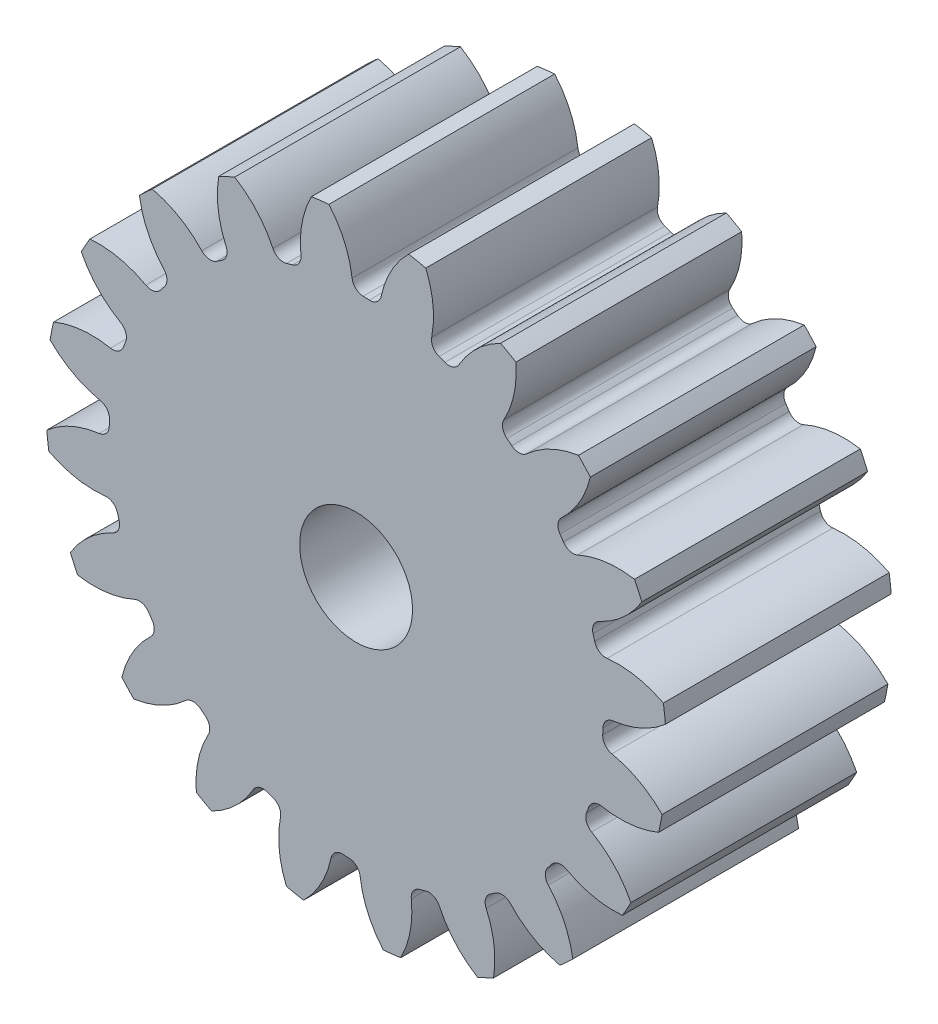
ISO-10303-21;
HEADER;
FILE_DESCRIPTION(('STEP AP214'),'2;1');
FILE_NAME('part.step','',(''),(''),'','','');
FILE_SCHEMA(('AUTOMOTIVE_DESIGN { 1 0 10303 214 1 1 1 1 }'));
ENDSEC;
DATA;
#1=APPLICATION_CONTEXT('core data for automotive mechanical design processes');
#2=APPLICATION_PROTOCOL_DEFINITION('international standard','automotive_design',2000,#1);
#3=PRODUCT_CONTEXT('',#1,'mechanical');
#4=PRODUCT('Part','Part','',(#3));
#5=PRODUCT_RELATED_PRODUCT_CATEGORY('part','',(#4));
#6=PRODUCT_DEFINITION_FORMATION('','',#4);
#7=PRODUCT_DEFINITION_CONTEXT('part definition',#1,'design');
#8=PRODUCT_DEFINITION('design','',#6,#7);
#9=PRODUCT_DEFINITION_SHAPE('','',#8);
#10=(LENGTH_UNIT() NAMED_UNIT(*) SI_UNIT(.MILLI.,.METRE.));
#11=(NAMED_UNIT(*) PLANE_ANGLE_UNIT() SI_UNIT($,.RADIAN.));
#12=(NAMED_UNIT(*) SI_UNIT($,.STERADIAN.) SOLID_ANGLE_UNIT());
#13=UNCERTAINTY_MEASURE_WITH_UNIT(LENGTH_MEASURE(1.E-05),#10,'distance_accuracy_value','');
#14=(GEOMETRIC_REPRESENTATION_CONTEXT(3) GLOBAL_UNCERTAINTY_ASSIGNED_CONTEXT((#13)) GLOBAL_UNIT_ASSIGNED_CONTEXT((#10,
#11,#12)) REPRESENTATION_CONTEXT('',''));
#15=CARTESIAN_POINT('',(0.,0.,0.));
#16=DIRECTION('',(0.,0.,1.));
#17=DIRECTION('',(1.,0.,0.));
#18=AXIS2_PLACEMENT_3D('',#15,#16,#17);
#19=CARTESIAN_POINT('',(0.,0.,101.6));
#20=DIRECTION('',(0.,0.,-1.));
#21=DIRECTION('',(-1.,0.,0.));
#22=AXIS2_PLACEMENT_3D('',#19,#20,#21);
#23=CYLINDRICAL_SURFACE('',#22,139.7);
#24=DIRECTION('',(0.,0.,-1.));
#25=VECTOR('',#24,1.);
#26=CARTESIAN_POINT('',(138.248492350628,20.0859244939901,50.8));
#27=LINE('',#26,#25);
#28=CARTESIAN_POINT('',(138.248492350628,20.0859244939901,101.6));
#29=VERTEX_POINT('',#28);
#30=CARTESIAN_POINT('',(138.248492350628,20.0859244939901,0.));
#31=VERTEX_POINT('',#30);
#32=EDGE_CURVE('E816',#29,#31,#27,.T.);
#33=ORIENTED_EDGE('',*,*,#32,.F.);
#34=CARTESIAN_POINT('',(0.,0.,101.6));
#35=DIRECTION('',(0.,0.,1.));
#36=DIRECTION('',(1.,0.,0.));
#37=AXIS2_PLACEMENT_3D('',#34,#35,#36);
#38=CIRCLE('',#37,139.7);
#39=CARTESIAN_POINT('',(139.162706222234,12.2405554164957,101.6));
#40=VERTEX_POINT('',#39);
#41=EDGE_CURVE('E1537',#40,#29,#38,.T.);
#42=ORIENTED_EDGE('',*,*,#41,.F.);
#43=DIRECTION('',(0.,0.,-1.));
#44=VECTOR('',#43,1.);
#45=CARTESIAN_POINT('',(139.162706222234,12.2405554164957,50.8));
#46=LINE('',#45,#44);
#47=CARTESIAN_POINT('',(139.162706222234,12.2405554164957,0.));
#48=VERTEX_POINT('',#47);
#49=EDGE_CURVE('E1531',#48,#40,#46,.F.);
#50=ORIENTED_EDGE('',*,*,#49,.F.);
#51=CARTESIAN_POINT('',(0.,0.,0.));
#52=DIRECTION('',(0.,0.,1.));
#53=DIRECTION('',(1.,0.,0.));
#54=AXIS2_PLACEMENT_3D('',#51,#52,#53);
#55=CIRCLE('',#54,139.7);
#56=EDGE_CURVE('E1542',#48,#31,#55,.T.);
#57=ORIENTED_EDGE('',*,*,#56,.T.);
#58=EDGE_LOOP('',(#33,#42,#50,#57));
#59=FACE_BOUND('',#58,.T.);
#60=ADVANCED_FACE('F33',(#59),#23,.T.);
#61=DIRECTION('',(0.,0.,-1.));
#62=VECTOR('',#61,1.);
#63=CARTESIAN_POINT('',(128.569058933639,54.6451011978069,50.8));
#64=LINE('',#63,#62);
#65=CARTESIAN_POINT('',(128.569058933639,54.6451011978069,0.));
#66=VERTEX_POINT('',#65);
#67=CARTESIAN_POINT('',(128.569058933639,54.6451011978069,101.6));
#68=VERTEX_POINT('',#67);
#69=EDGE_CURVE('E787',#66,#68,#64,.F.);
#70=ORIENTED_EDGE('',*,*,#69,.F.);
#71=CARTESIAN_POINT('',(125.275237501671,61.8239829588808,0.));
#72=VERTEX_POINT('',#71);
#73=EDGE_CURVE('E1545',#66,#72,#55,.T.);
#74=ORIENTED_EDGE('',*,*,#73,.T.);
#75=DIRECTION('',(0.,0.,-1.));
#76=VECTOR('',#75,1.);
#77=CARTESIAN_POINT('',(125.275237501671,61.8239829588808,50.8));
#78=LINE('',#77,#76);
#79=CARTESIAN_POINT('',(125.275237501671,61.8239829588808,101.6));
#80=VERTEX_POINT('',#79);
#81=EDGE_CURVE('E849',#80,#72,#78,.T.);
#82=ORIENTED_EDGE('',*,*,#81,.F.);
#83=EDGE_CURVE('E1540',#68,#80,#38,.T.);
#84=ORIENTED_EDGE('',*,*,#83,.F.);
#85=EDGE_LOOP('',(#70,#74,#82,#84));
#86=FACE_BOUND('',#85,.T.);
#87=ADVANCED_FACE('F1771',(#86),#23,.T.);
#88=CARTESIAN_POINT('',(0.,0.,101.6));
#89=DIRECTION('',(0.,0.,1.));
#90=DIRECTION('',(1.,0.,0.));
#91=AXIS2_PLACEMENT_3D('',#88,#89,#90);
#92=PLANE('',#91);
#93=CARTESIAN_POINT('',(0.,0.,101.599999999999));
#94=DIRECTION('',(0.,0.,1.));
#95=DIRECTION('',(1.,0.,0.));
#96=AXIS2_PLACEMENT_3D('',#93,#94,#95);
#97=CIRCLE('',#96,25.4);
#98=CARTESIAN_POINT('',(25.4,0.,101.599999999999));
#99=VERTEX_POINT('',#98);
#100=EDGE_CURVE('E804',#99,#99,#97,.T.);
#101=ORIENTED_EDGE('',*,*,#100,.F.);
#102=EDGE_LOOP('',(#101));
#103=FACE_BOUND('',#102,.T.);
#104=ORIENTED_EDGE('',*,*,#41,.T.);
#105=CARTESIAN_POINT('',(117.803559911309,-19.094153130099,101.6));
#106=DIRECTION('',(0.,0.,-1.));
#107=DIRECTION('',(0.951056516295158,0.309016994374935,0.));
#108=AXIS2_PLACEMENT_3D('',#105,#106,#107);
#109=CIRCLE('',#108,44.193593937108);
#110=CARTESIAN_POINT('',(112.935677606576,24.8305263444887,101.6));
#111=VERTEX_POINT('',#110);
#112=EDGE_CURVE('E796',#111,#29,#109,.T.);
#113=ORIENTED_EDGE('',*,*,#112,.F.);
#114=CARTESIAN_POINT('',(112.366328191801,29.9679740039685,101.6));
#115=DIRECTION('',(0.,0.,1.));
#116=DIRECTION('',(-0.951056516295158,-0.309016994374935,0.));
#117=AXIS2_PLACEMENT_3D('',#114,#115,#116);
#118=CIRCLE('',#117,5.16890000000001);
#119=CARTESIAN_POINT('',(107.371996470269,28.6359913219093,101.6));
#120=VERTEX_POINT('',#119);
#121=EDGE_CURVE('E794',#120,#111,#118,.T.);
#122=ORIENTED_EDGE('',*,*,#121,.F.);
#123=CARTESIAN_POINT('',(0.,0.,101.6));
#124=DIRECTION('',(0.,0.,-1.));
#125=DIRECTION('',(0.951056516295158,0.309016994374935,0.));
#126=AXIS2_PLACEMENT_3D('',#123,#124,#125);
#127=CIRCLE('',#126,111.125);
#128=CARTESIAN_POINT('',(106.625557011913,31.3010577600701,101.6));
#129=VERTEX_POINT('',#128);
#130=EDGE_CURVE('E779',#129,#120,#127,.T.);
#131=ORIENTED_EDGE('',*,*,#130,.F.);
#132=CARTESIAN_POINT('',(111.58516863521,32.7570041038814,101.6));
#133=DIRECTION('',(0.,0.,1.));
#134=DIRECTION('',(-0.951056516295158,-0.309016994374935,0.));
#135=AXIS2_PLACEMENT_3D('',#132,#133,#134);
#136=CIRCLE('',#135,5.16890000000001);
#137=CARTESIAN_POINT('',(109.403200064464,37.4427847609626,101.6));
#138=VERTEX_POINT('',#137);
#139=EDGE_CURVE('E771',#138,#129,#136,.T.);
#140=ORIENTED_EDGE('',*,*,#139,.F.);
#141=CARTESIAN_POINT('',(90.7475803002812,77.5057551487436,101.6));
#142=DIRECTION('',(0.,0.,-1.));
#143=DIRECTION('',(-0.951056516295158,-0.309016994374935,0.));
#144=AXIS2_PLACEMENT_3D('',#141,#142,#143);
#145=CIRCLE('',#144,44.193593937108);
#146=EDGE_CURVE('E801',#68,#138,#145,.T.);
#147=ORIENTED_EDGE('',*,*,#146,.F.);
#148=ORIENTED_EDGE('',*,*,#83,.T.);
#149=CARTESIAN_POINT('',(117.938261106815,18.2436832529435,101.6));
#150=DIRECTION('',(0.,0.,-1.));
#151=DIRECTION('',(0.809016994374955,0.587785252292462,0.));
#152=AXIS2_PLACEMENT_3D('',#149,#150,#151);
#153=CIRCLE('',#152,44.193593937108);
#154=CARTESIAN_POINT('',(99.7351574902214,58.5142775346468,101.6));
#155=VERTEX_POINT('',#154);
#156=EDGE_CURVE('E825',#155,#80,#153,.T.);
#157=ORIENTED_EDGE('',*,*,#156,.F.);
#158=CARTESIAN_POINT('',(97.606115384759,63.2243419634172,101.6));
#159=DIRECTION('',(0.,0.,1.));
#160=DIRECTION('',(-0.809016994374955,-0.587785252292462,0.));
#161=AXIS2_PLACEMENT_3D('',#158,#159,#160);
#162=CIRCLE('',#161,5.16890000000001);
#163=CARTESIAN_POINT('',(93.2678289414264,60.4142177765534,101.6));
#164=VERTEX_POINT('',#163);
#165=EDGE_CURVE('E823',#164,#155,#162,.T.);
#166=ORIENTED_EDGE('',*,*,#165,.F.);
#167=CARTESIAN_POINT('',(0.,0.,101.6));
#168=DIRECTION('',(0.,0.,-1.));
#169=DIRECTION('',(0.809016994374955,0.587785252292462,0.));
#170=AXIS2_PLACEMENT_3D('',#167,#168,#169);
#171=CIRCLE('',#170,111.125);
#172=CARTESIAN_POINT('',(91.734372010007,62.7181841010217,101.6));
#173=VERTEX_POINT('',#172);
#174=EDGE_CURVE('E820',#173,#164,#171,.T.);
#175=ORIENTED_EDGE('',*,*,#174,.F.);
#176=CARTESIAN_POINT('',(96.001330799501,65.6354756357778,101.6));
#177=DIRECTION('',(0.,0.,1.));
#178=DIRECTION('',(-0.809016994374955,-0.587785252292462,0.));
#179=AXIS2_PLACEMENT_3D('',#176,#177,#178);
#180=CIRCLE('',#179,5.16890000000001);
#181=CARTESIAN_POINT('',(92.4781695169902,69.4176524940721,101.6));
#182=VERTEX_POINT('',#181);
#183=EDGE_CURVE('E818',#182,#173,#180,.T.);
#184=ORIENTED_EDGE('',*,*,#183,.F.);
#185=CARTESIAN_POINT('',(62.3554820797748,101.754897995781,101.6));
#186=DIRECTION('',(0.,0.,-1.));
#187=DIRECTION('',(-0.809016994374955,-0.587785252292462,0.));
#188=AXIS2_PLACEMENT_3D('',#185,#186,#187);
#189=CIRCLE('',#188,44.193593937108);
#190=CARTESIAN_POINT('',(105.390176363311,91.7006037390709,101.6));
#191=VERTEX_POINT('',#190);
#192=EDGE_CURVE('E828',#191,#182,#189,.T.);
#193=ORIENTED_EDGE('',*,*,#192,.F.);
#194=CARTESIAN_POINT('',(100.039169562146,97.5102792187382,101.6));
#195=VERTEX_POINT('',#194);
#196=EDGE_CURVE('E1593',#191,#195,#38,.T.);
#197=ORIENTED_EDGE('',*,*,#196,.T.);
#198=CARTESIAN_POINT('',(106.528343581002,53.7957008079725,101.6));
#199=DIRECTION('',(0.,0.,-1.));
#200=DIRECTION('',(0.587785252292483,0.80901699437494,0.));
#201=AXIS2_PLACEMENT_3D('',#198,#199,#200);
#202=CIRCLE('',#201,44.193593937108);
#203=CARTESIAN_POINT('',(76.7718652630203,86.4702435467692,101.6));
#204=VERTEX_POINT('',#203);
#205=EDGE_CURVE('E860',#204,#195,#202,.T.);
#206=ORIENTED_EDGE('',*,*,#205,.F.);
#207=CARTESIAN_POINT('',(73.2915359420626,90.2918708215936,101.6));
#208=DIRECTION('',(0.,0.,1.));
#209=DIRECTION('',(-0.587785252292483,-0.80901699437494,0.));
#210=AXIS2_PLACEMENT_3D('',#207,#208,#209);
#211=CIRCLE('',#210,5.16890000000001);
#212=CARTESIAN_POINT('',(70.0339564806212,86.278679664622,101.6));
#213=VERTEX_POINT('',#212);
#214=EDGE_CURVE('E858',#213,#204,#211,.T.);
#215=ORIENTED_EDGE('',*,*,#214,.F.);
#216=CARTESIAN_POINT('',(0.,0.,101.6));
#217=DIRECTION('',(0.,0.,-1.));
#218=DIRECTION('',(0.587785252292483,0.80901699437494,0.));
#219=AXIS2_PLACEMENT_3D('',#216,#217,#218);
#220=CIRCLE('',#219,111.125);
#221=CARTESIAN_POINT('',(67.8635875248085,87.9960175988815,101.6));
#222=VERTEX_POINT('',#221);
#223=EDGE_CURVE('E855',#222,#213,#220,.T.);
#224=ORIENTED_EDGE('',*,*,#223,.F.);
#225=CARTESIAN_POINT('',(71.0202138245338,92.0890895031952,101.6));
#226=DIRECTION('',(0.,0.,1.));
#227=DIRECTION('',(-0.587785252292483,-0.80901699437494,0.));
#228=AXIS2_PLACEMENT_3D('',#225,#226,#227);
#229=CIRCLE('',#228,5.16890000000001);
#230=CARTESIAN_POINT('',(66.5007314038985,94.5974367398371,101.6));
#231=VERTEX_POINT('',#230);
#232=EDGE_CURVE('E853',#231,#222,#229,.T.);
#233=ORIENTED_EDGE('',*,*,#232,.F.);
#234=CARTESIAN_POINT('',(27.8595948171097,116.043562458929,101.6));
#235=DIRECTION('',(0.,0.,-1.));
#236=DIRECTION('',(-0.587785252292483,-0.80901699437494,0.));
#237=AXIS2_PLACEMENT_3D('',#234,#235,#236);
#238=CIRCLE('',#237,44.193593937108);
#239=CARTESIAN_POINT('',(71.894969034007,119.779812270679,101.6));
#240=VERTEX_POINT('',#239);
#241=EDGE_CURVE('E863',#240,#231,#238,.T.);
#242=ORIENTED_EDGE('',*,*,#241,.F.);
#243=CARTESIAN_POINT('',(65.0105706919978,123.651589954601,101.6));
#244=VERTEX_POINT('',#243);
#245=EDGE_CURVE('E1753',#240,#244,#38,.T.);
#246=ORIENTED_EDGE('',*,*,#245,.T.);
#247=CARTESIAN_POINT('',(84.6906895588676,84.0818203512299,101.6));
#248=DIRECTION('',(0.,0.,-1.));
#249=DIRECTION('',(0.309016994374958,0.95105651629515,0.));
#250=AXIS2_PLACEMENT_3D('',#247,#248,#249);
#251=CIRCLE('',#250,44.193593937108);
#252=CARTESIAN_POINT('',(46.2936079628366,105.961899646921,101.6));
#253=VERTEX_POINT('',#252);
#254=EDGE_CURVE('E898',#253,#244,#251,.T.);
#255=ORIENTED_EDGE('',*,*,#254,.F.);
#256=CARTESIAN_POINT('',(41.8026703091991,108.521002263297,101.6));
#257=DIRECTION('',(0.,0.,1.));
#258=DIRECTION('',(-0.309016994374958,-0.95105651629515,0.));
#259=AXIS2_PLACEMENT_3D('',#256,#257,#258);
#260=CIRCLE('',#259,5.16890000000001);
#261=CARTESIAN_POINT('',(39.9446724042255,103.697583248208,101.6));
#262=VERTEX_POINT('',#261);
#263=EDGE_CURVE('E896',#262,#253,#260,.T.);
#264=ORIENTED_EDGE('',*,*,#263,.F.);
#265=CARTESIAN_POINT('',(0.,0.,101.6));
#266=DIRECTION('',(0.,0.,-1.));
#267=DIRECTION('',(0.309016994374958,0.95105651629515,0.));
#268=AXIS2_PLACEMENT_3D('',#265,#266,#267);
#269=CIRCLE('',#268,111.125);
#270=CARTESIAN_POINT('',(37.3498422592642,104.660187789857,101.6));
#271=VERTEX_POINT('',#270);
#272=EDGE_CURVE('E893',#271,#262,#269,.T.);
#273=ORIENTED_EDGE('',*,*,#272,.F.);
#274=CARTESIAN_POINT('',(39.087143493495,109.528381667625,101.6));
#275=DIRECTION('',(0.,0.,1.));
#276=DIRECTION('',(-0.309016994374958,-0.95105651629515,0.));
#277=AXIS2_PLACEMENT_3D('',#274,#275,#276);
#278=CIRCLE('',#277,5.16890000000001);
#279=CARTESIAN_POINT('',(34.0137383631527,110.517364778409,101.6));
#280=VERTEX_POINT('',#279);
#281=EDGE_CURVE('E891',#280,#271,#278,.T.);
#282=ORIENTED_EDGE('',*,*,#281,.F.);
#283=CARTESIAN_POINT('',(-9.36338369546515,118.973074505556,101.6));
#284=DIRECTION('',(0.,0.,-1.));
#285=DIRECTION('',(-0.309016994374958,-0.95105651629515,0.));
#286=AXIS2_PLACEMENT_3D('',#283,#284,#285);
#287=CIRCLE('',#286,44.193593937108);
#288=CARTESIAN_POINT('',(31.3621812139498,136.134138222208,101.6));
#289=VERTEX_POINT('',#288);
#290=EDGE_CURVE('E901',#289,#280,#287,.T.);
#291=ORIENTED_EDGE('',*,*,#290,.F.);
#292=CARTESIAN_POINT('',(23.6182842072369,137.689021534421,101.6));
#293=VERTEX_POINT('',#292);
#294=EDGE_CURVE('E1749',#289,#293,#38,.T.);
#295=ORIENTED_EDGE('',*,*,#294,.T.);
#296=CARTESIAN_POINT('',(54.5629207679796,106.137425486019,101.6));
#297=DIRECTION('',(0.,0.,-1.));
#298=DIRECTION('',(0.,1.,0.));
#299=AXIS2_PLACEMENT_3D('',#296,#297,#298);
#300=CIRCLE('',#299,44.193593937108);
#301=CARTESIAN_POINT('',(11.2838097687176,115.081266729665,101.6));
#302=VERTEX_POINT('',#301);
#303=EDGE_CURVE('E936',#302,#293,#300,.T.);
#304=ORIENTED_EDGE('',*,*,#303,.F.);
#305=CARTESIAN_POINT('',(6.22186805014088,116.127341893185,101.6));
#306=DIRECTION('',(0.,0.,1.));
#307=DIRECTION('',(0.,-1.,0.));
#308=AXIS2_PLACEMENT_3D('',#305,#306,#307);
#309=CIRCLE('',#308,5.16890000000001);
#310=CARTESIAN_POINT('',(5.94532548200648,110.965844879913,101.6));
#311=VERTEX_POINT('',#310);
#312=EDGE_CURVE('E934',#311,#302,#309,.T.);
#313=ORIENTED_EDGE('',*,*,#312,.F.);
#314=CARTESIAN_POINT('',(0.,0.,101.6));
#315=DIRECTION('',(0.,0.,-1.));
#316=DIRECTION('',(0.,1.,0.));
#317=AXIS2_PLACEMENT_3D('',#314,#315,#316);
#318=CIRCLE('',#317,111.125);
#319=CARTESIAN_POINT('',(3.18003420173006,111.079489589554,101.6));
#320=VERTEX_POINT('',#319);
#321=EDGE_CURVE('E931',#320,#311,#318,.T.);
#322=ORIENTED_EDGE('',*,*,#321,.F.);
#323=CARTESIAN_POINT('',(3.32795122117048,116.24627270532,101.6));
#324=DIRECTION('',(0.,0.,1.));
#325=DIRECTION('',(0.,-1.,0.));
#326=AXIS2_PLACEMENT_3D('',#323,#324,#325);
#327=CIRCLE('',#326,5.16890000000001);
#328=CARTESIAN_POINT('',(-1.80275637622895,115.619083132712,101.6));
#329=VERTEX_POINT('',#328);
#330=EDGE_CURVE('E929',#329,#320,#327,.T.);
#331=ORIENTED_EDGE('',*,*,#330,.F.);
#332=CARTESIAN_POINT('',(-45.6698089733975,110.256673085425,101.6));
#333=DIRECTION('',(0.,0.,-1.));
#334=DIRECTION('',(0.,-1.,0.));
#335=AXIS2_PLACEMENT_3D('',#332,#333,#334);
#336=CIRCLE('',#335,44.193593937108);
#337=CARTESIAN_POINT('',(-12.2405554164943,139.162706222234,101.6));
#338=VERTEX_POINT('',#337);
#339=EDGE_CURVE('E939',#338,#329,#336,.T.);
#340=ORIENTED_EDGE('',*,*,#339,.F.);
#341=CARTESIAN_POINT('',(-20.0859244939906,138.248492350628,101.6));
#342=VERTEX_POINT('',#341);
#343=EDGE_CURVE('E1745',#338,#342,#38,.T.);
#344=ORIENTED_EDGE('',*,*,#343,.T.);
#345=CARTESIAN_POINT('',(19.0941531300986,117.803559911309,101.6));
#346=DIRECTION('',(0.,0.,-1.));
#347=DIRECTION('',(-0.309016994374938,0.951056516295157,0.));
#348=AXIS2_PLACEMENT_3D('',#345,#346,#347);
#349=CIRCLE('',#348,44.193593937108);
#350=CARTESIAN_POINT('',(-24.8305263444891,112.935677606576,101.6));
#351=VERTEX_POINT('',#350);
#352=EDGE_CURVE('E974',#351,#342,#349,.T.);
#353=ORIENTED_EDGE('',*,*,#352,.F.);
#354=CARTESIAN_POINT('',(-29.9679740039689,112.366328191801,101.6));
#355=DIRECTION('',(0.,0.,1.));
#356=DIRECTION('',(0.309016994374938,-0.951056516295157,0.));
#357=AXIS2_PLACEMENT_3D('',#354,#355,#356);
#358=CIRCLE('',#357,5.16890000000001);
#359=CARTESIAN_POINT('',(-28.6359913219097,107.371996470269,101.6));
#360=VERTEX_POINT('',#359);
#361=EDGE_CURVE('E972',#360,#351,#358,.T.);
#362=ORIENTED_EDGE('',*,*,#361,.F.);
#363=CARTESIAN_POINT('',(0.,0.,101.6));
#364=DIRECTION('',(0.,0.,-1.));
#365=DIRECTION('',(-0.309016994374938,0.951056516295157,0.));
#366=AXIS2_PLACEMENT_3D('',#363,#364,#365);
#367=CIRCLE('',#366,111.125);
#368=CARTESIAN_POINT('',(-31.3010577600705,106.625557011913,101.6));
#369=VERTEX_POINT('',#368);
#370=EDGE_CURVE('E969',#369,#360,#367,.T.);
#371=ORIENTED_EDGE('',*,*,#370,.F.);
#372=CARTESIAN_POINT('',(-32.7570041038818,111.58516863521,101.6));
#373=DIRECTION('',(0.,0.,1.));
#374=DIRECTION('',(0.309016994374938,-0.951056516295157,0.));
#375=AXIS2_PLACEMENT_3D('',#372,#373,#374);
#376=CIRCLE('',#375,5.16890000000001);
#377=CARTESIAN_POINT('',(-37.442784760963,109.403200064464,101.6));
#378=VERTEX_POINT('',#377);
#379=EDGE_CURVE('E967',#378,#369,#376,.T.);
#380=ORIENTED_EDGE('',*,*,#379,.F.);
#381=CARTESIAN_POINT('',(-77.505755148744,90.7475803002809,101.6));
#382=DIRECTION('',(0.,0.,-1.));
#383=DIRECTION('',(0.309016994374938,-0.951056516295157,0.));
#384=AXIS2_PLACEMENT_3D('',#381,#382,#383);
#385=CIRCLE('',#384,44.193593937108);
#386=CARTESIAN_POINT('',(-54.6451011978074,128.569058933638,101.6));
#387=VERTEX_POINT('',#386);
#388=EDGE_CURVE('E977',#387,#378,#385,.T.);
#389=ORIENTED_EDGE('',*,*,#388,.F.);
#390=CARTESIAN_POINT('',(-61.8239829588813,125.275237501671,101.6));
#391=VERTEX_POINT('',#390);
#392=EDGE_CURVE('E1741',#387,#391,#38,.T.);
#393=ORIENTED_EDGE('',*,*,#392,.T.);
#394=CARTESIAN_POINT('',(-18.243683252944,117.938261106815,101.6));
#395=DIRECTION('',(0.,0.,-1.));
#396=DIRECTION('',(-0.587785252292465,0.809016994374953,0.));
#397=AXIS2_PLACEMENT_3D('',#394,#395,#396);
#398=CIRCLE('',#397,44.193593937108);
#399=CARTESIAN_POINT('',(-58.5142775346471,99.7351574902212,101.6));
#400=VERTEX_POINT('',#399);
#401=EDGE_CURVE('E1012',#400,#391,#398,.T.);
#402=ORIENTED_EDGE('',*,*,#401,.F.);
#403=CARTESIAN_POINT('',(-63.2243419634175,97.6061153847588,101.6));
#404=DIRECTION('',(0.,0.,1.));
#405=DIRECTION('',(0.587785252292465,-0.809016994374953,0.));
#406=AXIS2_PLACEMENT_3D('',#403,#404,#405);
#407=CIRCLE('',#406,5.16890000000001);
#408=CARTESIAN_POINT('',(-60.4142177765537,93.2678289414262,101.6));
#409=VERTEX_POINT('',#408);
#410=EDGE_CURVE('E1010',#409,#400,#407,.T.);
#411=ORIENTED_EDGE('',*,*,#410,.F.);
#412=CARTESIAN_POINT('',(0.,0.,101.6));
#413=DIRECTION('',(0.,0.,-1.));
#414=DIRECTION('',(-0.587785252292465,0.809016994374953,0.));
#415=AXIS2_PLACEMENT_3D('',#412,#413,#414);
#416=CIRCLE('',#415,111.125);
#417=CARTESIAN_POINT('',(-62.718184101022,91.7343720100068,101.6));
#418=VERTEX_POINT('',#417);
#419=EDGE_CURVE('E1007',#418,#409,#416,.T.);
#420=ORIENTED_EDGE('',*,*,#419,.F.);
#421=CARTESIAN_POINT('',(-65.6354756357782,96.0013307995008,101.6));
#422=DIRECTION('',(0.,0.,1.));
#423=DIRECTION('',(0.587785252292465,-0.809016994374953,0.));
#424=AXIS2_PLACEMENT_3D('',#421,#422,#423);
#425=CIRCLE('',#424,5.16890000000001);
#426=CARTESIAN_POINT('',(-69.4176524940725,92.47816951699,101.6));
#427=VERTEX_POINT('',#426);
#428=EDGE_CURVE('E1005',#427,#418,#425,.T.);
#429=ORIENTED_EDGE('',*,*,#428,.F.);
#430=CARTESIAN_POINT('',(-101.754897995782,62.3554820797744,101.6));
#431=DIRECTION('',(0.,0.,-1.));
#432=DIRECTION('',(0.587785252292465,-0.809016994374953,0.));
#433=AXIS2_PLACEMENT_3D('',#430,#431,#432);
#434=CIRCLE('',#433,44.193593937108);
#435=CARTESIAN_POINT('',(-91.7006037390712,105.390176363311,101.6));
#436=VERTEX_POINT('',#435);
#437=EDGE_CURVE('E1015',#436,#427,#434,.T.);
#438=ORIENTED_EDGE('',*,*,#437,.F.);
#439=CARTESIAN_POINT('',(-97.5102792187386,100.039169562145,101.6));
#440=VERTEX_POINT('',#439);
#441=EDGE_CURVE('E1737',#436,#440,#38,.T.);
#442=ORIENTED_EDGE('',*,*,#441,.T.);
#443=CARTESIAN_POINT('',(-53.7957008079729,106.528343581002,101.6));
#444=DIRECTION('',(0.,0.,-1.));
#445=DIRECTION('',(-0.809016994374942,0.58778525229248,0.));
#446=AXIS2_PLACEMENT_3D('',#443,#444,#445);
#447=CIRCLE('',#446,44.193593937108);
#448=CARTESIAN_POINT('',(-86.4702435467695,76.77186526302,101.6));
#449=VERTEX_POINT('',#448);
#450=EDGE_CURVE('E1050',#449,#440,#447,.T.);
#451=ORIENTED_EDGE('',*,*,#450,.F.);
#452=CARTESIAN_POINT('',(-90.2918708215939,73.2915359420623,101.6));
#453=DIRECTION('',(0.,0.,1.));
#454=DIRECTION('',(0.809016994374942,-0.58778525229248,0.));
#455=AXIS2_PLACEMENT_3D('',#452,#453,#454);
#456=CIRCLE('',#455,5.16890000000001);
#457=CARTESIAN_POINT('',(-86.2786796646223,70.0339564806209,101.6));
#458=VERTEX_POINT('',#457);
#459=EDGE_CURVE('E1048',#458,#449,#456,.T.);
#460=ORIENTED_EDGE('',*,*,#459,.F.);
#461=CARTESIAN_POINT('',(0.,0.,101.6));
#462=DIRECTION('',(0.,0.,-1.));
#463=DIRECTION('',(-0.809016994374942,0.58778525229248,0.));
#464=AXIS2_PLACEMENT_3D('',#461,#462,#463);
#465=CIRCLE('',#464,111.125);
#466=CARTESIAN_POINT('',(-87.9960175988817,67.8635875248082,101.6));
#467=VERTEX_POINT('',#466);
#468=EDGE_CURVE('E1045',#467,#458,#465,.T.);
#469=ORIENTED_EDGE('',*,*,#468,.F.);
#470=CARTESIAN_POINT('',(-92.0890895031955,71.0202138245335,101.6));
#471=DIRECTION('',(0.,0.,1.));
#472=DIRECTION('',(0.809016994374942,-0.58778525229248,0.));
#473=AXIS2_PLACEMENT_3D('',#470,#471,#472);
#474=CIRCLE('',#473,5.16890000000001);
#475=CARTESIAN_POINT('',(-94.5974367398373,66.5007314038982,101.6));
#476=VERTEX_POINT('',#475);
#477=EDGE_CURVE('E1043',#476,#467,#474,.T.);
#478=ORIENTED_EDGE('',*,*,#477,.F.);
#479=CARTESIAN_POINT('',(-116.04356245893,27.8595948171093,101.6));
#480=DIRECTION('',(0.,0.,-1.));
#481=DIRECTION('',(0.809016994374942,-0.58778525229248,0.));
#482=AXIS2_PLACEMENT_3D('',#479,#480,#481);
#483=CIRCLE('',#482,44.193593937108);
#484=CARTESIAN_POINT('',(-119.77981227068,71.8949690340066,101.6));
#485=VERTEX_POINT('',#484);
#486=EDGE_CURVE('E1053',#485,#476,#483,.T.);
#487=ORIENTED_EDGE('',*,*,#486,.F.);
#488=CARTESIAN_POINT('',(-123.651589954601,65.0105706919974,101.6));
#489=VERTEX_POINT('',#488);
#490=EDGE_CURVE('E1733',#485,#489,#38,.T.);
#491=ORIENTED_EDGE('',*,*,#490,.T.);
#492=CARTESIAN_POINT('',(-84.0818203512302,84.6906895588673,101.6));
#493=DIRECTION('',(0.,0.,-1.));
#494=DIRECTION('',(-0.951056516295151,0.309016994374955,0.));
#495=AXIS2_PLACEMENT_3D('',#492,#493,#494);
#496=CIRCLE('',#495,44.193593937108);
#497=CARTESIAN_POINT('',(-105.961899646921,46.2936079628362,101.6));
#498=VERTEX_POINT('',#497);
#499=EDGE_CURVE('E1088',#498,#489,#496,.T.);
#500=ORIENTED_EDGE('',*,*,#499,.F.);
#501=CARTESIAN_POINT('',(-108.521002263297,41.8026703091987,101.6));
#502=DIRECTION('',(0.,0.,1.));
#503=DIRECTION('',(0.951056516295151,-0.309016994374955,0.));
#504=AXIS2_PLACEMENT_3D('',#501,#502,#503);
#505=CIRCLE('',#504,5.16890000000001);
#506=CARTESIAN_POINT('',(-103.697583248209,39.9446724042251,101.6));
#507=VERTEX_POINT('',#506);
#508=EDGE_CURVE('E1086',#507,#498,#505,.T.);
#509=ORIENTED_EDGE('',*,*,#508,.F.);
#510=CARTESIAN_POINT('',(0.,0.,101.6));
#511=DIRECTION('',(0.,0.,-1.));
#512=DIRECTION('',(-0.951056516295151,0.309016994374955,0.));
#513=AXIS2_PLACEMENT_3D('',#510,#511,#512);
#514=CIRCLE('',#513,111.125);
#515=CARTESIAN_POINT('',(-104.660187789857,37.3498422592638,101.6));
#516=VERTEX_POINT('',#515);
#517=EDGE_CURVE('E1083',#516,#507,#514,.T.);
#518=ORIENTED_EDGE('',*,*,#517,.F.);
#519=CARTESIAN_POINT('',(-109.528381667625,39.0871434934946,101.6));
#520=DIRECTION('',(0.,0.,1.));
#521=DIRECTION('',(0.951056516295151,-0.309016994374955,0.));
#522=AXIS2_PLACEMENT_3D('',#519,#520,#521);
#523=CIRCLE('',#522,5.16890000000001);
#524=CARTESIAN_POINT('',(-110.517364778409,34.0137383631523,101.6));
#525=VERTEX_POINT('',#524);
#526=EDGE_CURVE('E1081',#525,#516,#523,.T.);
#527=ORIENTED_EDGE('',*,*,#526,.F.);
#528=CARTESIAN_POINT('',(-118.973074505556,-9.36338369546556,101.6));
#529=DIRECTION('',(0.,0.,-1.));
#530=DIRECTION('',(0.951056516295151,-0.309016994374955,0.));
#531=AXIS2_PLACEMENT_3D('',#528,#529,#530);
#532=CIRCLE('',#531,44.193593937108);
#533=CARTESIAN_POINT('',(-136.134138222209,31.3621812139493,101.6));
#534=VERTEX_POINT('',#533);
#535=EDGE_CURVE('E1091',#534,#525,#532,.T.);
#536=ORIENTED_EDGE('',*,*,#535,.F.);
#537=CARTESIAN_POINT('',(-137.689021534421,23.6182842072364,101.6));
#538=VERTEX_POINT('',#537);
#539=EDGE_CURVE('E1729',#534,#538,#38,.T.);
#540=ORIENTED_EDGE('',*,*,#539,.T.);
#541=CARTESIAN_POINT('',(-106.137425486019,54.5629207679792,101.6));
#542=DIRECTION('',(0.,0.,-1.));
#543=DIRECTION('',(-1.,0.,0.));
#544=AXIS2_PLACEMENT_3D('',#541,#542,#543);
#545=CIRCLE('',#544,44.193593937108);
#546=CARTESIAN_POINT('',(-115.081266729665,11.2838097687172,101.6));
#547=VERTEX_POINT('',#546);
#548=EDGE_CURVE('E1126',#547,#538,#545,.T.);
#549=ORIENTED_EDGE('',*,*,#548,.F.);
#550=CARTESIAN_POINT('',(-116.127341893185,6.22186805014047,101.6));
#551=DIRECTION('',(0.,0.,1.));
#552=DIRECTION('',(1.,0.,0.));
#553=AXIS2_PLACEMENT_3D('',#550,#551,#552);
#554=CIRCLE('',#553,5.16890000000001);
#555=CARTESIAN_POINT('',(-110.965844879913,5.9453254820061,101.6));
#556=VERTEX_POINT('',#555);
#557=EDGE_CURVE('E1124',#556,#547,#554,.T.);
#558=ORIENTED_EDGE('',*,*,#557,.F.);
#559=CARTESIAN_POINT('',(0.,0.,101.6));
#560=DIRECTION('',(0.,0.,-1.));
#561=DIRECTION('',(-1.,0.,0.));
#562=AXIS2_PLACEMENT_3D('',#559,#560,#561);
#563=CIRCLE('',#562,111.125);
#564=CARTESIAN_POINT('',(-111.079489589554,3.18003420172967,101.6));
#565=VERTEX_POINT('',#564);
#566=EDGE_CURVE('E1121',#565,#556,#563,.T.);
#567=ORIENTED_EDGE('',*,*,#566,.F.);
#568=CARTESIAN_POINT('',(-116.24627270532,3.32795122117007,101.6));
#569=DIRECTION('',(0.,0.,1.));
#570=DIRECTION('',(1.,0.,0.));
#571=AXIS2_PLACEMENT_3D('',#568,#569,#570);
#572=CIRCLE('',#571,5.16890000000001);
#573=CARTESIAN_POINT('',(-115.619083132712,-1.80275637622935,101.6));
#574=VERTEX_POINT('',#573);
#575=EDGE_CURVE('E1119',#574,#565,#572,.T.);
#576=ORIENTED_EDGE('',*,*,#575,.F.);
#577=CARTESIAN_POINT('',(-110.256673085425,-45.6698089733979,101.6));
#578=DIRECTION('',(0.,0.,-1.));
#579=DIRECTION('',(1.,0.,0.));
#580=AXIS2_PLACEMENT_3D('',#577,#578,#579);
#581=CIRCLE('',#580,44.193593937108);
#582=CARTESIAN_POINT('',(-139.162706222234,-12.2405554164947,101.6));
#583=VERTEX_POINT('',#582);
#584=EDGE_CURVE('E1129',#583,#574,#581,.T.);
#585=ORIENTED_EDGE('',*,*,#584,.F.);
#586=CARTESIAN_POINT('',(-138.248492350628,-20.085924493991,101.6));
#587=VERTEX_POINT('',#586);
#588=EDGE_CURVE('E1725',#583,#587,#38,.T.);
#589=ORIENTED_EDGE('',*,*,#588,.T.);
#590=CARTESIAN_POINT('',(-117.803559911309,19.0941531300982,101.6));
#591=DIRECTION('',(0.,0.,-1.));
#592=DIRECTION('',(-0.951056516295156,-0.309016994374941,0.));
#593=AXIS2_PLACEMENT_3D('',#590,#591,#592);
#594=CIRCLE('',#593,44.193593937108);
#595=CARTESIAN_POINT('',(-112.935677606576,-24.8305263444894,101.6));
#596=VERTEX_POINT('',#595);
#597=EDGE_CURVE('E1164',#596,#587,#594,.T.);
#598=ORIENTED_EDGE('',*,*,#597,.F.);
#599=CARTESIAN_POINT('',(-112.366328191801,-29.9679740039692,101.6));
#600=DIRECTION('',(0.,0.,1.));
#601=DIRECTION('',(0.951056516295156,0.309016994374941,0.));
#602=AXIS2_PLACEMENT_3D('',#599,#600,#601);
#603=CIRCLE('',#602,5.16890000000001);
#604=CARTESIAN_POINT('',(-107.371996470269,-28.63599132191,101.6));
#605=VERTEX_POINT('',#604);
#606=EDGE_CURVE('E1162',#605,#596,#603,.T.);
#607=ORIENTED_EDGE('',*,*,#606,.F.);
#608=CARTESIAN_POINT('',(0.,0.,101.6));
#609=DIRECTION('',(0.,0.,-1.));
#610=DIRECTION('',(-0.951056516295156,-0.309016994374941,0.));
#611=AXIS2_PLACEMENT_3D('',#608,#609,#610);
#612=CIRCLE('',#611,111.125);
#613=CARTESIAN_POINT('',(-106.625557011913,-31.3010577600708,101.6));
#614=VERTEX_POINT('',#613);
#615=EDGE_CURVE('E1159',#614,#605,#612,.T.);
#616=ORIENTED_EDGE('',*,*,#615,.F.);
#617=CARTESIAN_POINT('',(-111.58516863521,-32.7570041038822,101.6));
#618=DIRECTION('',(0.,0.,1.));
#619=DIRECTION('',(0.951056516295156,0.309016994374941,0.));
#620=AXIS2_PLACEMENT_3D('',#617,#618,#619);
#621=CIRCLE('',#620,5.16890000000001);
#622=CARTESIAN_POINT('',(-109.403200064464,-37.4427847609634,101.6));
#623=VERTEX_POINT('',#622);
#624=EDGE_CURVE('E1157',#623,#614,#621,.T.);
#625=ORIENTED_EDGE('',*,*,#624,.F.);
#626=CARTESIAN_POINT('',(-90.7475803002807,-77.5057551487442,101.6));
#627=DIRECTION('',(0.,0.,-1.));
#628=DIRECTION('',(0.951056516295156,0.309016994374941,0.));
#629=AXIS2_PLACEMENT_3D('',#626,#627,#628);
#630=CIRCLE('',#629,44.193593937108);
#631=CARTESIAN_POINT('',(-128.569058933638,-54.6451011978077,101.6));
#632=VERTEX_POINT('',#631);
#633=EDGE_CURVE('E1167',#632,#623,#630,.T.);
#634=ORIENTED_EDGE('',*,*,#633,.F.);
#635=CARTESIAN_POINT('',(-125.27523750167,-61.8239829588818,101.6));
#636=VERTEX_POINT('',#635);
#637=EDGE_CURVE('E1721',#632,#636,#38,.T.);
#638=ORIENTED_EDGE('',*,*,#637,.T.);
#639=CARTESIAN_POINT('',(-117.938261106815,-18.2436832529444,101.6));
#640=DIRECTION('',(0.,0.,-1.));
#641=DIRECTION('',(-0.809016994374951,-0.587785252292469,0.));
#642=AXIS2_PLACEMENT_3D('',#639,#640,#641);
#643=CIRCLE('',#642,44.193593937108);
#644=CARTESIAN_POINT('',(-99.735157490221,-58.5142775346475,101.6));
#645=VERTEX_POINT('',#644);
#646=EDGE_CURVE('E1202',#645,#636,#643,.T.);
#647=ORIENTED_EDGE('',*,*,#646,.F.);
#648=CARTESIAN_POINT('',(-97.6061153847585,-63.2243419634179,101.6));
#649=DIRECTION('',(0.,0.,1.));
#650=DIRECTION('',(0.809016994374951,0.587785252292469,0.));
#651=AXIS2_PLACEMENT_3D('',#648,#649,#650);
#652=CIRCLE('',#651,5.16890000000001);
#653=CARTESIAN_POINT('',(-93.267828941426,-60.4142177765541,101.6));
#654=VERTEX_POINT('',#653);
#655=EDGE_CURVE('E1200',#654,#645,#652,.T.);
#656=ORIENTED_EDGE('',*,*,#655,.F.);
#657=CARTESIAN_POINT('',(0.,0.,101.6));
#658=DIRECTION('',(0.,0.,-1.));
#659=DIRECTION('',(-0.809016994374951,-0.587785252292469,0.));
#660=AXIS2_PLACEMENT_3D('',#657,#658,#659);
#661=CIRCLE('',#660,111.125);
#662=CARTESIAN_POINT('',(-91.7343720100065,-62.7181841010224,101.6));
#663=VERTEX_POINT('',#662);
#664=EDGE_CURVE('E1197',#663,#654,#661,.T.);
#665=ORIENTED_EDGE('',*,*,#664,.F.);
#666=CARTESIAN_POINT('',(-96.0013307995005,-65.6354756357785,101.6));
#667=DIRECTION('',(0.,0.,1.));
#668=DIRECTION('',(0.809016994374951,0.587785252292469,0.));
#669=AXIS2_PLACEMENT_3D('',#666,#667,#668);
#670=CIRCLE('',#669,5.16890000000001);
#671=CARTESIAN_POINT('',(-92.4781695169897,-69.4176524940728,101.6));
#672=VERTEX_POINT('',#671);
#673=EDGE_CURVE('E1195',#672,#663,#670,.T.);
#674=ORIENTED_EDGE('',*,*,#673,.F.);
#675=CARTESIAN_POINT('',(-62.355482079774,-101.754897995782,101.6));
#676=DIRECTION('',(0.,0.,-1.));
#677=DIRECTION('',(0.809016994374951,0.587785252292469,0.));
#678=AXIS2_PLACEMENT_3D('',#675,#676,#677);
#679=CIRCLE('',#678,44.193593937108);
#680=CARTESIAN_POINT('',(-105.390176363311,-91.7006037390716,101.6));
#681=VERTEX_POINT('',#680);
#682=EDGE_CURVE('E1205',#681,#672,#679,.T.);
#683=ORIENTED_EDGE('',*,*,#682,.F.);
#684=CARTESIAN_POINT('',(-100.039169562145,-97.5102792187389,101.6));
#685=VERTEX_POINT('',#684);
#686=EDGE_CURVE('E1717',#681,#685,#38,.T.);
#687=ORIENTED_EDGE('',*,*,#686,.T.);
#688=CARTESIAN_POINT('',(-106.528343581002,-53.7957008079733,101.6));
#689=DIRECTION('',(0.,0.,-1.));
#690=DIRECTION('',(-0.587785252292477,-0.809016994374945,0.));
#691=AXIS2_PLACEMENT_3D('',#688,#689,#690);
#692=CIRCLE('',#691,44.193593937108);
#693=CARTESIAN_POINT('',(-76.7718652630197,-86.4702435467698,101.6));
#694=VERTEX_POINT('',#693);
#695=EDGE_CURVE('E1240',#694,#685,#692,.T.);
#696=ORIENTED_EDGE('',*,*,#695,.F.);
#697=CARTESIAN_POINT('',(-73.2915359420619,-90.2918708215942,101.6));
#698=DIRECTION('',(0.,0.,1.));
#699=DIRECTION('',(0.587785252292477,0.809016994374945,0.));
#700=AXIS2_PLACEMENT_3D('',#697,#698,#699);
#701=CIRCLE('',#700,5.16890000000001);
#702=CARTESIAN_POINT('',(-70.0339564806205,-86.2786796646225,101.6));
#703=VERTEX_POINT('',#702);
#704=EDGE_CURVE('E1238',#703,#694,#701,.T.);
#705=ORIENTED_EDGE('',*,*,#704,.F.);
#706=CARTESIAN_POINT('',(0.,0.,101.6));
#707=DIRECTION('',(0.,0.,-1.));
#708=DIRECTION('',(-0.587785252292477,-0.809016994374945,0.));
#709=AXIS2_PLACEMENT_3D('',#706,#707,#708);
#710=CIRCLE('',#709,111.125);
#711=CARTESIAN_POINT('',(-67.8635875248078,-87.996017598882,101.6));
#712=VERTEX_POINT('',#711);
#713=EDGE_CURVE('E1235',#712,#703,#710,.T.);
#714=ORIENTED_EDGE('',*,*,#713,.F.);
#715=CARTESIAN_POINT('',(-71.0202138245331,-92.0890895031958,101.6));
#716=DIRECTION('',(0.,0.,1.));
#717=DIRECTION('',(0.587785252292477,0.809016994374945,0.));
#718=AXIS2_PLACEMENT_3D('',#715,#716,#717);
#719=CIRCLE('',#718,5.16890000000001);
#720=CARTESIAN_POINT('',(-66.5007314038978,-94.5974367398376,101.6));
#721=VERTEX_POINT('',#720);
#722=EDGE_CURVE('E1233',#721,#712,#719,.T.);
#723=ORIENTED_EDGE('',*,*,#722,.F.);
#724=CARTESIAN_POINT('',(-27.8595948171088,-116.04356245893,101.6));
#725=DIRECTION('',(0.,0.,-1.));
#726=DIRECTION('',(0.587785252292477,0.809016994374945,0.));
#727=AXIS2_PLACEMENT_3D('',#724,#725,#726);
#728=CIRCLE('',#727,44.193593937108);
#729=CARTESIAN_POINT('',(-71.8949690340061,-119.77981227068,101.6));
#730=VERTEX_POINT('',#729);
#731=EDGE_CURVE('E1243',#730,#721,#728,.T.);
#732=ORIENTED_EDGE('',*,*,#731,.F.);
#733=CARTESIAN_POINT('',(-65.0105706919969,-123.651589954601,101.6));
#734=VERTEX_POINT('',#733);
#735=EDGE_CURVE('E1713',#730,#734,#38,.T.);
#736=ORIENTED_EDGE('',*,*,#735,.T.);
#737=CARTESIAN_POINT('',(-84.6906895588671,-84.0818203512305,101.6));
#738=DIRECTION('',(0.,0.,-1.));
#739=DIRECTION('',(-0.309016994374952,-0.951056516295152,0.));
#740=AXIS2_PLACEMENT_3D('',#737,#738,#739);
#741=CIRCLE('',#740,44.193593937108);
#742=CARTESIAN_POINT('',(-46.2936079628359,-105.961899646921,101.6));
#743=VERTEX_POINT('',#742);
#744=EDGE_CURVE('E1278',#743,#734,#741,.T.);
#745=ORIENTED_EDGE('',*,*,#744,.F.);
#746=CARTESIAN_POINT('',(-41.8026703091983,-108.521002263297,101.6));
#747=DIRECTION('',(0.,0.,1.));
#748=DIRECTION('',(0.309016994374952,0.951056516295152,0.));
#749=AXIS2_PLACEMENT_3D('',#746,#747,#748);
#750=CIRCLE('',#749,5.16890000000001);
#751=CARTESIAN_POINT('',(-39.9446724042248,-103.697583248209,101.6));
#752=VERTEX_POINT('',#751);
#753=EDGE_CURVE('E1276',#752,#743,#750,.T.);
#754=ORIENTED_EDGE('',*,*,#753,.F.);
#755=CARTESIAN_POINT('',(0.,0.,101.6));
#756=DIRECTION('',(0.,0.,-1.));
#757=DIRECTION('',(-0.309016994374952,-0.951056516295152,0.));
#758=AXIS2_PLACEMENT_3D('',#755,#756,#757);
#759=CIRCLE('',#758,111.125);
#760=CARTESIAN_POINT('',(-37.3498422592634,-104.660187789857,101.6));
#761=VERTEX_POINT('',#760);
#762=EDGE_CURVE('E1273',#761,#752,#759,.T.);
#763=ORIENTED_EDGE('',*,*,#762,.F.);
#764=CARTESIAN_POINT('',(-39.0871434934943,-109.528381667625,101.6));
#765=DIRECTION('',(0.,0.,1.));
#766=DIRECTION('',(0.309016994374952,0.951056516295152,0.));
#767=AXIS2_PLACEMENT_3D('',#764,#765,#766);
#768=CIRCLE('',#767,5.16890000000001);
#769=CARTESIAN_POINT('',(-34.0137383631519,-110.517364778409,101.6));
#770=VERTEX_POINT('',#769);
#771=EDGE_CURVE('E1271',#770,#761,#768,.T.);
#772=ORIENTED_EDGE('',*,*,#771,.F.);
#773=CARTESIAN_POINT('',(9.36338369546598,-118.973074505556,101.6));
#774=DIRECTION('',(0.,0.,-1.));
#775=DIRECTION('',(0.309016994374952,0.951056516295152,0.));
#776=AXIS2_PLACEMENT_3D('',#773,#774,#775);
#777=CIRCLE('',#776,44.193593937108);
#778=CARTESIAN_POINT('',(-31.3621812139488,-136.134138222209,101.6));
#779=VERTEX_POINT('',#778);
#780=EDGE_CURVE('E1281',#779,#770,#777,.T.);
#781=ORIENTED_EDGE('',*,*,#780,.F.);
#782=CARTESIAN_POINT('',(-23.618284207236,-137.689021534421,101.6));
#783=VERTEX_POINT('',#782);
#784=EDGE_CURVE('E1709',#779,#783,#38,.T.);
#785=ORIENTED_EDGE('',*,*,#784,.T.);
#786=CARTESIAN_POINT('',(-54.5629207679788,-106.137425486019,101.6));
#787=DIRECTION('',(0.,0.,-1.));
#788=DIRECTION('',(0.,-1.,0.));
#789=AXIS2_PLACEMENT_3D('',#786,#787,#788);
#790=CIRCLE('',#789,44.193593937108);
#791=CARTESIAN_POINT('',(-11.2838097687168,-115.081266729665,101.6));
#792=VERTEX_POINT('',#791);
#793=EDGE_CURVE('E1316',#792,#783,#790,.T.);
#794=ORIENTED_EDGE('',*,*,#793,.F.);
#795=CARTESIAN_POINT('',(-6.22186805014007,-116.127341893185,101.6));
#796=DIRECTION('',(0.,0.,1.));
#797=DIRECTION('',(0.,1.,0.));
#798=AXIS2_PLACEMENT_3D('',#795,#796,#797);
#799=CIRCLE('',#798,5.16890000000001);
#800=CARTESIAN_POINT('',(-5.94532548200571,-110.965844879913,101.6));
#801=VERTEX_POINT('',#800);
#802=EDGE_CURVE('E1314',#801,#792,#799,.T.);
#803=ORIENTED_EDGE('',*,*,#802,.F.);
#804=CARTESIAN_POINT('',(0.,0.,101.6));
#805=DIRECTION('',(0.,0.,-1.));
#806=DIRECTION('',(0.,-1.,0.));
#807=AXIS2_PLACEMENT_3D('',#804,#805,#806);
#808=CIRCLE('',#807,111.125);
#809=CARTESIAN_POINT('',(-3.18003420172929,-111.079489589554,101.6));
#810=VERTEX_POINT('',#809);
#811=EDGE_CURVE('E1311',#810,#801,#808,.T.);
#812=ORIENTED_EDGE('',*,*,#811,.F.);
#813=CARTESIAN_POINT('',(-3.32795122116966,-116.24627270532,101.6));
#814=DIRECTION('',(0.,0.,1.));
#815=DIRECTION('',(0.,1.,0.));
#816=AXIS2_PLACEMENT_3D('',#813,#814,#815);
#817=CIRCLE('',#816,5.16890000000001);
#818=CARTESIAN_POINT('',(1.80275637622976,-115.619083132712,101.6));
#819=VERTEX_POINT('',#818);
#820=EDGE_CURVE('E1309',#819,#810,#817,.T.);
#821=ORIENTED_EDGE('',*,*,#820,.F.);
#822=CARTESIAN_POINT('',(45.6698089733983,-110.256673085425,101.6));
#823=DIRECTION('',(0.,0.,-1.));
#824=DIRECTION('',(0.,1.,0.));
#825=AXIS2_PLACEMENT_3D('',#822,#823,#824);
#826=CIRCLE('',#825,44.193593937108);
#827=CARTESIAN_POINT('',(12.2405554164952,-139.162706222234,101.6));
#828=VERTEX_POINT('',#827);
#829=EDGE_CURVE('E1319',#828,#819,#826,.T.);
#830=ORIENTED_EDGE('',*,*,#829,.F.);
#831=CARTESIAN_POINT('',(20.0859244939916,-138.248492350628,101.6));
#832=VERTEX_POINT('',#831);
#833=EDGE_CURVE('E1705',#828,#832,#38,.T.);
#834=ORIENTED_EDGE('',*,*,#833,.T.);
#835=CARTESIAN_POINT('',(-19.0941531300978,-117.803559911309,101.6));
#836=DIRECTION('',(0.,0.,-1.));
#837=DIRECTION('',(0.309016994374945,-0.951056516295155,0.));
#838=AXIS2_PLACEMENT_3D('',#835,#836,#837);
#839=CIRCLE('',#838,44.193593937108);
#840=CARTESIAN_POINT('',(24.8305263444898,-112.935677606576,101.6));
#841=VERTEX_POINT('',#840);
#842=EDGE_CURVE('E1354',#841,#832,#839,.T.);
#843=ORIENTED_EDGE('',*,*,#842,.F.);
#844=CARTESIAN_POINT('',(29.9679740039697,-112.3663281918,101.6));
#845=DIRECTION('',(0.,0.,1.));
#846=DIRECTION('',(-0.309016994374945,0.951056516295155,0.));
#847=AXIS2_PLACEMENT_3D('',#844,#845,#846);
#848=CIRCLE('',#847,5.16890000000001);
#849=CARTESIAN_POINT('',(28.6359913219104,-107.371996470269,101.6));
#850=VERTEX_POINT('',#849);
#851=EDGE_CURVE('E1352',#850,#841,#848,.T.);
#852=ORIENTED_EDGE('',*,*,#851,.F.);
#853=CARTESIAN_POINT('',(0.,0.,101.6));
#854=DIRECTION('',(0.,0.,-1.));
#855=DIRECTION('',(0.309016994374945,-0.951056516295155,0.));
#856=AXIS2_PLACEMENT_3D('',#853,#854,#855);
#857=CIRCLE('',#856,111.125);
#858=CARTESIAN_POINT('',(31.3010577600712,-106.625557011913,101.6));
#859=VERTEX_POINT('',#858);
#860=EDGE_CURVE('E1349',#859,#850,#857,.T.);
#861=ORIENTED_EDGE('',*,*,#860,.F.);
#862=CARTESIAN_POINT('',(32.7570041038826,-111.58516863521,101.6));
#863=DIRECTION('',(0.,0.,1.));
#864=DIRECTION('',(-0.309016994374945,0.951056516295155,0.));
#865=AXIS2_PLACEMENT_3D('',#862,#863,#864);
#866=CIRCLE('',#865,5.16890000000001);
#867=CARTESIAN_POINT('',(37.4427847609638,-109.403200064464,101.6));
#868=VERTEX_POINT('',#867);
#869=EDGE_CURVE('E1347',#868,#859,#866,.T.);
#870=ORIENTED_EDGE('',*,*,#869,.F.);
#871=CARTESIAN_POINT('',(77.5057551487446,-90.7475803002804,101.6));
#872=DIRECTION('',(0.,0.,-1.));
#873=DIRECTION('',(-0.309016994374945,0.951056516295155,0.));
#874=AXIS2_PLACEMENT_3D('',#871,#872,#873);
#875=CIRCLE('',#874,44.193593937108);
#876=CARTESIAN_POINT('',(54.6451011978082,-128.569058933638,101.6));
#877=VERTEX_POINT('',#876);
#878=EDGE_CURVE('E1357',#877,#868,#875,.T.);
#879=ORIENTED_EDGE('',*,*,#878,.F.);
#880=CARTESIAN_POINT('',(61.8239829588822,-125.27523750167,101.6));
#881=VERTEX_POINT('',#880);
#882=EDGE_CURVE('E1701',#877,#881,#38,.T.);
#883=ORIENTED_EDGE('',*,*,#882,.T.);
#884=CARTESIAN_POINT('',(18.2436832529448,-117.938261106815,101.6));
#885=DIRECTION('',(0.,0.,-1.));
#886=DIRECTION('',(0.587785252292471,-0.809016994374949,0.));
#887=AXIS2_PLACEMENT_3D('',#884,#885,#886);
#888=CIRCLE('',#887,44.193593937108);
#889=CARTESIAN_POINT('',(58.5142775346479,-99.7351574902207,101.6));
#890=VERTEX_POINT('',#889);
#891=EDGE_CURVE('E1392',#890,#881,#888,.T.);
#892=ORIENTED_EDGE('',*,*,#891,.F.);
#893=CARTESIAN_POINT('',(63.2243419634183,-97.6061153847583,101.6));
#894=DIRECTION('',(0.,0.,1.));
#895=DIRECTION('',(-0.587785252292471,0.809016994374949,0.));
#896=AXIS2_PLACEMENT_3D('',#893,#894,#895);
#897=CIRCLE('',#896,5.16890000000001);
#898=CARTESIAN_POINT('',(60.4142177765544,-93.2678289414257,101.6));
#899=VERTEX_POINT('',#898);
#900=EDGE_CURVE('E1390',#899,#890,#897,.T.);
#901=ORIENTED_EDGE('',*,*,#900,.F.);
#902=CARTESIAN_POINT('',(0.,0.,101.6));
#903=DIRECTION('',(0.,0.,-1.));
#904=DIRECTION('',(0.587785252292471,-0.809016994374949,0.));
#905=AXIS2_PLACEMENT_3D('',#902,#903,#904);
#906=CIRCLE('',#905,111.125);
#907=CARTESIAN_POINT('',(62.7181841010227,-91.7343720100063,101.6));
#908=VERTEX_POINT('',#907);
#909=EDGE_CURVE('E1387',#908,#899,#906,.T.);
#910=ORIENTED_EDGE('',*,*,#909,.F.);
#911=CARTESIAN_POINT('',(65.6354756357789,-96.0013307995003,101.6));
#912=DIRECTION('',(0.,0.,1.));
#913=DIRECTION('',(-0.587785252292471,0.809016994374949,0.));
#914=AXIS2_PLACEMENT_3D('',#911,#912,#913);
#915=CIRCLE('',#914,5.16890000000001);
#916=CARTESIAN_POINT('',(69.4176524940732,-92.4781695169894,101.6));
#917=VERTEX_POINT('',#916);
#918=EDGE_CURVE('E1385',#917,#908,#915,.T.);
#919=ORIENTED_EDGE('',*,*,#918,.F.);
#920=CARTESIAN_POINT('',(101.754897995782,-62.3554820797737,101.6));
#921=DIRECTION('',(0.,0.,-1.));
#922=DIRECTION('',(-0.587785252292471,0.809016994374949,0.));
#923=AXIS2_PLACEMENT_3D('',#920,#921,#922);
#924=CIRCLE('',#923,44.193593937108);
#925=CARTESIAN_POINT('',(91.700603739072,-105.39017636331,101.6));
#926=VERTEX_POINT('',#925);
#927=EDGE_CURVE('E1395',#926,#917,#924,.T.);
#928=ORIENTED_EDGE('',*,*,#927,.F.);
#929=CARTESIAN_POINT('',(97.5102792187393,-100.039169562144,101.6));
#930=VERTEX_POINT('',#929);
#931=EDGE_CURVE('E1697',#926,#930,#38,.T.);
#932=ORIENTED_EDGE('',*,*,#931,.T.);
#933=CARTESIAN_POINT('',(53.7957008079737,-106.528343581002,101.6));
#934=DIRECTION('',(0.,0.,-1.));
#935=DIRECTION('',(0.809016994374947,-0.587785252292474,0.));
#936=AXIS2_PLACEMENT_3D('',#933,#934,#935);
#937=CIRCLE('',#936,44.193593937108);
#938=CARTESIAN_POINT('',(86.4702435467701,-76.7718652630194,101.6));
#939=VERTEX_POINT('',#938);
#940=EDGE_CURVE('E1430',#939,#930,#937,.T.);
#941=ORIENTED_EDGE('',*,*,#940,.F.);
#942=CARTESIAN_POINT('',(90.2918708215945,-73.2915359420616,101.6));
#943=DIRECTION('',(0.,0.,1.));
#944=DIRECTION('',(-0.809016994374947,0.587785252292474,0.));
#945=AXIS2_PLACEMENT_3D('',#942,#943,#944);
#946=CIRCLE('',#945,5.16890000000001);
#947=CARTESIAN_POINT('',(86.2786796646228,-70.0339564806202,101.6));
#948=VERTEX_POINT('',#947);
#949=EDGE_CURVE('E1428',#948,#939,#946,.T.);
#950=ORIENTED_EDGE('',*,*,#949,.F.);
#951=CARTESIAN_POINT('',(0.,0.,101.6));
#952=DIRECTION('',(0.,0.,-1.));
#953=DIRECTION('',(0.809016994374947,-0.587785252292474,0.));
#954=AXIS2_PLACEMENT_3D('',#951,#952,#953);
#955=CIRCLE('',#954,111.125);
#956=CARTESIAN_POINT('',(87.9960175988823,-67.8635875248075,101.6));
#957=VERTEX_POINT('',#956);
#958=EDGE_CURVE('E1425',#957,#948,#955,.T.);
#959=ORIENTED_EDGE('',*,*,#958,.F.);
#960=CARTESIAN_POINT('',(92.089089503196,-71.0202138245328,101.6));
#961=DIRECTION('',(0.,0.,1.));
#962=DIRECTION('',(-0.809016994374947,0.587785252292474,0.));
#963=AXIS2_PLACEMENT_3D('',#960,#961,#962);
#964=CIRCLE('',#963,5.16890000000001);
#965=CARTESIAN_POINT('',(94.5974367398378,-66.5007314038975,101.6));
#966=VERTEX_POINT('',#965);
#967=EDGE_CURVE('E1423',#966,#957,#964,.T.);
#968=ORIENTED_EDGE('',*,*,#967,.F.);
#969=CARTESIAN_POINT('',(116.04356245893,-27.8595948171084,101.6));
#970=DIRECTION('',(0.,0.,-1.));
#971=DIRECTION('',(-0.809016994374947,0.587785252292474,0.));
#972=AXIS2_PLACEMENT_3D('',#969,#970,#971);
#973=CIRCLE('',#972,44.193593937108);
#974=CARTESIAN_POINT('',(119.77981227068,-71.8949690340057,101.6));
#975=VERTEX_POINT('',#974);
#976=EDGE_CURVE('E1433',#975,#966,#973,.T.);
#977=ORIENTED_EDGE('',*,*,#976,.F.);
#978=CARTESIAN_POINT('',(123.651589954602,-65.0105706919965,101.6));
#979=VERTEX_POINT('',#978);
#980=EDGE_CURVE('E1696',#975,#979,#38,.T.);
#981=ORIENTED_EDGE('',*,*,#980,.T.);
#982=CARTESIAN_POINT('',(84.0818203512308,-84.6906895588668,101.6));
#983=DIRECTION('',(0.,0.,-1.));
#984=DIRECTION('',(0.951056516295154,-0.309016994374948,0.));
#985=AXIS2_PLACEMENT_3D('',#982,#983,#984);
#986=CIRCLE('',#985,44.193593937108);
#987=CARTESIAN_POINT('',(105.961899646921,-46.2936079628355,101.6));
#988=VERTEX_POINT('',#987);
#989=EDGE_CURVE('E1468',#988,#979,#986,.T.);
#990=ORIENTED_EDGE('',*,*,#989,.F.);
#991=CARTESIAN_POINT('',(108.521002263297,-41.8026703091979,101.6));
#992=DIRECTION('',(0.,0.,1.));
#993=DIRECTION('',(-0.951056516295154,0.309016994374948,0.));
#994=AXIS2_PLACEMENT_3D('',#991,#992,#993);
#995=CIRCLE('',#994,5.16890000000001);
#996=CARTESIAN_POINT('',(103.697583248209,-39.9446724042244,101.6));
#997=VERTEX_POINT('',#996);
#998=EDGE_CURVE('E1466',#997,#988,#995,.T.);
#999=ORIENTED_EDGE('',*,*,#998,.F.);
#1000=CARTESIAN_POINT('',(0.,0.,101.6));
#1001=DIRECTION('',(0.,0.,-1.));
#1002=DIRECTION('',(0.951056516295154,-0.309016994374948,0.));
#1003=AXIS2_PLACEMENT_3D('',#1000,#1001,#1002);
#1004=CIRCLE('',#1003,111.125);
#1005=CARTESIAN_POINT('',(104.660187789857,-37.349842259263,101.6));
#1006=VERTEX_POINT('',#1005);
#1007=EDGE_CURVE('E1463',#1006,#997,#1004,.T.);
#1008=ORIENTED_EDGE('',*,*,#1007,.F.);
#1009=CARTESIAN_POINT('',(109.528381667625,-39.0871434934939,101.6));
#1010=DIRECTION('',(0.,0.,1.));
#1011=DIRECTION('',(-0.951056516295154,0.309016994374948,0.));
#1012=AXIS2_PLACEMENT_3D('',#1009,#1010,#1011);
#1013=CIRCLE('',#1012,5.16890000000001);
#1014=CARTESIAN_POINT('',(110.517364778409,-34.0137383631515,101.6));
#1015=VERTEX_POINT('',#1014);
#1016=EDGE_CURVE('E1461',#1015,#1006,#1013,.T.);
#1017=ORIENTED_EDGE('',*,*,#1016,.F.);
#1018=CARTESIAN_POINT('',(118.973074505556,9.3633836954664,101.6));
#1019=DIRECTION('',(0.,0.,-1.));
#1020=DIRECTION('',(-0.951056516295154,0.309016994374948,0.));
#1021=AXIS2_PLACEMENT_3D('',#1018,#1019,#1020);
#1022=CIRCLE('',#1021,44.193593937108);
#1023=CARTESIAN_POINT('',(136.134138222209,-31.3621812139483,101.6));
#1024=VERTEX_POINT('',#1023);
#1025=EDGE_CURVE('E1471',#1024,#1015,#1022,.T.);
#1026=ORIENTED_EDGE('',*,*,#1025,.F.);
#1027=CARTESIAN_POINT('',(137.689021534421,-23.6182842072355,101.6));
#1028=VERTEX_POINT('',#1027);
#1029=EDGE_CURVE('E1541',#1024,#1028,#38,.T.);
#1030=ORIENTED_EDGE('',*,*,#1029,.T.);
#1031=CARTESIAN_POINT('',(106.137425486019,-54.5629207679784,101.6));
#1032=DIRECTION('',(0.,0.,-1.));
#1033=DIRECTION('',(1.,0.,0.));
#1034=AXIS2_PLACEMENT_3D('',#1031,#1032,#1033);
#1035=CIRCLE('',#1034,44.193593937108);
#1036=CARTESIAN_POINT('',(115.081266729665,-11.2838097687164,101.6));
#1037=VERTEX_POINT('',#1036);
#1038=EDGE_CURVE('E1506',#1037,#1028,#1035,.T.);
#1039=ORIENTED_EDGE('',*,*,#1038,.F.);
#1040=CARTESIAN_POINT('',(116.127341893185,-6.22186805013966,101.6));
#1041=DIRECTION('',(0.,0.,1.));
#1042=DIRECTION('',(-1.,0.,0.));
#1043=AXIS2_PLACEMENT_3D('',#1040,#1041,#1042);
#1044=CIRCLE('',#1043,5.16890000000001);
#1045=CARTESIAN_POINT('',(110.965844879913,-5.94532548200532,101.6));
#1046=VERTEX_POINT('',#1045);
#1047=EDGE_CURVE('E1504',#1046,#1037,#1044,.T.);
#1048=ORIENTED_EDGE('',*,*,#1047,.F.);
#1049=CARTESIAN_POINT('',(0.,0.,101.6));
#1050=DIRECTION('',(0.,0.,-1.));
#1051=DIRECTION('',(1.,0.,0.));
#1052=AXIS2_PLACEMENT_3D('',#1049,#1050,#1051);
#1053=CIRCLE('',#1052,111.125);
#1054=CARTESIAN_POINT('',(111.079489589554,-3.1800342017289,101.6));
#1055=VERTEX_POINT('',#1054);
#1056=EDGE_CURVE('E1501',#1055,#1046,#1053,.T.);
#1057=ORIENTED_EDGE('',*,*,#1056,.F.);
#1058=CARTESIAN_POINT('',(116.24627270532,-3.32795122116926,101.6));
#1059=DIRECTION('',(0.,0.,1.));
#1060=DIRECTION('',(-1.,0.,0.));
#1061=AXIS2_PLACEMENT_3D('',#1058,#1059,#1060);
#1062=CIRCLE('',#1061,5.16890000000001);
#1063=CARTESIAN_POINT('',(115.619083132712,1.80275637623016,101.6));
#1064=VERTEX_POINT('',#1063);
#1065=EDGE_CURVE('E1499',#1064,#1055,#1062,.T.);
#1066=ORIENTED_EDGE('',*,*,#1065,.F.);
#1067=CARTESIAN_POINT('',(110.256673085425,45.6698089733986,101.6));
#1068=DIRECTION('',(0.,0.,-1.));
#1069=DIRECTION('',(-1.,0.,0.));
#1070=AXIS2_PLACEMENT_3D('',#1067,#1068,#1069);
#1071=CIRCLE('',#1070,44.193593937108);
#1072=EDGE_CURVE('E1509',#40,#1064,#1071,.T.);
#1073=ORIENTED_EDGE('',*,*,#1072,.F.);
#1074=EDGE_LOOP('',(#104,#113,#122,#131,#140,#147,#148,#157,#166,#175,#184,#193,#197,#206,#215,
#224,#233,#242,#246,#255,#264,#273,#282,#291,#295,#304,#313,#322,#331,#340,#344,#353,#362,#371,
#380,#389,#393,#402,#411,#420,#429,#438,#442,#451,#460,#469,#478,#487,#491,#500,#509,#518,#527,
#536,#540,#549,#558,#567,#576,#585,#589,#598,#607,#616,#625,#634,#638,#647,#656,#665,#674,#683,
#687,#696,#705,#714,#723,#732,#736,#745,#754,#763,#772,#781,#785,#794,#803,#812,#821,#830,#834,
#843,#852,#861,#870,#879,#883,#892,#901,#910,#919,#928,#932,#941,#950,#959,#968,#977,#981,#990,
#999,#1008,#1017,#1026,#1030,#1039,#1048,#1057,#1066,#1073));
#1075=FACE_BOUND('',#1074,.T.);
#1076=ADVANCED_FACE('F792',(#103,#1075),#92,.T.);
#1077=CARTESIAN_POINT('',(0.,0.,0.));
#1078=DIRECTION('',(0.,0.,1.));
#1079=DIRECTION('',(1.,0.,0.));
#1080=AXIS2_PLACEMENT_3D('',#1077,#1078,#1079);
#1081=PLANE('',#1080);
#1082=CARTESIAN_POINT('',(0.,0.,0.));
#1083=DIRECTION('',(0.,0.,1.));
#1084=DIRECTION('',(1.,0.,0.));
#1085=AXIS2_PLACEMENT_3D('',#1082,#1083,#1084);
#1086=CIRCLE('',#1085,25.4);
#1087=CARTESIAN_POINT('',(25.4,0.,-1.77635683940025E-12));
#1088=VERTEX_POINT('',#1087);
#1089=EDGE_CURVE('E36',#1088,#1088,#1086,.T.);
#1090=ORIENTED_EDGE('',*,*,#1089,.T.);
#1091=EDGE_LOOP('',(#1090));
#1092=FACE_BOUND('',#1091,.T.);
#1093=CARTESIAN_POINT('',(117.803559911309,-19.094153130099,0.));
#1094=DIRECTION('',(0.,0.,-1.));
#1095=DIRECTION('',(0.951056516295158,0.309016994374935,0.));
#1096=AXIS2_PLACEMENT_3D('',#1093,#1094,#1095);
#1097=CIRCLE('',#1096,44.193593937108);
#1098=CARTESIAN_POINT('',(112.935677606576,24.8305263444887,0.));
#1099=VERTEX_POINT('',#1098);
#1100=EDGE_CURVE('E780',#1099,#31,#1097,.T.);
#1101=ORIENTED_EDGE('',*,*,#1100,.T.);
#1102=ORIENTED_EDGE('',*,*,#56,.F.);
#1103=CARTESIAN_POINT('',(110.256673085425,45.6698089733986,0.));
#1104=DIRECTION('',(0.,0.,1.));
#1105=DIRECTION('',(1.,0.,0.));
#1106=AXIS2_PLACEMENT_3D('',#1103,#1104,#1105);
#1107=CIRCLE('',#1106,44.193593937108);
#1108=CARTESIAN_POINT('',(115.619083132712,1.80275637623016,0.));
#1109=VERTEX_POINT('',#1108);
#1110=EDGE_CURVE('E1539',#1109,#48,#1107,.T.);
#1111=ORIENTED_EDGE('',*,*,#1110,.F.);
#1112=CARTESIAN_POINT('',(116.24627270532,-3.32795122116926,0.));
#1113=DIRECTION('',(0.,0.,1.));
#1114=DIRECTION('',(-1.,0.,0.));
#1115=AXIS2_PLACEMENT_3D('',#1112,#1113,#1114);
#1116=CIRCLE('',#1115,5.16890000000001);
#1117=CARTESIAN_POINT('',(111.079489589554,-3.1800342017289,0.));
#1118=VERTEX_POINT('',#1117);
#1119=EDGE_CURVE('E1498',#1109,#1118,#1116,.T.);
#1120=ORIENTED_EDGE('',*,*,#1119,.T.);
#1121=CARTESIAN_POINT('',(0.,0.,0.));
#1122=DIRECTION('',(0.,0.,-1.));
#1123=DIRECTION('',(1.,0.,0.));
#1124=AXIS2_PLACEMENT_3D('',#1121,#1122,#1123);
#1125=CIRCLE('',#1124,111.125);
#1126=CARTESIAN_POINT('',(110.965844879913,-5.94532548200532,0.));
#1127=VERTEX_POINT('',#1126);
#1128=EDGE_CURVE('E1514',#1118,#1127,#1125,.T.);
#1129=ORIENTED_EDGE('',*,*,#1128,.T.);
#1130=CARTESIAN_POINT('',(116.127341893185,-6.22186805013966,0.));
#1131=DIRECTION('',(0.,0.,1.));
#1132=DIRECTION('',(-1.,0.,0.));
#1133=AXIS2_PLACEMENT_3D('',#1130,#1131,#1132);
#1134=CIRCLE('',#1133,5.16890000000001);
#1135=CARTESIAN_POINT('',(115.081266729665,-11.2838097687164,0.));
#1136=VERTEX_POINT('',#1135);
#1137=EDGE_CURVE('E1517',#1127,#1136,#1134,.T.);
#1138=ORIENTED_EDGE('',*,*,#1137,.T.);
#1139=CARTESIAN_POINT('',(106.137425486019,-54.5629207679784,0.));
#1140=DIRECTION('',(0.,0.,-1.));
#1141=DIRECTION('',(1.,0.,0.));
#1142=AXIS2_PLACEMENT_3D('',#1139,#1140,#1141);
#1143=CIRCLE('',#1142,44.193593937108);
#1144=CARTESIAN_POINT('',(137.689021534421,-23.6182842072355,0.));
#1145=VERTEX_POINT('',#1144);
#1146=EDGE_CURVE('E1502',#1136,#1145,#1143,.T.);
#1147=ORIENTED_EDGE('',*,*,#1146,.T.);
#1148=CARTESIAN_POINT('',(136.134138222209,-31.3621812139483,0.));
#1149=VERTEX_POINT('',#1148);
#1150=EDGE_CURVE('E1536',#1149,#1145,#55,.T.);
#1151=ORIENTED_EDGE('',*,*,#1150,.F.);
#1152=CARTESIAN_POINT('',(118.973074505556,9.3633836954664,0.));
#1153=DIRECTION('',(0.,0.,1.));
#1154=DIRECTION('',(1.,0.,0.));
#1155=AXIS2_PLACEMENT_3D('',#1152,#1153,#1154);
#1156=CIRCLE('',#1155,44.193593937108);
#1157=CARTESIAN_POINT('',(110.517364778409,-34.0137383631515,0.));
#1158=VERTEX_POINT('',#1157);
#1159=EDGE_CURVE('E1547',#1158,#1149,#1156,.T.);
#1160=ORIENTED_EDGE('',*,*,#1159,.F.);
#1161=CARTESIAN_POINT('',(109.528381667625,-39.0871434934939,0.));
#1162=DIRECTION('',(0.,0.,1.));
#1163=DIRECTION('',(-0.951056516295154,0.309016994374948,0.));
#1164=AXIS2_PLACEMENT_3D('',#1161,#1162,#1163);
#1165=CIRCLE('',#1164,5.16890000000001);
#1166=CARTESIAN_POINT('',(104.660187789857,-37.349842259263,0.));
#1167=VERTEX_POINT('',#1166);
#1168=EDGE_CURVE('E1460',#1158,#1167,#1165,.T.);
#1169=ORIENTED_EDGE('',*,*,#1168,.T.);
#1170=CARTESIAN_POINT('',(0.,0.,0.));
#1171=DIRECTION('',(0.,0.,-1.));
#1172=DIRECTION('',(0.951056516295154,-0.309016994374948,0.));
#1173=AXIS2_PLACEMENT_3D('',#1170,#1171,#1172);
#1174=CIRCLE('',#1173,111.125);
#1175=CARTESIAN_POINT('',(103.697583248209,-39.9446724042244,0.));
#1176=VERTEX_POINT('',#1175);
#1177=EDGE_CURVE('E1476',#1167,#1176,#1174,.T.);
#1178=ORIENTED_EDGE('',*,*,#1177,.T.);
#1179=CARTESIAN_POINT('',(108.521002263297,-41.8026703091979,0.));
#1180=DIRECTION('',(0.,0.,1.));
#1181=DIRECTION('',(-0.951056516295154,0.309016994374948,0.));
#1182=AXIS2_PLACEMENT_3D('',#1179,#1180,#1181);
#1183=CIRCLE('',#1182,5.16890000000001);
#1184=CARTESIAN_POINT('',(105.961899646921,-46.2936079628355,0.));
#1185=VERTEX_POINT('',#1184);
#1186=EDGE_CURVE('E1479',#1176,#1185,#1183,.T.);
#1187=ORIENTED_EDGE('',*,*,#1186,.T.);
#1188=CARTESIAN_POINT('',(84.0818203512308,-84.6906895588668,0.));
#1189=DIRECTION('',(0.,0.,-1.));
#1190=DIRECTION('',(0.951056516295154,-0.309016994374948,0.));
#1191=AXIS2_PLACEMENT_3D('',#1188,#1189,#1190);
#1192=CIRCLE('',#1191,44.193593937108);
#1193=CARTESIAN_POINT('',(123.651589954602,-65.0105706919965,0.));
#1194=VERTEX_POINT('',#1193);
#1195=EDGE_CURVE('E1464',#1185,#1194,#1192,.T.);
#1196=ORIENTED_EDGE('',*,*,#1195,.T.);
#1197=CARTESIAN_POINT('',(119.77981227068,-71.8949690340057,0.));
#1198=VERTEX_POINT('',#1197);
#1199=EDGE_CURVE('E1667',#1198,#1194,#55,.T.);
#1200=ORIENTED_EDGE('',*,*,#1199,.F.);
#1201=CARTESIAN_POINT('',(116.04356245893,-27.8595948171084,0.));
#1202=DIRECTION('',(0.,0.,1.));
#1203=DIRECTION('',(1.,0.,0.));
#1204=AXIS2_PLACEMENT_3D('',#1201,#1202,#1203);
#1205=CIRCLE('',#1204,44.193593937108);
#1206=CARTESIAN_POINT('',(94.5974367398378,-66.5007314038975,0.));
#1207=VERTEX_POINT('',#1206);
#1208=EDGE_CURVE('E1549',#1207,#1198,#1205,.T.);
#1209=ORIENTED_EDGE('',*,*,#1208,.F.);
#1210=CARTESIAN_POINT('',(92.089089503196,-71.0202138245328,0.));
#1211=DIRECTION('',(0.,0.,1.));
#1212=DIRECTION('',(-0.809016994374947,0.587785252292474,0.));
#1213=AXIS2_PLACEMENT_3D('',#1210,#1211,#1212);
#1214=CIRCLE('',#1213,5.16890000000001);
#1215=CARTESIAN_POINT('',(87.9960175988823,-67.8635875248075,0.));
#1216=VERTEX_POINT('',#1215);
#1217=EDGE_CURVE('E1422',#1207,#1216,#1214,.T.);
#1218=ORIENTED_EDGE('',*,*,#1217,.T.);
#1219=CARTESIAN_POINT('',(0.,0.,0.));
#1220=DIRECTION('',(0.,0.,-1.));
#1221=DIRECTION('',(0.809016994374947,-0.587785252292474,0.));
#1222=AXIS2_PLACEMENT_3D('',#1219,#1220,#1221);
#1223=CIRCLE('',#1222,111.125);
#1224=CARTESIAN_POINT('',(86.2786796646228,-70.0339564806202,0.));
#1225=VERTEX_POINT('',#1224);
#1226=EDGE_CURVE('E1438',#1216,#1225,#1223,.T.);
#1227=ORIENTED_EDGE('',*,*,#1226,.T.);
#1228=CARTESIAN_POINT('',(90.2918708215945,-73.2915359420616,0.));
#1229=DIRECTION('',(0.,0.,1.));
#1230=DIRECTION('',(-0.809016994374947,0.587785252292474,0.));
#1231=AXIS2_PLACEMENT_3D('',#1228,#1229,#1230);
#1232=CIRCLE('',#1231,5.16890000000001);
#1233=CARTESIAN_POINT('',(86.4702435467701,-76.7718652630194,0.));
#1234=VERTEX_POINT('',#1233);
#1235=EDGE_CURVE('E1441',#1225,#1234,#1232,.T.);
#1236=ORIENTED_EDGE('',*,*,#1235,.T.);
#1237=CARTESIAN_POINT('',(53.7957008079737,-106.528343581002,0.));
#1238=DIRECTION('',(0.,0.,-1.));
#1239=DIRECTION('',(0.809016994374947,-0.587785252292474,0.));
#1240=AXIS2_PLACEMENT_3D('',#1237,#1238,#1239);
#1241=CIRCLE('',#1240,44.193593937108);
#1242=CARTESIAN_POINT('',(97.5102792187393,-100.039169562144,0.));
#1243=VERTEX_POINT('',#1242);
#1244=EDGE_CURVE('E1426',#1234,#1243,#1241,.T.);
#1245=ORIENTED_EDGE('',*,*,#1244,.T.);
#1246=CARTESIAN_POINT('',(91.700603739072,-105.39017636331,0.));
#1247=VERTEX_POINT('',#1246);
#1248=EDGE_CURVE('E1662',#1247,#1243,#55,.T.);
#1249=ORIENTED_EDGE('',*,*,#1248,.F.);
#1250=CARTESIAN_POINT('',(101.754897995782,-62.3554820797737,0.));
#1251=DIRECTION('',(0.,0.,1.));
#1252=DIRECTION('',(1.,0.,0.));
#1253=AXIS2_PLACEMENT_3D('',#1250,#1251,#1252);
#1254=CIRCLE('',#1253,44.193593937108);
#1255=CARTESIAN_POINT('',(69.4176524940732,-92.4781695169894,0.));
#1256=VERTEX_POINT('',#1255);
#1257=EDGE_CURVE('E1551',#1256,#1247,#1254,.T.);
#1258=ORIENTED_EDGE('',*,*,#1257,.F.);
#1259=CARTESIAN_POINT('',(65.6354756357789,-96.0013307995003,0.));
#1260=DIRECTION('',(0.,0.,1.));
#1261=DIRECTION('',(-0.587785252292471,0.809016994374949,0.));
#1262=AXIS2_PLACEMENT_3D('',#1259,#1260,#1261);
#1263=CIRCLE('',#1262,5.16890000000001);
#1264=CARTESIAN_POINT('',(62.7181841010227,-91.7343720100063,0.));
#1265=VERTEX_POINT('',#1264);
#1266=EDGE_CURVE('E1384',#1256,#1265,#1263,.T.);
#1267=ORIENTED_EDGE('',*,*,#1266,.T.);
#1268=CARTESIAN_POINT('',(0.,0.,0.));
#1269=DIRECTION('',(0.,0.,-1.));
#1270=DIRECTION('',(0.587785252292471,-0.809016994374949,0.));
#1271=AXIS2_PLACEMENT_3D('',#1268,#1269,#1270);
#1272=CIRCLE('',#1271,111.125);
#1273=CARTESIAN_POINT('',(60.4142177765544,-93.2678289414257,0.));
#1274=VERTEX_POINT('',#1273);
#1275=EDGE_CURVE('E1400',#1265,#1274,#1272,.T.);
#1276=ORIENTED_EDGE('',*,*,#1275,.T.);
#1277=CARTESIAN_POINT('',(63.2243419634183,-97.6061153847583,0.));
#1278=DIRECTION('',(0.,0.,1.));
#1279=DIRECTION('',(-0.587785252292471,0.809016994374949,0.));
#1280=AXIS2_PLACEMENT_3D('',#1277,#1278,#1279);
#1281=CIRCLE('',#1280,5.16890000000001);
#1282=CARTESIAN_POINT('',(58.5142775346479,-99.7351574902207,0.));
#1283=VERTEX_POINT('',#1282);
#1284=EDGE_CURVE('E1403',#1274,#1283,#1281,.T.);
#1285=ORIENTED_EDGE('',*,*,#1284,.T.);
#1286=CARTESIAN_POINT('',(18.2436832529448,-117.938261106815,0.));
#1287=DIRECTION('',(0.,0.,-1.));
#1288=DIRECTION('',(0.587785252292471,-0.809016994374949,0.));
#1289=AXIS2_PLACEMENT_3D('',#1286,#1287,#1288);
#1290=CIRCLE('',#1289,44.193593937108);
#1291=CARTESIAN_POINT('',(61.8239829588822,-125.27523750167,0.));
#1292=VERTEX_POINT('',#1291);
#1293=EDGE_CURVE('E1388',#1283,#1292,#1290,.T.);
#1294=ORIENTED_EDGE('',*,*,#1293,.T.);
#1295=CARTESIAN_POINT('',(54.6451011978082,-128.569058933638,0.));
#1296=VERTEX_POINT('',#1295);
#1297=EDGE_CURVE('E1657',#1296,#1292,#55,.T.);
#1298=ORIENTED_EDGE('',*,*,#1297,.F.);
#1299=CARTESIAN_POINT('',(77.5057551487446,-90.7475803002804,0.));
#1300=DIRECTION('',(0.,0.,1.));
#1301=DIRECTION('',(1.,0.,0.));
#1302=AXIS2_PLACEMENT_3D('',#1299,#1300,#1301);
#1303=CIRCLE('',#1302,44.193593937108);
#1304=CARTESIAN_POINT('',(37.4427847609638,-109.403200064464,0.));
#1305=VERTEX_POINT('',#1304);
#1306=EDGE_CURVE('E1553',#1305,#1296,#1303,.T.);
#1307=ORIENTED_EDGE('',*,*,#1306,.F.);
#1308=CARTESIAN_POINT('',(32.7570041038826,-111.58516863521,0.));
#1309=DIRECTION('',(0.,0.,1.));
#1310=DIRECTION('',(-0.309016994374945,0.951056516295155,0.));
#1311=AXIS2_PLACEMENT_3D('',#1308,#1309,#1310);
#1312=CIRCLE('',#1311,5.16890000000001);
#1313=CARTESIAN_POINT('',(31.3010577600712,-106.625557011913,0.));
#1314=VERTEX_POINT('',#1313);
#1315=EDGE_CURVE('E1346',#1305,#1314,#1312,.T.);
#1316=ORIENTED_EDGE('',*,*,#1315,.T.);
#1317=CARTESIAN_POINT('',(0.,0.,0.));
#1318=DIRECTION('',(0.,0.,-1.));
#1319=DIRECTION('',(0.309016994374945,-0.951056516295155,0.));
#1320=AXIS2_PLACEMENT_3D('',#1317,#1318,#1319);
#1321=CIRCLE('',#1320,111.125);
#1322=CARTESIAN_POINT('',(28.6359913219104,-107.371996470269,0.));
#1323=VERTEX_POINT('',#1322);
#1324=EDGE_CURVE('E1362',#1314,#1323,#1321,.T.);
#1325=ORIENTED_EDGE('',*,*,#1324,.T.);
#1326=CARTESIAN_POINT('',(29.9679740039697,-112.3663281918,0.));
#1327=DIRECTION('',(0.,0.,1.));
#1328=DIRECTION('',(-0.309016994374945,0.951056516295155,0.));
#1329=AXIS2_PLACEMENT_3D('',#1326,#1327,#1328);
#1330=CIRCLE('',#1329,5.16890000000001);
#1331=CARTESIAN_POINT('',(24.8305263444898,-112.935677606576,0.));
#1332=VERTEX_POINT('',#1331);
#1333=EDGE_CURVE('E1365',#1323,#1332,#1330,.T.);
#1334=ORIENTED_EDGE('',*,*,#1333,.T.);
#1335=CARTESIAN_POINT('',(-19.0941531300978,-117.803559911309,0.));
#1336=DIRECTION('',(0.,0.,-1.));
#1337=DIRECTION('',(0.309016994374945,-0.951056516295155,0.));
#1338=AXIS2_PLACEMENT_3D('',#1335,#1336,#1337);
#1339=CIRCLE('',#1338,44.193593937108);
#1340=CARTESIAN_POINT('',(20.0859244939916,-138.248492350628,0.));
#1341=VERTEX_POINT('',#1340);
#1342=EDGE_CURVE('E1350',#1332,#1341,#1339,.T.);
#1343=ORIENTED_EDGE('',*,*,#1342,.T.);
#1344=CARTESIAN_POINT('',(12.2405554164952,-139.162706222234,0.));
#1345=VERTEX_POINT('',#1344);
#1346=EDGE_CURVE('E1652',#1345,#1341,#55,.T.);
#1347=ORIENTED_EDGE('',*,*,#1346,.F.);
#1348=CARTESIAN_POINT('',(45.6698089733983,-110.256673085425,0.));
#1349=DIRECTION('',(0.,0.,1.));
#1350=DIRECTION('',(1.,0.,0.));
#1351=AXIS2_PLACEMENT_3D('',#1348,#1349,#1350);
#1352=CIRCLE('',#1351,44.193593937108);
#1353=CARTESIAN_POINT('',(1.80275637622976,-115.619083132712,0.));
#1354=VERTEX_POINT('',#1353);
#1355=EDGE_CURVE('E1555',#1354,#1345,#1352,.T.);
#1356=ORIENTED_EDGE('',*,*,#1355,.F.);
#1357=CARTESIAN_POINT('',(-3.32795122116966,-116.24627270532,0.));
#1358=DIRECTION('',(0.,0.,1.));
#1359=DIRECTION('',(0.,1.,0.));
#1360=AXIS2_PLACEMENT_3D('',#1357,#1358,#1359);
#1361=CIRCLE('',#1360,5.16890000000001);
#1362=CARTESIAN_POINT('',(-3.18003420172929,-111.079489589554,0.));
#1363=VERTEX_POINT('',#1362);
#1364=EDGE_CURVE('E1308',#1354,#1363,#1361,.T.);
#1365=ORIENTED_EDGE('',*,*,#1364,.T.);
#1366=CARTESIAN_POINT('',(0.,0.,0.));
#1367=DIRECTION('',(0.,0.,-1.));
#1368=DIRECTION('',(0.,-1.,0.));
#1369=AXIS2_PLACEMENT_3D('',#1366,#1367,#1368);
#1370=CIRCLE('',#1369,111.125);
#1371=CARTESIAN_POINT('',(-5.94532548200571,-110.965844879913,0.));
#1372=VERTEX_POINT('',#1371);
#1373=EDGE_CURVE('E1324',#1363,#1372,#1370,.T.);
#1374=ORIENTED_EDGE('',*,*,#1373,.T.);
#1375=CARTESIAN_POINT('',(-6.22186805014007,-116.127341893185,0.));
#1376=DIRECTION('',(0.,0.,1.));
#1377=DIRECTION('',(0.,1.,0.));
#1378=AXIS2_PLACEMENT_3D('',#1375,#1376,#1377);
#1379=CIRCLE('',#1378,5.16890000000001);
#1380=CARTESIAN_POINT('',(-11.2838097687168,-115.081266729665,0.));
#1381=VERTEX_POINT('',#1380);
#1382=EDGE_CURVE('E1327',#1372,#1381,#1379,.T.);
#1383=ORIENTED_EDGE('',*,*,#1382,.T.);
#1384=CARTESIAN_POINT('',(-54.5629207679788,-106.137425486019,0.));
#1385=DIRECTION('',(0.,0.,-1.));
#1386=DIRECTION('',(0.,-1.,0.));
#1387=AXIS2_PLACEMENT_3D('',#1384,#1385,#1386);
#1388=CIRCLE('',#1387,44.193593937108);
#1389=CARTESIAN_POINT('',(-23.618284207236,-137.689021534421,0.));
#1390=VERTEX_POINT('',#1389);
#1391=EDGE_CURVE('E1312',#1381,#1390,#1388,.T.);
#1392=ORIENTED_EDGE('',*,*,#1391,.T.);
#1393=CARTESIAN_POINT('',(-31.3621812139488,-136.134138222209,0.));
#1394=VERTEX_POINT('',#1393);
#1395=EDGE_CURVE('E1647',#1394,#1390,#55,.T.);
#1396=ORIENTED_EDGE('',*,*,#1395,.F.);
#1397=CARTESIAN_POINT('',(9.36338369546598,-118.973074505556,0.));
#1398=DIRECTION('',(0.,0.,1.));
#1399=DIRECTION('',(1.,0.,0.));
#1400=AXIS2_PLACEMENT_3D('',#1397,#1398,#1399);
#1401=CIRCLE('',#1400,44.193593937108);
#1402=CARTESIAN_POINT('',(-34.0137383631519,-110.517364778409,0.));
#1403=VERTEX_POINT('',#1402);
#1404=EDGE_CURVE('E1557',#1403,#1394,#1401,.T.);
#1405=ORIENTED_EDGE('',*,*,#1404,.F.);
#1406=CARTESIAN_POINT('',(-39.0871434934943,-109.528381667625,0.));
#1407=DIRECTION('',(0.,0.,1.));
#1408=DIRECTION('',(0.309016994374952,0.951056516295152,0.));
#1409=AXIS2_PLACEMENT_3D('',#1406,#1407,#1408);
#1410=CIRCLE('',#1409,5.16890000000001);
#1411=CARTESIAN_POINT('',(-37.3498422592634,-104.660187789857,0.));
#1412=VERTEX_POINT('',#1411);
#1413=EDGE_CURVE('E1270',#1403,#1412,#1410,.T.);
#1414=ORIENTED_EDGE('',*,*,#1413,.T.);
#1415=CARTESIAN_POINT('',(0.,0.,0.));
#1416=DIRECTION('',(0.,0.,-1.));
#1417=DIRECTION('',(-0.309016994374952,-0.951056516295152,0.));
#1418=AXIS2_PLACEMENT_3D('',#1415,#1416,#1417);
#1419=CIRCLE('',#1418,111.125);
#1420=CARTESIAN_POINT('',(-39.9446724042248,-103.697583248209,0.));
#1421=VERTEX_POINT('',#1420);
#1422=EDGE_CURVE('E1286',#1412,#1421,#1419,.T.);
#1423=ORIENTED_EDGE('',*,*,#1422,.T.);
#1424=CARTESIAN_POINT('',(-41.8026703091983,-108.521002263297,0.));
#1425=DIRECTION('',(0.,0.,1.));
#1426=DIRECTION('',(0.309016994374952,0.951056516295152,0.));
#1427=AXIS2_PLACEMENT_3D('',#1424,#1425,#1426);
#1428=CIRCLE('',#1427,5.16890000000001);
#1429=CARTESIAN_POINT('',(-46.2936079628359,-105.961899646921,0.));
#1430=VERTEX_POINT('',#1429);
#1431=EDGE_CURVE('E1289',#1421,#1430,#1428,.T.);
#1432=ORIENTED_EDGE('',*,*,#1431,.T.);
#1433=CARTESIAN_POINT('',(-84.6906895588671,-84.0818203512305,0.));
#1434=DIRECTION('',(0.,0.,-1.));
#1435=DIRECTION('',(-0.309016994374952,-0.951056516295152,0.));
#1436=AXIS2_PLACEMENT_3D('',#1433,#1434,#1435);
#1437=CIRCLE('',#1436,44.193593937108);
#1438=CARTESIAN_POINT('',(-65.0105706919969,-123.651589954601,0.));
#1439=VERTEX_POINT('',#1438);
#1440=EDGE_CURVE('E1274',#1430,#1439,#1437,.T.);
#1441=ORIENTED_EDGE('',*,*,#1440,.T.);
#1442=CARTESIAN_POINT('',(-71.8949690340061,-119.77981227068,0.));
#1443=VERTEX_POINT('',#1442);
#1444=EDGE_CURVE('E1642',#1443,#1439,#55,.T.);
#1445=ORIENTED_EDGE('',*,*,#1444,.F.);
#1446=CARTESIAN_POINT('',(-27.8595948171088,-116.04356245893,0.));
#1447=DIRECTION('',(0.,0.,1.));
#1448=DIRECTION('',(1.,0.,0.));
#1449=AXIS2_PLACEMENT_3D('',#1446,#1447,#1448);
#1450=CIRCLE('',#1449,44.193593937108);
#1451=CARTESIAN_POINT('',(-66.5007314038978,-94.5974367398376,0.));
#1452=VERTEX_POINT('',#1451);
#1453=EDGE_CURVE('E1559',#1452,#1443,#1450,.T.);
#1454=ORIENTED_EDGE('',*,*,#1453,.F.);
#1455=CARTESIAN_POINT('',(-71.0202138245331,-92.0890895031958,0.));
#1456=DIRECTION('',(0.,0.,1.));
#1457=DIRECTION('',(0.587785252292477,0.809016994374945,0.));
#1458=AXIS2_PLACEMENT_3D('',#1455,#1456,#1457);
#1459=CIRCLE('',#1458,5.16890000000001);
#1460=CARTESIAN_POINT('',(-67.8635875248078,-87.996017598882,0.));
#1461=VERTEX_POINT('',#1460);
#1462=EDGE_CURVE('E1232',#1452,#1461,#1459,.T.);
#1463=ORIENTED_EDGE('',*,*,#1462,.T.);
#1464=CARTESIAN_POINT('',(0.,0.,0.));
#1465=DIRECTION('',(0.,0.,-1.));
#1466=DIRECTION('',(-0.587785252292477,-0.809016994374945,0.));
#1467=AXIS2_PLACEMENT_3D('',#1464,#1465,#1466);
#1468=CIRCLE('',#1467,111.125);
#1469=CARTESIAN_POINT('',(-70.0339564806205,-86.2786796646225,0.));
#1470=VERTEX_POINT('',#1469);
#1471=EDGE_CURVE('E1248',#1461,#1470,#1468,.T.);
#1472=ORIENTED_EDGE('',*,*,#1471,.T.);
#1473=CARTESIAN_POINT('',(-73.2915359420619,-90.2918708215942,0.));
#1474=DIRECTION('',(0.,0.,1.));
#1475=DIRECTION('',(0.587785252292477,0.809016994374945,0.));
#1476=AXIS2_PLACEMENT_3D('',#1473,#1474,#1475);
#1477=CIRCLE('',#1476,5.16890000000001);
#1478=CARTESIAN_POINT('',(-76.7718652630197,-86.4702435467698,0.));
#1479=VERTEX_POINT('',#1478);
#1480=EDGE_CURVE('E1251',#1470,#1479,#1477,.T.);
#1481=ORIENTED_EDGE('',*,*,#1480,.T.);
#1482=CARTESIAN_POINT('',(-106.528343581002,-53.7957008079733,0.));
#1483=DIRECTION('',(0.,0.,-1.));
#1484=DIRECTION('',(-0.587785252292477,-0.809016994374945,0.));
#1485=AXIS2_PLACEMENT_3D('',#1482,#1483,#1484);
#1486=CIRCLE('',#1485,44.193593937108);
#1487=CARTESIAN_POINT('',(-100.039169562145,-97.5102792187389,0.));
#1488=VERTEX_POINT('',#1487);
#1489=EDGE_CURVE('E1236',#1479,#1488,#1486,.T.);
#1490=ORIENTED_EDGE('',*,*,#1489,.T.);
#1491=CARTESIAN_POINT('',(-105.390176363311,-91.7006037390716,0.));
#1492=VERTEX_POINT('',#1491);
#1493=EDGE_CURVE('E1637',#1492,#1488,#55,.T.);
#1494=ORIENTED_EDGE('',*,*,#1493,.F.);
#1495=CARTESIAN_POINT('',(-62.355482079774,-101.754897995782,0.));
#1496=DIRECTION('',(0.,0.,1.));
#1497=DIRECTION('',(1.,0.,0.));
#1498=AXIS2_PLACEMENT_3D('',#1495,#1496,#1497);
#1499=CIRCLE('',#1498,44.193593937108);
#1500=CARTESIAN_POINT('',(-92.4781695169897,-69.4176524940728,0.));
#1501=VERTEX_POINT('',#1500);
#1502=EDGE_CURVE('E1561',#1501,#1492,#1499,.T.);
#1503=ORIENTED_EDGE('',*,*,#1502,.F.);
#1504=CARTESIAN_POINT('',(-96.0013307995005,-65.6354756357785,0.));
#1505=DIRECTION('',(0.,0.,1.));
#1506=DIRECTION('',(0.809016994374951,0.587785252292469,0.));
#1507=AXIS2_PLACEMENT_3D('',#1504,#1505,#1506);
#1508=CIRCLE('',#1507,5.16890000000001);
#1509=CARTESIAN_POINT('',(-91.7343720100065,-62.7181841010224,0.));
#1510=VERTEX_POINT('',#1509);
#1511=EDGE_CURVE('E1194',#1501,#1510,#1508,.T.);
#1512=ORIENTED_EDGE('',*,*,#1511,.T.);
#1513=CARTESIAN_POINT('',(0.,0.,0.));
#1514=DIRECTION('',(0.,0.,-1.));
#1515=DIRECTION('',(-0.809016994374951,-0.587785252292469,0.));
#1516=AXIS2_PLACEMENT_3D('',#1513,#1514,#1515);
#1517=CIRCLE('',#1516,111.125);
#1518=CARTESIAN_POINT('',(-93.267828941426,-60.4142177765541,0.));
#1519=VERTEX_POINT('',#1518);
#1520=EDGE_CURVE('E1210',#1510,#1519,#1517,.T.);
#1521=ORIENTED_EDGE('',*,*,#1520,.T.);
#1522=CARTESIAN_POINT('',(-97.6061153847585,-63.2243419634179,0.));
#1523=DIRECTION('',(0.,0.,1.));
#1524=DIRECTION('',(0.809016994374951,0.587785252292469,0.));
#1525=AXIS2_PLACEMENT_3D('',#1522,#1523,#1524);
#1526=CIRCLE('',#1525,5.16890000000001);
#1527=CARTESIAN_POINT('',(-99.735157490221,-58.5142775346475,0.));
#1528=VERTEX_POINT('',#1527);
#1529=EDGE_CURVE('E1213',#1519,#1528,#1526,.T.);
#1530=ORIENTED_EDGE('',*,*,#1529,.T.);
#1531=CARTESIAN_POINT('',(-117.938261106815,-18.2436832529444,0.));
#1532=DIRECTION('',(0.,0.,-1.));
#1533=DIRECTION('',(-0.809016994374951,-0.587785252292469,0.));
#1534=AXIS2_PLACEMENT_3D('',#1531,#1532,#1533);
#1535=CIRCLE('',#1534,44.193593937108);
#1536=CARTESIAN_POINT('',(-125.27523750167,-61.8239829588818,0.));
#1537=VERTEX_POINT('',#1536);
#1538=EDGE_CURVE('E1198',#1528,#1537,#1535,.T.);
#1539=ORIENTED_EDGE('',*,*,#1538,.T.);
#1540=CARTESIAN_POINT('',(-128.569058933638,-54.6451011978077,0.));
#1541=VERTEX_POINT('',#1540);
#1542=EDGE_CURVE('E1632',#1541,#1537,#55,.T.);
#1543=ORIENTED_EDGE('',*,*,#1542,.F.);
#1544=CARTESIAN_POINT('',(-90.7475803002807,-77.5057551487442,0.));
#1545=DIRECTION('',(0.,0.,1.));
#1546=DIRECTION('',(1.,0.,0.));
#1547=AXIS2_PLACEMENT_3D('',#1544,#1545,#1546);
#1548=CIRCLE('',#1547,44.193593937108);
#1549=CARTESIAN_POINT('',(-109.403200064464,-37.4427847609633,0.));
#1550=VERTEX_POINT('',#1549);
#1551=EDGE_CURVE('E1563',#1550,#1541,#1548,.T.);
#1552=ORIENTED_EDGE('',*,*,#1551,.F.);
#1553=CARTESIAN_POINT('',(-111.58516863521,-32.7570041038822,0.));
#1554=DIRECTION('',(0.,0.,1.));
#1555=DIRECTION('',(0.951056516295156,0.309016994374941,0.));
#1556=AXIS2_PLACEMENT_3D('',#1553,#1554,#1555);
#1557=CIRCLE('',#1556,5.16890000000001);
#1558=CARTESIAN_POINT('',(-106.625557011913,-31.3010577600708,0.));
#1559=VERTEX_POINT('',#1558);
#1560=EDGE_CURVE('E1156',#1550,#1559,#1557,.T.);
#1561=ORIENTED_EDGE('',*,*,#1560,.T.);
#1562=CARTESIAN_POINT('',(0.,0.,0.));
#1563=DIRECTION('',(0.,0.,-1.));
#1564=DIRECTION('',(-0.951056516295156,-0.309016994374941,0.));
#1565=AXIS2_PLACEMENT_3D('',#1562,#1563,#1564);
#1566=CIRCLE('',#1565,111.125);
#1567=CARTESIAN_POINT('',(-107.371996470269,-28.63599132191,0.));
#1568=VERTEX_POINT('',#1567);
#1569=EDGE_CURVE('E1172',#1559,#1568,#1566,.T.);
#1570=ORIENTED_EDGE('',*,*,#1569,.T.);
#1571=CARTESIAN_POINT('',(-112.366328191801,-29.9679740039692,0.));
#1572=DIRECTION('',(0.,0.,1.));
#1573=DIRECTION('',(0.951056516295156,0.309016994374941,0.));
#1574=AXIS2_PLACEMENT_3D('',#1571,#1572,#1573);
#1575=CIRCLE('',#1574,5.16890000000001);
#1576=CARTESIAN_POINT('',(-112.935677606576,-24.8305263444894,0.));
#1577=VERTEX_POINT('',#1576);
#1578=EDGE_CURVE('E1175',#1568,#1577,#1575,.T.);
#1579=ORIENTED_EDGE('',*,*,#1578,.T.);
#1580=CARTESIAN_POINT('',(-117.803559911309,19.0941531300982,0.));
#1581=DIRECTION('',(0.,0.,-1.));
#1582=DIRECTION('',(-0.951056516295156,-0.309016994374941,0.));
#1583=AXIS2_PLACEMENT_3D('',#1580,#1581,#1582);
#1584=CIRCLE('',#1583,44.193593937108);
#1585=CARTESIAN_POINT('',(-138.248492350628,-20.085924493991,0.));
#1586=VERTEX_POINT('',#1585);
#1587=EDGE_CURVE('E1160',#1577,#1586,#1584,.T.);
#1588=ORIENTED_EDGE('',*,*,#1587,.T.);
#1589=CARTESIAN_POINT('',(-139.162706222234,-12.2405554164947,0.));
#1590=VERTEX_POINT('',#1589);
#1591=EDGE_CURVE('E1627',#1590,#1586,#55,.T.);
#1592=ORIENTED_EDGE('',*,*,#1591,.F.);
#1593=CARTESIAN_POINT('',(-110.256673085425,-45.6698089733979,0.));
#1594=DIRECTION('',(0.,0.,1.));
#1595=DIRECTION('',(1.,0.,0.));
#1596=AXIS2_PLACEMENT_3D('',#1593,#1594,#1595);
#1597=CIRCLE('',#1596,44.193593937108);
#1598=CARTESIAN_POINT('',(-115.619083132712,-1.80275637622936,0.));
#1599=VERTEX_POINT('',#1598);
#1600=EDGE_CURVE('E1565',#1599,#1590,#1597,.T.);
#1601=ORIENTED_EDGE('',*,*,#1600,.F.);
#1602=CARTESIAN_POINT('',(-116.24627270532,3.32795122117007,0.));
#1603=DIRECTION('',(0.,0.,1.));
#1604=DIRECTION('',(1.,0.,0.));
#1605=AXIS2_PLACEMENT_3D('',#1602,#1603,#1604);
#1606=CIRCLE('',#1605,5.16890000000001);
#1607=CARTESIAN_POINT('',(-111.079489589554,3.18003420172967,0.));
#1608=VERTEX_POINT('',#1607);
#1609=EDGE_CURVE('E1118',#1599,#1608,#1606,.T.);
#1610=ORIENTED_EDGE('',*,*,#1609,.T.);
#1611=CARTESIAN_POINT('',(0.,0.,0.));
#1612=DIRECTION('',(0.,0.,-1.));
#1613=DIRECTION('',(-1.,0.,0.));
#1614=AXIS2_PLACEMENT_3D('',#1611,#1612,#1613);
#1615=CIRCLE('',#1614,111.125);
#1616=CARTESIAN_POINT('',(-110.965844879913,5.9453254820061,0.));
#1617=VERTEX_POINT('',#1616);
#1618=EDGE_CURVE('E1134',#1608,#1617,#1615,.T.);
#1619=ORIENTED_EDGE('',*,*,#1618,.T.);
#1620=CARTESIAN_POINT('',(-116.127341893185,6.22186805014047,0.));
#1621=DIRECTION('',(0.,0.,1.));
#1622=DIRECTION('',(1.,0.,0.));
#1623=AXIS2_PLACEMENT_3D('',#1620,#1621,#1622);
#1624=CIRCLE('',#1623,5.16890000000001);
#1625=CARTESIAN_POINT('',(-115.081266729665,11.2838097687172,0.));
#1626=VERTEX_POINT('',#1625);
#1627=EDGE_CURVE('E1137',#1617,#1626,#1624,.T.);
#1628=ORIENTED_EDGE('',*,*,#1627,.T.);
#1629=CARTESIAN_POINT('',(-106.137425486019,54.5629207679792,0.));
#1630=DIRECTION('',(0.,0.,-1.));
#1631=DIRECTION('',(-1.,0.,0.));
#1632=AXIS2_PLACEMENT_3D('',#1629,#1630,#1631);
#1633=CIRCLE('',#1632,44.193593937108);
#1634=CARTESIAN_POINT('',(-137.689021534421,23.6182842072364,0.));
#1635=VERTEX_POINT('',#1634);
#1636=EDGE_CURVE('E1122',#1626,#1635,#1633,.T.);
#1637=ORIENTED_EDGE('',*,*,#1636,.T.);
#1638=CARTESIAN_POINT('',(-136.134138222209,31.3621812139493,0.));
#1639=VERTEX_POINT('',#1638);
#1640=EDGE_CURVE('E1622',#1639,#1635,#55,.T.);
#1641=ORIENTED_EDGE('',*,*,#1640,.F.);
#1642=CARTESIAN_POINT('',(-118.973074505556,-9.36338369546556,0.));
#1643=DIRECTION('',(0.,0.,1.));
#1644=DIRECTION('',(1.,0.,0.));
#1645=AXIS2_PLACEMENT_3D('',#1642,#1643,#1644);
#1646=CIRCLE('',#1645,44.193593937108);
#1647=CARTESIAN_POINT('',(-110.517364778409,34.0137383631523,0.));
#1648=VERTEX_POINT('',#1647);
#1649=EDGE_CURVE('E1567',#1648,#1639,#1646,.T.);
#1650=ORIENTED_EDGE('',*,*,#1649,.F.);
#1651=CARTESIAN_POINT('',(-109.528381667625,39.0871434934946,0.));
#1652=DIRECTION('',(0.,0.,1.));
#1653=DIRECTION('',(0.951056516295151,-0.309016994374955,0.));
#1654=AXIS2_PLACEMENT_3D('',#1651,#1652,#1653);
#1655=CIRCLE('',#1654,5.16890000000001);
#1656=CARTESIAN_POINT('',(-104.660187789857,37.3498422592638,0.));
#1657=VERTEX_POINT('',#1656);
#1658=EDGE_CURVE('E1080',#1648,#1657,#1655,.T.);
#1659=ORIENTED_EDGE('',*,*,#1658,.T.);
#1660=CARTESIAN_POINT('',(0.,0.,0.));
#1661=DIRECTION('',(0.,0.,-1.));
#1662=DIRECTION('',(-0.951056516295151,0.309016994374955,0.));
#1663=AXIS2_PLACEMENT_3D('',#1660,#1661,#1662);
#1664=CIRCLE('',#1663,111.125);
#1665=CARTESIAN_POINT('',(-103.697583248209,39.9446724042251,0.));
#1666=VERTEX_POINT('',#1665);
#1667=EDGE_CURVE('E1096',#1657,#1666,#1664,.T.);
#1668=ORIENTED_EDGE('',*,*,#1667,.T.);
#1669=CARTESIAN_POINT('',(-108.521002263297,41.8026703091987,0.));
#1670=DIRECTION('',(0.,0.,1.));
#1671=DIRECTION('',(0.951056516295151,-0.309016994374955,0.));
#1672=AXIS2_PLACEMENT_3D('',#1669,#1670,#1671);
#1673=CIRCLE('',#1672,5.16890000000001);
#1674=CARTESIAN_POINT('',(-105.961899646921,46.2936079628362,0.));
#1675=VERTEX_POINT('',#1674);
#1676=EDGE_CURVE('E1099',#1666,#1675,#1673,.T.);
#1677=ORIENTED_EDGE('',*,*,#1676,.T.);
#1678=CARTESIAN_POINT('',(-84.0818203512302,84.6906895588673,0.));
#1679=DIRECTION('',(0.,0.,-1.));
#1680=DIRECTION('',(-0.951056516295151,0.309016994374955,0.));
#1681=AXIS2_PLACEMENT_3D('',#1678,#1679,#1680);
#1682=CIRCLE('',#1681,44.193593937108);
#1683=CARTESIAN_POINT('',(-123.651589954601,65.0105706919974,0.));
#1684=VERTEX_POINT('',#1683);
#1685=EDGE_CURVE('E1084',#1675,#1684,#1682,.T.);
#1686=ORIENTED_EDGE('',*,*,#1685,.T.);
#1687=CARTESIAN_POINT('',(-119.77981227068,71.8949690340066,0.));
#1688=VERTEX_POINT('',#1687);
#1689=EDGE_CURVE('E1617',#1688,#1684,#55,.T.);
#1690=ORIENTED_EDGE('',*,*,#1689,.F.);
#1691=CARTESIAN_POINT('',(-116.04356245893,27.8595948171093,0.));
#1692=DIRECTION('',(0.,0.,1.));
#1693=DIRECTION('',(1.,0.,0.));
#1694=AXIS2_PLACEMENT_3D('',#1691,#1692,#1693);
#1695=CIRCLE('',#1694,44.193593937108);
#1696=CARTESIAN_POINT('',(-94.5974367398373,66.5007314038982,0.));
#1697=VERTEX_POINT('',#1696);
#1698=EDGE_CURVE('E1569',#1697,#1688,#1695,.T.);
#1699=ORIENTED_EDGE('',*,*,#1698,.F.);
#1700=CARTESIAN_POINT('',(-92.0890895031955,71.0202138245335,0.));
#1701=DIRECTION('',(0.,0.,1.));
#1702=DIRECTION('',(0.809016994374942,-0.58778525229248,0.));
#1703=AXIS2_PLACEMENT_3D('',#1700,#1701,#1702);
#1704=CIRCLE('',#1703,5.16890000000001);
#1705=CARTESIAN_POINT('',(-87.9960175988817,67.8635875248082,0.));
#1706=VERTEX_POINT('',#1705);
#1707=EDGE_CURVE('E1042',#1697,#1706,#1704,.T.);
#1708=ORIENTED_EDGE('',*,*,#1707,.T.);
#1709=CARTESIAN_POINT('',(0.,0.,0.));
#1710=DIRECTION('',(0.,0.,-1.));
#1711=DIRECTION('',(-0.809016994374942,0.58778525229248,0.));
#1712=AXIS2_PLACEMENT_3D('',#1709,#1710,#1711);
#1713=CIRCLE('',#1712,111.125);
#1714=CARTESIAN_POINT('',(-86.2786796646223,70.0339564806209,0.));
#1715=VERTEX_POINT('',#1714);
#1716=EDGE_CURVE('E1058',#1706,#1715,#1713,.T.);
#1717=ORIENTED_EDGE('',*,*,#1716,.T.);
#1718=CARTESIAN_POINT('',(-90.2918708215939,73.2915359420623,0.));
#1719=DIRECTION('',(0.,0.,1.));
#1720=DIRECTION('',(0.809016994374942,-0.58778525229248,0.));
#1721=AXIS2_PLACEMENT_3D('',#1718,#1719,#1720);
#1722=CIRCLE('',#1721,5.16890000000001);
#1723=CARTESIAN_POINT('',(-86.4702435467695,76.77186526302,0.));
#1724=VERTEX_POINT('',#1723);
#1725=EDGE_CURVE('E1061',#1715,#1724,#1722,.T.);
#1726=ORIENTED_EDGE('',*,*,#1725,.T.);
#1727=CARTESIAN_POINT('',(-53.7957008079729,106.528343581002,0.));
#1728=DIRECTION('',(0.,0.,-1.));
#1729=DIRECTION('',(-0.809016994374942,0.58778525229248,0.));
#1730=AXIS2_PLACEMENT_3D('',#1727,#1728,#1729);
#1731=CIRCLE('',#1730,44.193593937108);
#1732=CARTESIAN_POINT('',(-97.5102792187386,100.039169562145,0.));
#1733=VERTEX_POINT('',#1732);
#1734=EDGE_CURVE('E1046',#1724,#1733,#1731,.T.);
#1735=ORIENTED_EDGE('',*,*,#1734,.T.);
#1736=CARTESIAN_POINT('',(-91.7006037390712,105.390176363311,0.));
#1737=VERTEX_POINT('',#1736);
#1738=EDGE_CURVE('E1612',#1737,#1733,#55,.T.);
#1739=ORIENTED_EDGE('',*,*,#1738,.F.);
#1740=CARTESIAN_POINT('',(-101.754897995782,62.3554820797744,0.));
#1741=DIRECTION('',(0.,0.,1.));
#1742=DIRECTION('',(1.,0.,0.));
#1743=AXIS2_PLACEMENT_3D('',#1740,#1741,#1742);
#1744=CIRCLE('',#1743,44.193593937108);
#1745=CARTESIAN_POINT('',(-69.4176524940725,92.47816951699,0.));
#1746=VERTEX_POINT('',#1745);
#1747=EDGE_CURVE('E1571',#1746,#1737,#1744,.T.);
#1748=ORIENTED_EDGE('',*,*,#1747,.F.);
#1749=CARTESIAN_POINT('',(-65.6354756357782,96.0013307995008,0.));
#1750=DIRECTION('',(0.,0.,1.));
#1751=DIRECTION('',(0.587785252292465,-0.809016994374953,0.));
#1752=AXIS2_PLACEMENT_3D('',#1749,#1750,#1751);
#1753=CIRCLE('',#1752,5.16890000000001);
#1754=CARTESIAN_POINT('',(-62.718184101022,91.7343720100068,0.));
#1755=VERTEX_POINT('',#1754);
#1756=EDGE_CURVE('E1004',#1746,#1755,#1753,.T.);
#1757=ORIENTED_EDGE('',*,*,#1756,.T.);
#1758=CARTESIAN_POINT('',(0.,0.,0.));
#1759=DIRECTION('',(0.,0.,-1.));
#1760=DIRECTION('',(-0.587785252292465,0.809016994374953,0.));
#1761=AXIS2_PLACEMENT_3D('',#1758,#1759,#1760);
#1762=CIRCLE('',#1761,111.125);
#1763=CARTESIAN_POINT('',(-60.4142177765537,93.2678289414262,0.));
#1764=VERTEX_POINT('',#1763);
#1765=EDGE_CURVE('E1020',#1755,#1764,#1762,.T.);
#1766=ORIENTED_EDGE('',*,*,#1765,.T.);
#1767=CARTESIAN_POINT('',(-63.2243419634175,97.6061153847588,0.));
#1768=DIRECTION('',(0.,0.,1.));
#1769=DIRECTION('',(0.587785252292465,-0.809016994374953,0.));
#1770=AXIS2_PLACEMENT_3D('',#1767,#1768,#1769);
#1771=CIRCLE('',#1770,5.16890000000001);
#1772=CARTESIAN_POINT('',(-58.5142775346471,99.7351574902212,0.));
#1773=VERTEX_POINT('',#1772);
#1774=EDGE_CURVE('E1023',#1764,#1773,#1771,.T.);
#1775=ORIENTED_EDGE('',*,*,#1774,.T.);
#1776=CARTESIAN_POINT('',(-18.243683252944,117.938261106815,0.));
#1777=DIRECTION('',(0.,0.,-1.));
#1778=DIRECTION('',(-0.587785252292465,0.809016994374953,0.));
#1779=AXIS2_PLACEMENT_3D('',#1776,#1777,#1778);
#1780=CIRCLE('',#1779,44.193593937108);
#1781=CARTESIAN_POINT('',(-61.8239829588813,125.275237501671,0.));
#1782=VERTEX_POINT('',#1781);
#1783=EDGE_CURVE('E1008',#1773,#1782,#1780,.T.);
#1784=ORIENTED_EDGE('',*,*,#1783,.T.);
#1785=CARTESIAN_POINT('',(-54.6451011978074,128.569058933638,0.));
#1786=VERTEX_POINT('',#1785);
#1787=EDGE_CURVE('E1607',#1786,#1782,#55,.T.);
#1788=ORIENTED_EDGE('',*,*,#1787,.F.);
#1789=CARTESIAN_POINT('',(-77.505755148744,90.7475803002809,0.));
#1790=DIRECTION('',(0.,0.,1.));
#1791=DIRECTION('',(1.,0.,0.));
#1792=AXIS2_PLACEMENT_3D('',#1789,#1790,#1791);
#1793=CIRCLE('',#1792,44.193593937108);
#1794=CARTESIAN_POINT('',(-37.442784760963,109.403200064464,0.));
#1795=VERTEX_POINT('',#1794);
#1796=EDGE_CURVE('E1573',#1795,#1786,#1793,.T.);
#1797=ORIENTED_EDGE('',*,*,#1796,.F.);
#1798=CARTESIAN_POINT('',(-32.7570041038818,111.58516863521,0.));
#1799=DIRECTION('',(0.,0.,1.));
#1800=DIRECTION('',(0.309016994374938,-0.951056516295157,0.));
#1801=AXIS2_PLACEMENT_3D('',#1798,#1799,#1800);
#1802=CIRCLE('',#1801,5.16890000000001);
#1803=CARTESIAN_POINT('',(-31.3010577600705,106.625557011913,0.));
#1804=VERTEX_POINT('',#1803);
#1805=EDGE_CURVE('E966',#1795,#1804,#1802,.T.);
#1806=ORIENTED_EDGE('',*,*,#1805,.T.);
#1807=CARTESIAN_POINT('',(0.,0.,0.));
#1808=DIRECTION('',(0.,0.,-1.));
#1809=DIRECTION('',(-0.309016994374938,0.951056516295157,0.));
#1810=AXIS2_PLACEMENT_3D('',#1807,#1808,#1809);
#1811=CIRCLE('',#1810,111.125);
#1812=CARTESIAN_POINT('',(-28.6359913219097,107.371996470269,0.));
#1813=VERTEX_POINT('',#1812);
#1814=EDGE_CURVE('E982',#1804,#1813,#1811,.T.);
#1815=ORIENTED_EDGE('',*,*,#1814,.T.);
#1816=CARTESIAN_POINT('',(-29.9679740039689,112.366328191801,0.));
#1817=DIRECTION('',(0.,0.,1.));
#1818=DIRECTION('',(0.309016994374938,-0.951056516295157,0.));
#1819=AXIS2_PLACEMENT_3D('',#1816,#1817,#1818);
#1820=CIRCLE('',#1819,5.16890000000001);
#1821=CARTESIAN_POINT('',(-24.8305263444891,112.935677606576,0.));
#1822=VERTEX_POINT('',#1821);
#1823=EDGE_CURVE('E985',#1813,#1822,#1820,.T.);
#1824=ORIENTED_EDGE('',*,*,#1823,.T.);
#1825=CARTESIAN_POINT('',(19.0941531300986,117.803559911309,0.));
#1826=DIRECTION('',(0.,0.,-1.));
#1827=DIRECTION('',(-0.309016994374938,0.951056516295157,0.));
#1828=AXIS2_PLACEMENT_3D('',#1825,#1826,#1827);
#1829=CIRCLE('',#1828,44.193593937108);
#1830=CARTESIAN_POINT('',(-20.0859244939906,138.248492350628,0.));
#1831=VERTEX_POINT('',#1830);
#1832=EDGE_CURVE('E970',#1822,#1831,#1829,.T.);
#1833=ORIENTED_EDGE('',*,*,#1832,.T.);
#1834=CARTESIAN_POINT('',(-12.2405554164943,139.162706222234,0.));
#1835=VERTEX_POINT('',#1834);
#1836=EDGE_CURVE('E1602',#1835,#1831,#55,.T.);
#1837=ORIENTED_EDGE('',*,*,#1836,.F.);
#1838=CARTESIAN_POINT('',(-45.6698089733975,110.256673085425,0.));
#1839=DIRECTION('',(0.,0.,1.));
#1840=DIRECTION('',(1.,0.,0.));
#1841=AXIS2_PLACEMENT_3D('',#1838,#1839,#1840);
#1842=CIRCLE('',#1841,44.193593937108);
#1843=CARTESIAN_POINT('',(-1.80275637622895,115.619083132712,0.));
#1844=VERTEX_POINT('',#1843);
#1845=EDGE_CURVE('E1575',#1844,#1835,#1842,.T.);
#1846=ORIENTED_EDGE('',*,*,#1845,.F.);
#1847=CARTESIAN_POINT('',(3.32795122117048,116.24627270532,0.));
#1848=DIRECTION('',(0.,0.,1.));
#1849=DIRECTION('',(0.,-1.,0.));
#1850=AXIS2_PLACEMENT_3D('',#1847,#1848,#1849);
#1851=CIRCLE('',#1850,5.16890000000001);
#1852=CARTESIAN_POINT('',(3.18003420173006,111.079489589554,0.));
#1853=VERTEX_POINT('',#1852);
#1854=EDGE_CURVE('E928',#1844,#1853,#1851,.T.);
#1855=ORIENTED_EDGE('',*,*,#1854,.T.);
#1856=CARTESIAN_POINT('',(0.,0.,0.));
#1857=DIRECTION('',(0.,0.,-1.));
#1858=DIRECTION('',(0.,1.,0.));
#1859=AXIS2_PLACEMENT_3D('',#1856,#1857,#1858);
#1860=CIRCLE('',#1859,111.125);
#1861=CARTESIAN_POINT('',(5.94532548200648,110.965844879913,0.));
#1862=VERTEX_POINT('',#1861);
#1863=EDGE_CURVE('E944',#1853,#1862,#1860,.T.);
#1864=ORIENTED_EDGE('',*,*,#1863,.T.);
#1865=CARTESIAN_POINT('',(6.22186805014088,116.127341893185,0.));
#1866=DIRECTION('',(0.,0.,1.));
#1867=DIRECTION('',(0.,-1.,0.));
#1868=AXIS2_PLACEMENT_3D('',#1865,#1866,#1867);
#1869=CIRCLE('',#1868,5.16890000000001);
#1870=CARTESIAN_POINT('',(11.2838097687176,115.081266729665,0.));
#1871=VERTEX_POINT('',#1870);
#1872=EDGE_CURVE('E947',#1862,#1871,#1869,.T.);
#1873=ORIENTED_EDGE('',*,*,#1872,.T.);
#1874=CARTESIAN_POINT('',(54.5629207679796,106.137425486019,0.));
#1875=DIRECTION('',(0.,0.,-1.));
#1876=DIRECTION('',(0.,1.,0.));
#1877=AXIS2_PLACEMENT_3D('',#1874,#1875,#1876);
#1878=CIRCLE('',#1877,44.193593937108);
#1879=CARTESIAN_POINT('',(23.6182842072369,137.689021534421,0.));
#1880=VERTEX_POINT('',#1879);
#1881=EDGE_CURVE('E932',#1871,#1880,#1878,.T.);
#1882=ORIENTED_EDGE('',*,*,#1881,.T.);
#1883=CARTESIAN_POINT('',(31.3621812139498,136.134138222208,0.));
#1884=VERTEX_POINT('',#1883);
#1885=EDGE_CURVE('E1597',#1884,#1880,#55,.T.);
#1886=ORIENTED_EDGE('',*,*,#1885,.F.);
#1887=CARTESIAN_POINT('',(-9.36338369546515,118.973074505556,0.));
#1888=DIRECTION('',(0.,0.,1.));
#1889=DIRECTION('',(1.,0.,0.));
#1890=AXIS2_PLACEMENT_3D('',#1887,#1888,#1889);
#1891=CIRCLE('',#1890,44.193593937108);
#1892=CARTESIAN_POINT('',(34.0137383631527,110.517364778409,0.));
#1893=VERTEX_POINT('',#1892);
#1894=EDGE_CURVE('E1577',#1893,#1884,#1891,.T.);
#1895=ORIENTED_EDGE('',*,*,#1894,.F.);
#1896=CARTESIAN_POINT('',(39.087143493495,109.528381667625,0.));
#1897=DIRECTION('',(0.,0.,1.));
#1898=DIRECTION('',(-0.309016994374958,-0.95105651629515,0.));
#1899=AXIS2_PLACEMENT_3D('',#1896,#1897,#1898);
#1900=CIRCLE('',#1899,5.16890000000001);
#1901=CARTESIAN_POINT('',(37.3498422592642,104.660187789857,0.));
#1902=VERTEX_POINT('',#1901);
#1903=EDGE_CURVE('E890',#1893,#1902,#1900,.T.);
#1904=ORIENTED_EDGE('',*,*,#1903,.T.);
#1905=CARTESIAN_POINT('',(0.,0.,0.));
#1906=DIRECTION('',(0.,0.,-1.));
#1907=DIRECTION('',(0.309016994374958,0.95105651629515,0.));
#1908=AXIS2_PLACEMENT_3D('',#1905,#1906,#1907);
#1909=CIRCLE('',#1908,111.125);
#1910=CARTESIAN_POINT('',(39.9446724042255,103.697583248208,0.));
#1911=VERTEX_POINT('',#1910);
#1912=EDGE_CURVE('E906',#1902,#1911,#1909,.T.);
#1913=ORIENTED_EDGE('',*,*,#1912,.T.);
#1914=CARTESIAN_POINT('',(41.8026703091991,108.521002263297,0.));
#1915=DIRECTION('',(0.,0.,1.));
#1916=DIRECTION('',(-0.309016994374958,-0.95105651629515,0.));
#1917=AXIS2_PLACEMENT_3D('',#1914,#1915,#1916);
#1918=CIRCLE('',#1917,5.16890000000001);
#1919=CARTESIAN_POINT('',(46.2936079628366,105.961899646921,0.));
#1920=VERTEX_POINT('',#1919);
#1921=EDGE_CURVE('E909',#1911,#1920,#1918,.T.);
#1922=ORIENTED_EDGE('',*,*,#1921,.T.);
#1923=CARTESIAN_POINT('',(84.6906895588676,84.0818203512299,0.));
#1924=DIRECTION('',(0.,0.,-1.));
#1925=DIRECTION('',(0.309016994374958,0.95105651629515,0.));
#1926=AXIS2_PLACEMENT_3D('',#1923,#1924,#1925);
#1927=CIRCLE('',#1926,44.193593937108);
#1928=CARTESIAN_POINT('',(65.0105706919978,123.651589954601,0.));
#1929=VERTEX_POINT('',#1928);
#1930=EDGE_CURVE('E894',#1920,#1929,#1927,.T.);
#1931=ORIENTED_EDGE('',*,*,#1930,.T.);
#1932=CARTESIAN_POINT('',(71.894969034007,119.779812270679,0.));
#1933=VERTEX_POINT('',#1932);
#1934=EDGE_CURVE('E1596',#1933,#1929,#55,.T.);
#1935=ORIENTED_EDGE('',*,*,#1934,.F.);
#1936=CARTESIAN_POINT('',(27.8595948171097,116.043562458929,0.));
#1937=DIRECTION('',(0.,0.,1.));
#1938=DIRECTION('',(1.,0.,0.));
#1939=AXIS2_PLACEMENT_3D('',#1936,#1937,#1938);
#1940=CIRCLE('',#1939,44.193593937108);
#1941=CARTESIAN_POINT('',(66.5007314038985,94.5974367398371,0.));
#1942=VERTEX_POINT('',#1941);
#1943=EDGE_CURVE('E1579',#1942,#1933,#1940,.T.);
#1944=ORIENTED_EDGE('',*,*,#1943,.F.);
#1945=CARTESIAN_POINT('',(71.0202138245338,92.0890895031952,0.));
#1946=DIRECTION('',(0.,0.,1.));
#1947=DIRECTION('',(-0.587785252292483,-0.80901699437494,0.));
#1948=AXIS2_PLACEMENT_3D('',#1945,#1946,#1947);
#1949=CIRCLE('',#1948,5.16890000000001);
#1950=CARTESIAN_POINT('',(67.8635875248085,87.9960175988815,0.));
#1951=VERTEX_POINT('',#1950);
#1952=EDGE_CURVE('E852',#1942,#1951,#1949,.T.);
#1953=ORIENTED_EDGE('',*,*,#1952,.T.);
#1954=CARTESIAN_POINT('',(0.,0.,0.));
#1955=DIRECTION('',(0.,0.,-1.));
#1956=DIRECTION('',(0.587785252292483,0.80901699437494,0.));
#1957=AXIS2_PLACEMENT_3D('',#1954,#1955,#1956);
#1958=CIRCLE('',#1957,111.125);
#1959=CARTESIAN_POINT('',(70.0339564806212,86.278679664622,0.));
#1960=VERTEX_POINT('',#1959);
#1961=EDGE_CURVE('E868',#1951,#1960,#1958,.T.);
#1962=ORIENTED_EDGE('',*,*,#1961,.T.);
#1963=CARTESIAN_POINT('',(73.2915359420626,90.2918708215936,0.));
#1964=DIRECTION('',(0.,0.,1.));
#1965=DIRECTION('',(-0.587785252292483,-0.80901699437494,0.));
#1966=AXIS2_PLACEMENT_3D('',#1963,#1964,#1965);
#1967=CIRCLE('',#1966,5.16890000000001);
#1968=CARTESIAN_POINT('',(76.7718652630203,86.4702435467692,0.));
#1969=VERTEX_POINT('',#1968);
#1970=EDGE_CURVE('E871',#1960,#1969,#1967,.T.);
#1971=ORIENTED_EDGE('',*,*,#1970,.T.);
#1972=CARTESIAN_POINT('',(106.528343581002,53.7957008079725,0.));
#1973=DIRECTION('',(0.,0.,-1.));
#1974=DIRECTION('',(0.587785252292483,0.80901699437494,0.));
#1975=AXIS2_PLACEMENT_3D('',#1972,#1973,#1974);
#1976=CIRCLE('',#1975,44.193593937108);
#1977=CARTESIAN_POINT('',(100.039169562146,97.5102792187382,0.));
#1978=VERTEX_POINT('',#1977);
#1979=EDGE_CURVE('E856',#1969,#1978,#1976,.T.);
#1980=ORIENTED_EDGE('',*,*,#1979,.T.);
#1981=CARTESIAN_POINT('',(105.390176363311,91.7006037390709,0.));
#1982=VERTEX_POINT('',#1981);
#1983=EDGE_CURVE('E1592',#1982,#1978,#55,.T.);
#1984=ORIENTED_EDGE('',*,*,#1983,.F.);
#1985=CARTESIAN_POINT('',(62.3554820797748,101.754897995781,0.));
#1986=DIRECTION('',(0.,0.,1.));
#1987=DIRECTION('',(1.,0.,0.));
#1988=AXIS2_PLACEMENT_3D('',#1985,#1986,#1987);
#1989=CIRCLE('',#1988,44.193593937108);
#1990=CARTESIAN_POINT('',(92.4781695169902,69.4176524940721,0.));
#1991=VERTEX_POINT('',#1990);
#1992=EDGE_CURVE('E41',#1991,#1982,#1989,.T.);
#1993=ORIENTED_EDGE('',*,*,#1992,.F.);
#1994=CARTESIAN_POINT('',(96.001330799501,65.6354756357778,0.));
#1995=DIRECTION('',(0.,0.,1.));
#1996=DIRECTION('',(-0.809016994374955,-0.587785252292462,0.));
#1997=AXIS2_PLACEMENT_3D('',#1994,#1995,#1996);
#1998=CIRCLE('',#1997,5.16890000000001);
#1999=CARTESIAN_POINT('',(91.734372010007,62.7181841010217,0.));
#2000=VERTEX_POINT('',#1999);
#2001=EDGE_CURVE('E56',#1991,#2000,#1998,.T.);
#2002=ORIENTED_EDGE('',*,*,#2001,.T.);
#2003=CARTESIAN_POINT('',(0.,0.,0.));
#2004=DIRECTION('',(0.,0.,-1.));
#2005=DIRECTION('',(0.809016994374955,0.587785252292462,0.));
#2006=AXIS2_PLACEMENT_3D('',#2003,#2004,#2005);
#2007=CIRCLE('',#2006,111.125);
#2008=CARTESIAN_POINT('',(93.2678289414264,60.4142177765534,0.));
#2009=VERTEX_POINT('',#2008);
#2010=EDGE_CURVE('E832',#2000,#2009,#2007,.T.);
#2011=ORIENTED_EDGE('',*,*,#2010,.T.);
#2012=CARTESIAN_POINT('',(97.606115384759,63.2243419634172,0.));
#2013=DIRECTION('',(0.,0.,1.));
#2014=DIRECTION('',(-0.809016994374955,-0.587785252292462,0.));
#2015=AXIS2_PLACEMENT_3D('',#2012,#2013,#2014);
#2016=CIRCLE('',#2015,5.16890000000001);
#2017=CARTESIAN_POINT('',(99.7351574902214,58.5142775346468,0.));
#2018=VERTEX_POINT('',#2017);
#2019=EDGE_CURVE('E835',#2009,#2018,#2016,.T.);
#2020=ORIENTED_EDGE('',*,*,#2019,.T.);
#2021=CARTESIAN_POINT('',(117.938261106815,18.2436832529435,0.));
#2022=DIRECTION('',(0.,0.,-1.));
#2023=DIRECTION('',(0.809016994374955,0.587785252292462,0.));
#2024=AXIS2_PLACEMENT_3D('',#2021,#2022,#2023);
#2025=CIRCLE('',#2024,44.193593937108);
#2026=EDGE_CURVE('E821',#2018,#72,#2025,.T.);
#2027=ORIENTED_EDGE('',*,*,#2026,.T.);
#2028=ORIENTED_EDGE('',*,*,#73,.F.);
#2029=CARTESIAN_POINT('',(90.7475803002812,77.5057551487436,0.));
#2030=DIRECTION('',(0.,0.,1.));
#2031=DIRECTION('',(1.,0.,0.));
#2032=AXIS2_PLACEMENT_3D('',#2029,#2030,#2031);
#2033=CIRCLE('',#2032,44.193593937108);
#2034=CARTESIAN_POINT('',(109.403200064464,37.4427847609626,0.));
#2035=VERTEX_POINT('',#2034);
#2036=EDGE_CURVE('E11',#2035,#66,#2033,.T.);
#2037=ORIENTED_EDGE('',*,*,#2036,.F.);
#2038=CARTESIAN_POINT('',(111.58516863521,32.7570041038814,0.));
#2039=DIRECTION('',(0.,0.,1.));
#2040=DIRECTION('',(-0.951056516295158,-0.309016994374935,0.));
#2041=AXIS2_PLACEMENT_3D('',#2038,#2039,#2040);
#2042=CIRCLE('',#2041,5.16890000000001);
#2043=CARTESIAN_POINT('',(106.625557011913,31.3010577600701,0.));
#2044=VERTEX_POINT('',#2043);
#2045=EDGE_CURVE('E48',#2035,#2044,#2042,.T.);
#2046=ORIENTED_EDGE('',*,*,#2045,.T.);
#2047=CARTESIAN_POINT('',(0.,0.,0.));
#2048=DIRECTION('',(0.,0.,-1.));
#2049=DIRECTION('',(0.951056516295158,0.309016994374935,0.));
#2050=AXIS2_PLACEMENT_3D('',#2047,#2048,#2049);
#2051=CIRCLE('',#2050,111.125);
#2052=CARTESIAN_POINT('',(107.371996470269,28.6359913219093,0.));
#2053=VERTEX_POINT('',#2052);
#2054=EDGE_CURVE('E786',#2044,#2053,#2051,.T.);
#2055=ORIENTED_EDGE('',*,*,#2054,.T.);
#2056=CARTESIAN_POINT('',(112.366328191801,29.9679740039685,0.));
#2057=DIRECTION('',(0.,0.,1.));
#2058=DIRECTION('',(-0.951056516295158,-0.309016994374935,0.));
#2059=AXIS2_PLACEMENT_3D('',#2056,#2057,#2058);
#2060=CIRCLE('',#2059,5.16890000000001);
#2061=EDGE_CURVE('E806',#2053,#1099,#2060,.T.);
#2062=ORIENTED_EDGE('',*,*,#2061,.T.);
#2063=EDGE_LOOP('',(#1101,#1102,#1111,#1120,#1129,#1138,#1147,#1151,#1160,#1169,#1178,#1187,
#1196,#1200,#1209,#1218,#1227,#1236,#1245,#1249,#1258,#1267,#1276,#1285,#1294,#1298,#1307,#1316,
#1325,#1334,#1343,#1347,#1356,#1365,#1374,#1383,#1392,#1396,#1405,#1414,#1423,#1432,#1441,#1445,
#1454,#1463,#1472,#1481,#1490,#1494,#1503,#1512,#1521,#1530,#1539,#1543,#1552,#1561,#1570,#1579,
#1588,#1592,#1601,#1610,#1619,#1628,#1637,#1641,#1650,#1659,#1668,#1677,#1686,#1690,#1699,#1708,
#1717,#1726,#1735,#1739,#1748,#1757,#1766,#1775,#1784,#1788,#1797,#1806,#1815,#1824,#1833,#1837,
#1846,#1855,#1864,#1873,#1882,#1886,#1895,#1904,#1913,#1922,#1931,#1935,#1944,#1953,#1962,#1971,
#1980,#1984,#1993,#2002,#2011,#2020,#2027,#2028,#2037,#2046,#2055,#2062));
#2064=FACE_BOUND('',#2063,.T.);
#2065=ADVANCED_FACE('F1594',(#1092,#2064),#1081,.F.);
#2066=DIRECTION('',(0.,0.,-1.));
#2067=VECTOR('',#2066,1.);
#2068=CARTESIAN_POINT('',(105.390176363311,91.7006037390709,50.8));
#2069=LINE('',#2068,#2067);
#2070=EDGE_CURVE('E847',#1982,#191,#2069,.F.);
#2071=ORIENTED_EDGE('',*,*,#2070,.F.);
#2072=ORIENTED_EDGE('',*,*,#1983,.T.);
#2073=DIRECTION('',(0.,0.,-1.));
#2074=VECTOR('',#2073,1.);
#2075=CARTESIAN_POINT('',(100.039169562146,97.5102792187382,50.8));
#2076=LINE('',#2075,#2074);
#2077=EDGE_CURVE('E887',#195,#1978,#2076,.T.);
#2078=ORIENTED_EDGE('',*,*,#2077,.F.);
#2079=ORIENTED_EDGE('',*,*,#196,.F.);
#2080=EDGE_LOOP('',(#2071,#2072,#2078,#2079));
#2081=FACE_BOUND('',#2080,.T.);
#2082=ADVANCED_FACE('F1590',(#2081),#23,.T.);
#2083=DIRECTION('',(0.,0.,-1.));
#2084=VECTOR('',#2083,1.);
#2085=CARTESIAN_POINT('',(71.894969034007,119.779812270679,50.8));
#2086=LINE('',#2085,#2084);
#2087=EDGE_CURVE('E885',#1933,#240,#2086,.F.);
#2088=ORIENTED_EDGE('',*,*,#2087,.F.);
#2089=ORIENTED_EDGE('',*,*,#1934,.T.);
#2090=DIRECTION('',(0.,0.,-1.));
#2091=VECTOR('',#2090,1.);
#2092=CARTESIAN_POINT('',(65.0105706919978,123.651589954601,50.8));
#2093=LINE('',#2092,#2091);
#2094=EDGE_CURVE('E925',#244,#1929,#2093,.T.);
#2095=ORIENTED_EDGE('',*,*,#2094,.F.);
#2096=ORIENTED_EDGE('',*,*,#245,.F.);
#2097=EDGE_LOOP('',(#2088,#2089,#2095,#2096));
#2098=FACE_BOUND('',#2097,.T.);
#2099=ADVANCED_FACE('F1869',(#2098),#23,.T.);
#2100=DIRECTION('',(0.,0.,-1.));
#2101=VECTOR('',#2100,1.);
#2102=CARTESIAN_POINT('',(31.3621812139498,136.134138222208,50.8));
#2103=LINE('',#2102,#2101);
#2104=EDGE_CURVE('E923',#1884,#289,#2103,.F.);
#2105=ORIENTED_EDGE('',*,*,#2104,.F.);
#2106=ORIENTED_EDGE('',*,*,#1885,.T.);
#2107=DIRECTION('',(0.,0.,-1.));
#2108=VECTOR('',#2107,1.);
#2109=CARTESIAN_POINT('',(23.6182842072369,137.689021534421,50.8));
#2110=LINE('',#2109,#2108);
#2111=EDGE_CURVE('E963',#293,#1880,#2110,.T.);
#2112=ORIENTED_EDGE('',*,*,#2111,.F.);
#2113=ORIENTED_EDGE('',*,*,#294,.F.);
#2114=EDGE_LOOP('',(#2105,#2106,#2112,#2113));
#2115=FACE_BOUND('',#2114,.T.);
#2116=ADVANCED_FACE('F1957',(#2115),#23,.T.);
#2117=DIRECTION('',(0.,0.,-1.));
#2118=VECTOR('',#2117,1.);
#2119=CARTESIAN_POINT('',(-12.2405554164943,139.162706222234,50.8));
#2120=LINE('',#2119,#2118);
#2121=EDGE_CURVE('E961',#1835,#338,#2120,.F.);
#2122=ORIENTED_EDGE('',*,*,#2121,.F.);
#2123=ORIENTED_EDGE('',*,*,#1836,.T.);
#2124=DIRECTION('',(0.,0.,-1.));
#2125=VECTOR('',#2124,1.);
#2126=CARTESIAN_POINT('',(-20.0859244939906,138.248492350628,50.8));
#2127=LINE('',#2126,#2125);
#2128=EDGE_CURVE('E1001',#342,#1831,#2127,.T.);
#2129=ORIENTED_EDGE('',*,*,#2128,.F.);
#2130=ORIENTED_EDGE('',*,*,#343,.F.);
#2131=EDGE_LOOP('',(#2122,#2123,#2129,#2130));
#2132=FACE_BOUND('',#2131,.T.);
#2133=ADVANCED_FACE('F1964',(#2132),#23,.T.);
#2134=DIRECTION('',(0.,0.,-1.));
#2135=VECTOR('',#2134,1.);
#2136=CARTESIAN_POINT('',(-54.6451011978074,128.569058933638,50.8));
#2137=LINE('',#2136,#2135);
#2138=EDGE_CURVE('E999',#1786,#387,#2137,.F.);
#2139=ORIENTED_EDGE('',*,*,#2138,.F.);
#2140=ORIENTED_EDGE('',*,*,#1787,.T.);
#2141=DIRECTION('',(0.,0.,-1.));
#2142=VECTOR('',#2141,1.);
#2143=CARTESIAN_POINT('',(-61.8239829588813,125.275237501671,50.8));
#2144=LINE('',#2143,#2142);
#2145=EDGE_CURVE('E1039',#391,#1782,#2144,.T.);
#2146=ORIENTED_EDGE('',*,*,#2145,.F.);
#2147=ORIENTED_EDGE('',*,*,#392,.F.);
#2148=EDGE_LOOP('',(#2139,#2140,#2146,#2147));
#2149=FACE_BOUND('',#2148,.T.);
#2150=ADVANCED_FACE('F1971',(#2149),#23,.T.);
#2151=DIRECTION('',(0.,0.,-1.));
#2152=VECTOR('',#2151,1.);
#2153=CARTESIAN_POINT('',(-91.7006037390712,105.390176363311,50.8));
#2154=LINE('',#2153,#2152);
#2155=EDGE_CURVE('E1037',#1737,#436,#2154,.F.);
#2156=ORIENTED_EDGE('',*,*,#2155,.F.);
#2157=ORIENTED_EDGE('',*,*,#1738,.T.);
#2158=DIRECTION('',(0.,0.,-1.));
#2159=VECTOR('',#2158,1.);
#2160=CARTESIAN_POINT('',(-97.5102792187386,100.039169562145,50.8));
#2161=LINE('',#2160,#2159);
#2162=EDGE_CURVE('E1077',#440,#1733,#2161,.T.);
#2163=ORIENTED_EDGE('',*,*,#2162,.F.);
#2164=ORIENTED_EDGE('',*,*,#441,.F.);
#2165=EDGE_LOOP('',(#2156,#2157,#2163,#2164));
#2166=FACE_BOUND('',#2165,.T.);
#2167=ADVANCED_FACE('F1978',(#2166),#23,.T.);
#2168=DIRECTION('',(0.,0.,-1.));
#2169=VECTOR('',#2168,1.);
#2170=CARTESIAN_POINT('',(-119.77981227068,71.8949690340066,50.8));
#2171=LINE('',#2170,#2169);
#2172=EDGE_CURVE('E1075',#1688,#485,#2171,.F.);
#2173=ORIENTED_EDGE('',*,*,#2172,.F.);
#2174=ORIENTED_EDGE('',*,*,#1689,.T.);
#2175=DIRECTION('',(0.,0.,-1.));
#2176=VECTOR('',#2175,1.);
#2177=CARTESIAN_POINT('',(-123.651589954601,65.0105706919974,50.8));
#2178=LINE('',#2177,#2176);
#2179=EDGE_CURVE('E1115',#489,#1684,#2178,.T.);
#2180=ORIENTED_EDGE('',*,*,#2179,.F.);
#2181=ORIENTED_EDGE('',*,*,#490,.F.);
#2182=EDGE_LOOP('',(#2173,#2174,#2180,#2181));
#2183=FACE_BOUND('',#2182,.T.);
#2184=ADVANCED_FACE('F1985',(#2183),#23,.T.);
#2185=DIRECTION('',(0.,0.,-1.));
#2186=VECTOR('',#2185,1.);
#2187=CARTESIAN_POINT('',(-136.134138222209,31.3621812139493,50.8));
#2188=LINE('',#2187,#2186);
#2189=EDGE_CURVE('E1113',#1639,#534,#2188,.F.);
#2190=ORIENTED_EDGE('',*,*,#2189,.F.);
#2191=ORIENTED_EDGE('',*,*,#1640,.T.);
#2192=DIRECTION('',(0.,0.,-1.));
#2193=VECTOR('',#2192,1.);
#2194=CARTESIAN_POINT('',(-137.689021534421,23.6182842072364,50.8));
#2195=LINE('',#2194,#2193);
#2196=EDGE_CURVE('E1153',#538,#1635,#2195,.T.);
#2197=ORIENTED_EDGE('',*,*,#2196,.F.);
#2198=ORIENTED_EDGE('',*,*,#539,.F.);
#2199=EDGE_LOOP('',(#2190,#2191,#2197,#2198));
#2200=FACE_BOUND('',#2199,.T.);
#2201=ADVANCED_FACE('F1992',(#2200),#23,.T.);
#2202=DIRECTION('',(0.,0.,-1.));
#2203=VECTOR('',#2202,1.);
#2204=CARTESIAN_POINT('',(-139.162706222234,-12.2405554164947,50.8));
#2205=LINE('',#2204,#2203);
#2206=EDGE_CURVE('E1151',#1590,#583,#2205,.F.);
#2207=ORIENTED_EDGE('',*,*,#2206,.F.);
#2208=ORIENTED_EDGE('',*,*,#1591,.T.);
#2209=DIRECTION('',(0.,0.,-1.));
#2210=VECTOR('',#2209,1.);
#2211=CARTESIAN_POINT('',(-138.248492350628,-20.085924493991,50.8));
#2212=LINE('',#2211,#2210);
#2213=EDGE_CURVE('E1191',#587,#1586,#2212,.T.);
#2214=ORIENTED_EDGE('',*,*,#2213,.F.);
#2215=ORIENTED_EDGE('',*,*,#588,.F.);
#2216=EDGE_LOOP('',(#2207,#2208,#2214,#2215));
#2217=FACE_BOUND('',#2216,.T.);
#2218=ADVANCED_FACE('F1999',(#2217),#23,.T.);
#2219=DIRECTION('',(0.,0.,-1.));
#2220=VECTOR('',#2219,1.);
#2221=CARTESIAN_POINT('',(-128.569058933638,-54.6451011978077,50.8));
#2222=LINE('',#2221,#2220);
#2223=EDGE_CURVE('E1189',#1541,#632,#2222,.F.);
#2224=ORIENTED_EDGE('',*,*,#2223,.F.);
#2225=ORIENTED_EDGE('',*,*,#1542,.T.);
#2226=DIRECTION('',(0.,0.,-1.));
#2227=VECTOR('',#2226,1.);
#2228=CARTESIAN_POINT('',(-125.27523750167,-61.8239829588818,50.8));
#2229=LINE('',#2228,#2227);
#2230=EDGE_CURVE('E1229',#636,#1537,#2229,.T.);
#2231=ORIENTED_EDGE('',*,*,#2230,.F.);
#2232=ORIENTED_EDGE('',*,*,#637,.F.);
#2233=EDGE_LOOP('',(#2224,#2225,#2231,#2232));
#2234=FACE_BOUND('',#2233,.T.);
#2235=ADVANCED_FACE('F2006',(#2234),#23,.T.);
#2236=DIRECTION('',(0.,0.,-1.));
#2237=VECTOR('',#2236,1.);
#2238=CARTESIAN_POINT('',(-105.390176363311,-91.7006037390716,50.8));
#2239=LINE('',#2238,#2237);
#2240=EDGE_CURVE('E1227',#1492,#681,#2239,.F.);
#2241=ORIENTED_EDGE('',*,*,#2240,.F.);
#2242=ORIENTED_EDGE('',*,*,#1493,.T.);
#2243=DIRECTION('',(0.,0.,-1.));
#2244=VECTOR('',#2243,1.);
#2245=CARTESIAN_POINT('',(-100.039169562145,-97.5102792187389,50.8));
#2246=LINE('',#2245,#2244);
#2247=EDGE_CURVE('E1267',#685,#1488,#2246,.T.);
#2248=ORIENTED_EDGE('',*,*,#2247,.F.);
#2249=ORIENTED_EDGE('',*,*,#686,.F.);
#2250=EDGE_LOOP('',(#2241,#2242,#2248,#2249));
#2251=FACE_BOUND('',#2250,.T.);
#2252=ADVANCED_FACE('F2013',(#2251),#23,.T.);
#2253=DIRECTION('',(0.,0.,-1.));
#2254=VECTOR('',#2253,1.);
#2255=CARTESIAN_POINT('',(-71.8949690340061,-119.77981227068,50.8));
#2256=LINE('',#2255,#2254);
#2257=EDGE_CURVE('E1265',#1443,#730,#2256,.F.);
#2258=ORIENTED_EDGE('',*,*,#2257,.F.);
#2259=ORIENTED_EDGE('',*,*,#1444,.T.);
#2260=DIRECTION('',(0.,0.,-1.));
#2261=VECTOR('',#2260,1.);
#2262=CARTESIAN_POINT('',(-65.0105706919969,-123.651589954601,50.8));
#2263=LINE('',#2262,#2261);
#2264=EDGE_CURVE('E1305',#734,#1439,#2263,.T.);
#2265=ORIENTED_EDGE('',*,*,#2264,.F.);
#2266=ORIENTED_EDGE('',*,*,#735,.F.);
#2267=EDGE_LOOP('',(#2258,#2259,#2265,#2266));
#2268=FACE_BOUND('',#2267,.T.);
#2269=ADVANCED_FACE('F2020',(#2268),#23,.T.);
#2270=DIRECTION('',(0.,0.,-1.));
#2271=VECTOR('',#2270,1.);
#2272=CARTESIAN_POINT('',(-31.3621812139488,-136.134138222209,50.8));
#2273=LINE('',#2272,#2271);
#2274=EDGE_CURVE('E1303',#1394,#779,#2273,.F.);
#2275=ORIENTED_EDGE('',*,*,#2274,.F.);
#2276=ORIENTED_EDGE('',*,*,#1395,.T.);
#2277=DIRECTION('',(0.,0.,-1.));
#2278=VECTOR('',#2277,1.);
#2279=CARTESIAN_POINT('',(-23.618284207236,-137.689021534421,50.8));
#2280=LINE('',#2279,#2278);
#2281=EDGE_CURVE('E1343',#783,#1390,#2280,.T.);
#2282=ORIENTED_EDGE('',*,*,#2281,.F.);
#2283=ORIENTED_EDGE('',*,*,#784,.F.);
#2284=EDGE_LOOP('',(#2275,#2276,#2282,#2283));
#2285=FACE_BOUND('',#2284,.T.);
#2286=ADVANCED_FACE('F2027',(#2285),#23,.T.);
#2287=DIRECTION('',(0.,0.,-1.));
#2288=VECTOR('',#2287,1.);
#2289=CARTESIAN_POINT('',(12.2405554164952,-139.162706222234,50.8));
#2290=LINE('',#2289,#2288);
#2291=EDGE_CURVE('E1341',#1345,#828,#2290,.F.);
#2292=ORIENTED_EDGE('',*,*,#2291,.F.);
#2293=ORIENTED_EDGE('',*,*,#1346,.T.);
#2294=DIRECTION('',(0.,0.,-1.));
#2295=VECTOR('',#2294,1.);
#2296=CARTESIAN_POINT('',(20.0859244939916,-138.248492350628,50.8));
#2297=LINE('',#2296,#2295);
#2298=EDGE_CURVE('E1381',#832,#1341,#2297,.T.);
#2299=ORIENTED_EDGE('',*,*,#2298,.F.);
#2300=ORIENTED_EDGE('',*,*,#833,.F.);
#2301=EDGE_LOOP('',(#2292,#2293,#2299,#2300));
#2302=FACE_BOUND('',#2301,.T.);
#2303=ADVANCED_FACE('F2034',(#2302),#23,.T.);
#2304=DIRECTION('',(0.,0.,-1.));
#2305=VECTOR('',#2304,1.);
#2306=CARTESIAN_POINT('',(54.6451011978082,-128.569058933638,50.8));
#2307=LINE('',#2306,#2305);
#2308=EDGE_CURVE('E1379',#1296,#877,#2307,.F.);
#2309=ORIENTED_EDGE('',*,*,#2308,.F.);
#2310=ORIENTED_EDGE('',*,*,#1297,.T.);
#2311=DIRECTION('',(0.,0.,-1.));
#2312=VECTOR('',#2311,1.);
#2313=CARTESIAN_POINT('',(61.8239829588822,-125.27523750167,50.8));
#2314=LINE('',#2313,#2312);
#2315=EDGE_CURVE('E1419',#881,#1292,#2314,.T.);
#2316=ORIENTED_EDGE('',*,*,#2315,.F.);
#2317=ORIENTED_EDGE('',*,*,#882,.F.);
#2318=EDGE_LOOP('',(#2309,#2310,#2316,#2317));
#2319=FACE_BOUND('',#2318,.T.);
#2320=ADVANCED_FACE('F1811',(#2319),#23,.T.);
#2321=DIRECTION('',(0.,0.,-1.));
#2322=VECTOR('',#2321,1.);
#2323=CARTESIAN_POINT('',(91.700603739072,-105.39017636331,50.8));
#2324=LINE('',#2323,#2322);
#2325=EDGE_CURVE('E1417',#1247,#926,#2324,.F.);
#2326=ORIENTED_EDGE('',*,*,#2325,.F.);
#2327=ORIENTED_EDGE('',*,*,#1248,.T.);
#2328=DIRECTION('',(0.,0.,-1.));
#2329=VECTOR('',#2328,1.);
#2330=CARTESIAN_POINT('',(97.5102792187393,-100.039169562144,50.8));
#2331=LINE('',#2330,#2329);
#2332=EDGE_CURVE('E1457',#930,#1243,#2331,.T.);
#2333=ORIENTED_EDGE('',*,*,#2332,.F.);
#2334=ORIENTED_EDGE('',*,*,#931,.F.);
#2335=EDGE_LOOP('',(#2326,#2327,#2333,#2334));
#2336=FACE_BOUND('',#2335,.T.);
#2337=ADVANCED_FACE('F1807',(#2336),#23,.T.);
#2338=DIRECTION('',(0.,0.,-1.));
#2339=VECTOR('',#2338,1.);
#2340=CARTESIAN_POINT('',(119.77981227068,-71.8949690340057,50.8));
#2341=LINE('',#2340,#2339);
#2342=EDGE_CURVE('E1455',#1198,#975,#2341,.F.);
#2343=ORIENTED_EDGE('',*,*,#2342,.F.);
#2344=ORIENTED_EDGE('',*,*,#1199,.T.);
#2345=DIRECTION('',(0.,0.,-1.));
#2346=VECTOR('',#2345,1.);
#2347=CARTESIAN_POINT('',(123.651589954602,-65.0105706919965,50.8));
#2348=LINE('',#2347,#2346);
#2349=EDGE_CURVE('E1495',#979,#1194,#2348,.T.);
#2350=ORIENTED_EDGE('',*,*,#2349,.F.);
#2351=ORIENTED_EDGE('',*,*,#980,.F.);
#2352=EDGE_LOOP('',(#2343,#2344,#2350,#2351));
#2353=FACE_BOUND('',#2352,.T.);
#2354=ADVANCED_FACE('F1800',(#2353),#23,.T.);
#2355=DIRECTION('',(0.,0.,-1.));
#2356=VECTOR('',#2355,1.);
#2357=CARTESIAN_POINT('',(136.134138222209,-31.3621812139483,50.8));
#2358=LINE('',#2357,#2356);
#2359=EDGE_CURVE('E1493',#1149,#1024,#2358,.F.);
#2360=ORIENTED_EDGE('',*,*,#2359,.F.);
#2361=ORIENTED_EDGE('',*,*,#1150,.T.);
#2362=DIRECTION('',(0.,0.,-1.));
#2363=VECTOR('',#2362,1.);
#2364=CARTESIAN_POINT('',(137.689021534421,-23.6182842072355,50.8));
#2365=LINE('',#2364,#2363);
#2366=EDGE_CURVE('E1533',#1028,#1145,#2365,.T.);
#2367=ORIENTED_EDGE('',*,*,#2366,.F.);
#2368=ORIENTED_EDGE('',*,*,#1029,.F.);
#2369=EDGE_LOOP('',(#2360,#2361,#2367,#2368));
#2370=FACE_BOUND('',#2369,.T.);
#2371=ADVANCED_FACE('F1680',(#2370),#23,.T.);
#2372=CARTESIAN_POINT('',(106.137425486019,-54.5629207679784,101.6));
#2373=DIRECTION('',(0.,0.,-1.));
#2374=DIRECTION('',(-1.,0.,0.));
#2375=AXIS2_PLACEMENT_3D('',#2372,#2373,#2374);
#2376=CYLINDRICAL_SURFACE('',#2375,44.193593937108);
#2377=ORIENTED_EDGE('',*,*,#2366,.T.);
#2378=ORIENTED_EDGE('',*,*,#1146,.F.);
#2379=DIRECTION('',(0.,0.,-1.));
#2380=VECTOR('',#2379,1.);
#2381=CARTESIAN_POINT('',(115.081266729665,-11.2838097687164,101.6));
#2382=LINE('',#2381,#2380);
#2383=EDGE_CURVE('E1524',#1037,#1136,#2382,.T.);
#2384=ORIENTED_EDGE('',*,*,#2383,.F.);
#2385=ORIENTED_EDGE('',*,*,#1038,.T.);
#2386=EDGE_LOOP('',(#2377,#2378,#2384,#2385));
#2387=FACE_BOUND('',#2386,.T.);
#2388=ADVANCED_FACE('F1685',(#2387),#2376,.T.);
#2389=CARTESIAN_POINT('',(110.256673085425,45.6698089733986,101.6));
#2390=DIRECTION('',(0.,0.,-1.));
#2391=DIRECTION('',(-1.,0.,0.));
#2392=AXIS2_PLACEMENT_3D('',#2389,#2390,#2391);
#2393=CYLINDRICAL_SURFACE('',#2392,44.193593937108);
#2394=ORIENTED_EDGE('',*,*,#49,.T.);
#2395=ORIENTED_EDGE('',*,*,#1072,.T.);
#2396=DIRECTION('',(0.,0.,-1.));
#2397=VECTOR('',#2396,1.);
#2398=CARTESIAN_POINT('',(115.619083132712,1.80275637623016,101.6));
#2399=LINE('',#2398,#2397);
#2400=EDGE_CURVE('E1511',#1064,#1109,#2399,.T.);
#2401=ORIENTED_EDGE('',*,*,#2400,.T.);
#2402=ORIENTED_EDGE('',*,*,#1110,.T.);
#2403=EDGE_LOOP('',(#2394,#2395,#2401,#2402));
#2404=FACE_BOUND('',#2403,.T.);
#2405=ADVANCED_FACE('F1805',(#2404),#2393,.T.);
#2406=CARTESIAN_POINT('',(116.24627270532,-3.32795122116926,101.6));
#2407=DIRECTION('',(0.,0.,-1.));
#2408=DIRECTION('',(-1.,0.,0.));
#2409=AXIS2_PLACEMENT_3D('',#2406,#2407,#2408);
#2410=CYLINDRICAL_SURFACE('',#2409,5.16890000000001);
#2411=ORIENTED_EDGE('',*,*,#1119,.F.);
#2412=ORIENTED_EDGE('',*,*,#2400,.F.);
#2413=ORIENTED_EDGE('',*,*,#1065,.T.);
#2414=DIRECTION('',(0.,0.,-1.));
#2415=VECTOR('',#2414,1.);
#2416=CARTESIAN_POINT('',(111.079489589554,-3.1800342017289,101.6));
#2417=LINE('',#2416,#2415);
#2418=EDGE_CURVE('E1528',#1055,#1118,#2417,.T.);
#2419=ORIENTED_EDGE('',*,*,#2418,.T.);
#2420=EDGE_LOOP('',(#2411,#2412,#2413,#2419));
#2421=FACE_BOUND('',#2420,.T.);
#2422=ADVANCED_FACE('F1850',(#2421),#2410,.F.);
#2423=CARTESIAN_POINT('',(0.,0.,101.6));
#2424=DIRECTION('',(0.,0.,-1.));
#2425=DIRECTION('',(-1.,0.,0.));
#2426=AXIS2_PLACEMENT_3D('',#2423,#2424,#2425);
#2427=CYLINDRICAL_SURFACE('',#2426,111.125);
#2428=ORIENTED_EDGE('',*,*,#1128,.F.);
#2429=ORIENTED_EDGE('',*,*,#2418,.F.);
#2430=ORIENTED_EDGE('',*,*,#1056,.T.);
#2431=DIRECTION('',(0.,0.,-1.));
#2432=VECTOR('',#2431,1.);
#2433=CARTESIAN_POINT('',(110.965844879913,-5.94532548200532,101.6));
#2434=LINE('',#2433,#2432);
#2435=EDGE_CURVE('E1526',#1046,#1127,#2434,.T.);
#2436=ORIENTED_EDGE('',*,*,#2435,.T.);
#2437=EDGE_LOOP('',(#2428,#2429,#2430,#2436));
#2438=FACE_BOUND('',#2437,.T.);
#2439=ADVANCED_FACE('F1855',(#2438),#2427,.T.);
#2440=CARTESIAN_POINT('',(116.127341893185,-6.22186805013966,101.6));
#2441=DIRECTION('',(0.,0.,-1.));
#2442=DIRECTION('',(-1.,0.,0.));
#2443=AXIS2_PLACEMENT_3D('',#2440,#2441,#2442);
#2444=CYLINDRICAL_SURFACE('',#2443,5.16890000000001);
#2445=ORIENTED_EDGE('',*,*,#1137,.F.);
#2446=ORIENTED_EDGE('',*,*,#2435,.F.);
#2447=ORIENTED_EDGE('',*,*,#1047,.T.);
#2448=ORIENTED_EDGE('',*,*,#2383,.T.);
#2449=EDGE_LOOP('',(#2445,#2446,#2447,#2448));
#2450=FACE_BOUND('',#2449,.T.);
#2451=ADVANCED_FACE('F1691',(#2450),#2444,.F.);
#2452=CARTESIAN_POINT('',(84.0818203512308,-84.6906895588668,101.6));
#2453=DIRECTION('',(0.,0.,-1.));
#2454=DIRECTION('',(-1.,0.,0.));
#2455=AXIS2_PLACEMENT_3D('',#2452,#2453,#2454);
#2456=CYLINDRICAL_SURFACE('',#2455,44.193593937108);
#2457=ORIENTED_EDGE('',*,*,#2349,.T.);
#2458=ORIENTED_EDGE('',*,*,#1195,.F.);
#2459=DIRECTION('',(0.,0.,-1.));
#2460=VECTOR('',#2459,1.);
#2461=CARTESIAN_POINT('',(105.961899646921,-46.2936079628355,101.6));
#2462=LINE('',#2461,#2460);
#2463=EDGE_CURVE('E1486',#988,#1185,#2462,.T.);
#2464=ORIENTED_EDGE('',*,*,#2463,.F.);
#2465=ORIENTED_EDGE('',*,*,#989,.T.);
#2466=EDGE_LOOP('',(#2457,#2458,#2464,#2465));
#2467=FACE_BOUND('',#2466,.T.);
#2468=ADVANCED_FACE('F1818',(#2467),#2456,.T.);
#2469=CARTESIAN_POINT('',(118.973074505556,9.3633836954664,101.6));
#2470=DIRECTION('',(0.,0.,-1.));
#2471=DIRECTION('',(-1.,0.,0.));
#2472=AXIS2_PLACEMENT_3D('',#2469,#2470,#2471);
#2473=CYLINDRICAL_SURFACE('',#2472,44.193593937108);
#2474=ORIENTED_EDGE('',*,*,#2359,.T.);
#2475=ORIENTED_EDGE('',*,*,#1025,.T.);
#2476=DIRECTION('',(0.,0.,-1.));
#2477=VECTOR('',#2476,1.);
#2478=CARTESIAN_POINT('',(110.517364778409,-34.0137383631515,101.6));
#2479=LINE('',#2478,#2477);
#2480=EDGE_CURVE('E1473',#1015,#1158,#2479,.T.);
#2481=ORIENTED_EDGE('',*,*,#2480,.T.);
#2482=ORIENTED_EDGE('',*,*,#1159,.T.);
#2483=EDGE_LOOP('',(#2474,#2475,#2481,#2482));
#2484=FACE_BOUND('',#2483,.T.);
#2485=ADVANCED_FACE('F1831',(#2484),#2473,.T.);
#2486=CARTESIAN_POINT('',(109.528381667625,-39.0871434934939,101.6));
#2487=DIRECTION('',(0.,0.,-1.));
#2488=DIRECTION('',(-1.,0.,0.));
#2489=AXIS2_PLACEMENT_3D('',#2486,#2487,#2488);
#2490=CYLINDRICAL_SURFACE('',#2489,5.16890000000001);
#2491=ORIENTED_EDGE('',*,*,#1168,.F.);
#2492=ORIENTED_EDGE('',*,*,#2480,.F.);
#2493=ORIENTED_EDGE('',*,*,#1016,.T.);
#2494=DIRECTION('',(0.,0.,-1.));
#2495=VECTOR('',#2494,1.);
#2496=CARTESIAN_POINT('',(104.660187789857,-37.349842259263,101.6));
#2497=LINE('',#2496,#2495);
#2498=EDGE_CURVE('E1490',#1006,#1167,#2497,.T.);
#2499=ORIENTED_EDGE('',*,*,#2498,.T.);
#2500=EDGE_LOOP('',(#2491,#2492,#2493,#2499));
#2501=FACE_BOUND('',#2500,.T.);
#2502=ADVANCED_FACE('F1828',(#2501),#2490,.F.);
#2503=CARTESIAN_POINT('',(0.,0.,101.6));
#2504=DIRECTION('',(0.,0.,-1.));
#2505=DIRECTION('',(-1.,0.,0.));
#2506=AXIS2_PLACEMENT_3D('',#2503,#2504,#2505);
#2507=CYLINDRICAL_SURFACE('',#2506,111.125);
#2508=ORIENTED_EDGE('',*,*,#1177,.F.);
#2509=ORIENTED_EDGE('',*,*,#2498,.F.);
#2510=ORIENTED_EDGE('',*,*,#1007,.T.);
#2511=DIRECTION('',(0.,0.,-1.));
#2512=VECTOR('',#2511,1.);
#2513=CARTESIAN_POINT('',(103.697583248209,-39.9446724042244,101.6));
#2514=LINE('',#2513,#2512);
#2515=EDGE_CURVE('E1488',#997,#1176,#2514,.T.);
#2516=ORIENTED_EDGE('',*,*,#2515,.T.);
#2517=EDGE_LOOP('',(#2508,#2509,#2510,#2516));
#2518=FACE_BOUND('',#2517,.T.);
#2519=ADVANCED_FACE('F1825',(#2518),#2507,.T.);
#2520=CARTESIAN_POINT('',(108.521002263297,-41.8026703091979,101.6));
#2521=DIRECTION('',(0.,0.,-1.));
#2522=DIRECTION('',(-1.,0.,0.));
#2523=AXIS2_PLACEMENT_3D('',#2520,#2521,#2522);
#2524=CYLINDRICAL_SURFACE('',#2523,5.16890000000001);
#2525=ORIENTED_EDGE('',*,*,#1186,.F.);
#2526=ORIENTED_EDGE('',*,*,#2515,.F.);
#2527=ORIENTED_EDGE('',*,*,#998,.T.);
#2528=ORIENTED_EDGE('',*,*,#2463,.T.);
#2529=EDGE_LOOP('',(#2525,#2526,#2527,#2528));
#2530=FACE_BOUND('',#2529,.T.);
#2531=ADVANCED_FACE('F1823',(#2530),#2524,.F.);
#2532=CARTESIAN_POINT('',(53.7957008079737,-106.528343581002,101.6));
#2533=DIRECTION('',(0.,0.,-1.));
#2534=DIRECTION('',(-1.,0.,0.));
#2535=AXIS2_PLACEMENT_3D('',#2532,#2533,#2534);
#2536=CYLINDRICAL_SURFACE('',#2535,44.193593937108);
#2537=ORIENTED_EDGE('',*,*,#2332,.T.);
#2538=ORIENTED_EDGE('',*,*,#1244,.F.);
#2539=DIRECTION('',(0.,0.,-1.));
#2540=VECTOR('',#2539,1.);
#2541=CARTESIAN_POINT('',(86.4702435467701,-76.7718652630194,101.6));
#2542=LINE('',#2541,#2540);
#2543=EDGE_CURVE('E1448',#939,#1234,#2542,.T.);
#2544=ORIENTED_EDGE('',*,*,#2543,.F.);
#2545=ORIENTED_EDGE('',*,*,#940,.T.);
#2546=EDGE_LOOP('',(#2537,#2538,#2544,#2545));
#2547=FACE_BOUND('',#2546,.T.);
#2548=ADVANCED_FACE('F1846',(#2547),#2536,.T.);
#2549=CARTESIAN_POINT('',(116.04356245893,-27.8595948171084,101.6));
#2550=DIRECTION('',(0.,0.,-1.));
#2551=DIRECTION('',(-1.,0.,0.));
#2552=AXIS2_PLACEMENT_3D('',#2549,#2550,#2551);
#2553=CYLINDRICAL_SURFACE('',#2552,44.193593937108);
#2554=ORIENTED_EDGE('',*,*,#2342,.T.);
#2555=ORIENTED_EDGE('',*,*,#976,.T.);
#2556=DIRECTION('',(0.,0.,-1.));
#2557=VECTOR('',#2556,1.);
#2558=CARTESIAN_POINT('',(94.5974367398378,-66.5007314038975,101.6));
#2559=LINE('',#2558,#2557);
#2560=EDGE_CURVE('E1435',#966,#1207,#2559,.T.);
#2561=ORIENTED_EDGE('',*,*,#2560,.T.);
#2562=ORIENTED_EDGE('',*,*,#1208,.T.);
#2563=EDGE_LOOP('',(#2554,#2555,#2561,#2562));
#2564=FACE_BOUND('',#2563,.T.);
#2565=ADVANCED_FACE('F2124',(#2564),#2553,.T.);
#2566=CARTESIAN_POINT('',(92.089089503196,-71.0202138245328,101.6));
#2567=DIRECTION('',(0.,0.,-1.));
#2568=DIRECTION('',(-1.,0.,0.));
#2569=AXIS2_PLACEMENT_3D('',#2566,#2567,#2568);
#2570=CYLINDRICAL_SURFACE('',#2569,5.16890000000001);
#2571=ORIENTED_EDGE('',*,*,#1217,.F.);
#2572=ORIENTED_EDGE('',*,*,#2560,.F.);
#2573=ORIENTED_EDGE('',*,*,#967,.T.);
#2574=DIRECTION('',(0.,0.,-1.));
#2575=VECTOR('',#2574,1.);
#2576=CARTESIAN_POINT('',(87.9960175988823,-67.8635875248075,101.6));
#2577=LINE('',#2576,#2575);
#2578=EDGE_CURVE('E1452',#957,#1216,#2577,.T.);
#2579=ORIENTED_EDGE('',*,*,#2578,.T.);
#2580=EDGE_LOOP('',(#2571,#2572,#2573,#2579));
#2581=FACE_BOUND('',#2580,.T.);
#2582=ADVANCED_FACE('F1841',(#2581),#2570,.F.);
#2583=CARTESIAN_POINT('',(0.,0.,101.6));
#2584=DIRECTION('',(0.,0.,-1.));
#2585=DIRECTION('',(-1.,0.,0.));
#2586=AXIS2_PLACEMENT_3D('',#2583,#2584,#2585);
#2587=CYLINDRICAL_SURFACE('',#2586,111.125);
#2588=ORIENTED_EDGE('',*,*,#1226,.F.);
#2589=ORIENTED_EDGE('',*,*,#2578,.F.);
#2590=ORIENTED_EDGE('',*,*,#958,.T.);
#2591=DIRECTION('',(0.,0.,-1.));
#2592=VECTOR('',#2591,1.);
#2593=CARTESIAN_POINT('',(86.2786796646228,-70.0339564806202,101.6));
#2594=LINE('',#2593,#2592);
#2595=EDGE_CURVE('E1450',#948,#1225,#2594,.T.);
#2596=ORIENTED_EDGE('',*,*,#2595,.T.);
#2597=EDGE_LOOP('',(#2588,#2589,#2590,#2596));
#2598=FACE_BOUND('',#2597,.T.);
#2599=ADVANCED_FACE('F2142',(#2598),#2587,.T.);
#2600=CARTESIAN_POINT('',(90.2918708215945,-73.2915359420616,101.6));
#2601=DIRECTION('',(0.,0.,-1.));
#2602=DIRECTION('',(-1.,0.,0.));
#2603=AXIS2_PLACEMENT_3D('',#2600,#2601,#2602);
#2604=CYLINDRICAL_SURFACE('',#2603,5.16890000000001);
#2605=ORIENTED_EDGE('',*,*,#1235,.F.);
#2606=ORIENTED_EDGE('',*,*,#2595,.F.);
#2607=ORIENTED_EDGE('',*,*,#949,.T.);
#2608=ORIENTED_EDGE('',*,*,#2543,.T.);
#2609=EDGE_LOOP('',(#2605,#2606,#2607,#2608));
#2610=FACE_BOUND('',#2609,.T.);
#2611=ADVANCED_FACE('F2151',(#2610),#2604,.F.);
#2612=CARTESIAN_POINT('',(18.2436832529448,-117.938261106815,101.6));
#2613=DIRECTION('',(0.,0.,-1.));
#2614=DIRECTION('',(-1.,0.,0.));
#2615=AXIS2_PLACEMENT_3D('',#2612,#2613,#2614);
#2616=CYLINDRICAL_SURFACE('',#2615,44.193593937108);
#2617=ORIENTED_EDGE('',*,*,#2315,.T.);
#2618=ORIENTED_EDGE('',*,*,#1293,.F.);
#2619=DIRECTION('',(0.,0.,-1.));
#2620=VECTOR('',#2619,1.);
#2621=CARTESIAN_POINT('',(58.5142775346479,-99.7351574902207,101.6));
#2622=LINE('',#2621,#2620);
#2623=EDGE_CURVE('E1410',#890,#1283,#2622,.T.);
#2624=ORIENTED_EDGE('',*,*,#2623,.F.);
#2625=ORIENTED_EDGE('',*,*,#891,.T.);
#2626=EDGE_LOOP('',(#2617,#2618,#2624,#2625));
#2627=FACE_BOUND('',#2626,.T.);
#2628=ADVANCED_FACE('F2160',(#2627),#2616,.T.);
#2629=CARTESIAN_POINT('',(101.754897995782,-62.3554820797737,101.6));
#2630=DIRECTION('',(0.,0.,-1.));
#2631=DIRECTION('',(-1.,0.,0.));
#2632=AXIS2_PLACEMENT_3D('',#2629,#2630,#2631);
#2633=CYLINDRICAL_SURFACE('',#2632,44.193593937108);
#2634=ORIENTED_EDGE('',*,*,#2325,.T.);
#2635=ORIENTED_EDGE('',*,*,#927,.T.);
#2636=DIRECTION('',(0.,0.,-1.));
#2637=VECTOR('',#2636,1.);
#2638=CARTESIAN_POINT('',(69.4176524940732,-92.4781695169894,101.6));
#2639=LINE('',#2638,#2637);
#2640=EDGE_CURVE('E1397',#917,#1256,#2639,.T.);
#2641=ORIENTED_EDGE('',*,*,#2640,.T.);
#2642=ORIENTED_EDGE('',*,*,#1257,.T.);
#2643=EDGE_LOOP('',(#2634,#2635,#2641,#2642));
#2644=FACE_BOUND('',#2643,.T.);
#2645=ADVANCED_FACE('F2170',(#2644),#2633,.T.);
#2646=CARTESIAN_POINT('',(65.6354756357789,-96.0013307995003,101.6));
#2647=DIRECTION('',(0.,0.,-1.));
#2648=DIRECTION('',(-1.,0.,0.));
#2649=AXIS2_PLACEMENT_3D('',#2646,#2647,#2648);
#2650=CYLINDRICAL_SURFACE('',#2649,5.16890000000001);
#2651=ORIENTED_EDGE('',*,*,#1266,.F.);
#2652=ORIENTED_EDGE('',*,*,#2640,.F.);
#2653=ORIENTED_EDGE('',*,*,#918,.T.);
#2654=DIRECTION('',(0.,0.,-1.));
#2655=VECTOR('',#2654,1.);
#2656=CARTESIAN_POINT('',(62.7181841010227,-91.7343720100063,101.6));
#2657=LINE('',#2656,#2655);
#2658=EDGE_CURVE('E1414',#908,#1265,#2657,.T.);
#2659=ORIENTED_EDGE('',*,*,#2658,.T.);
#2660=EDGE_LOOP('',(#2651,#2652,#2653,#2659));
#2661=FACE_BOUND('',#2660,.T.);
#2662=ADVANCED_FACE('F2180',(#2661),#2650,.F.);
#2663=CARTESIAN_POINT('',(0.,0.,101.6));
#2664=DIRECTION('',(0.,0.,-1.));
#2665=DIRECTION('',(-1.,0.,0.));
#2666=AXIS2_PLACEMENT_3D('',#2663,#2664,#2665);
#2667=CYLINDRICAL_SURFACE('',#2666,111.125);
#2668=ORIENTED_EDGE('',*,*,#1275,.F.);
#2669=ORIENTED_EDGE('',*,*,#2658,.F.);
#2670=ORIENTED_EDGE('',*,*,#909,.T.);
#2671=DIRECTION('',(0.,0.,-1.));
#2672=VECTOR('',#2671,1.);
#2673=CARTESIAN_POINT('',(60.4142177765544,-93.2678289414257,101.6));
#2674=LINE('',#2673,#2672);
#2675=EDGE_CURVE('E1412',#899,#1274,#2674,.T.);
#2676=ORIENTED_EDGE('',*,*,#2675,.T.);
#2677=EDGE_LOOP('',(#2668,#2669,#2670,#2676));
#2678=FACE_BOUND('',#2677,.T.);
#2679=ADVANCED_FACE('F2190',(#2678),#2667,.T.);
#2680=CARTESIAN_POINT('',(63.2243419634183,-97.6061153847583,101.6));
#2681=DIRECTION('',(0.,0.,-1.));
#2682=DIRECTION('',(-1.,0.,0.));
#2683=AXIS2_PLACEMENT_3D('',#2680,#2681,#2682);
#2684=CYLINDRICAL_SURFACE('',#2683,5.16890000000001);
#2685=ORIENTED_EDGE('',*,*,#1284,.F.);
#2686=ORIENTED_EDGE('',*,*,#2675,.F.);
#2687=ORIENTED_EDGE('',*,*,#900,.T.);
#2688=ORIENTED_EDGE('',*,*,#2623,.T.);
#2689=EDGE_LOOP('',(#2685,#2686,#2687,#2688));
#2690=FACE_BOUND('',#2689,.T.);
#2691=ADVANCED_FACE('F2200',(#2690),#2684,.F.);
#2692=CARTESIAN_POINT('',(-19.0941531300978,-117.803559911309,101.6));
#2693=DIRECTION('',(0.,0.,-1.));
#2694=DIRECTION('',(-1.,0.,0.));
#2695=AXIS2_PLACEMENT_3D('',#2692,#2693,#2694);
#2696=CYLINDRICAL_SURFACE('',#2695,44.193593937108);
#2697=ORIENTED_EDGE('',*,*,#2298,.T.);
#2698=ORIENTED_EDGE('',*,*,#1342,.F.);
#2699=DIRECTION('',(0.,0.,-1.));
#2700=VECTOR('',#2699,1.);
#2701=CARTESIAN_POINT('',(24.8305263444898,-112.935677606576,101.6));
#2702=LINE('',#2701,#2700);
#2703=EDGE_CURVE('E1372',#841,#1332,#2702,.T.);
#2704=ORIENTED_EDGE('',*,*,#2703,.F.);
#2705=ORIENTED_EDGE('',*,*,#842,.T.);
#2706=EDGE_LOOP('',(#2697,#2698,#2704,#2705));
#2707=FACE_BOUND('',#2706,.T.);
#2708=ADVANCED_FACE('F2210',(#2707),#2696,.T.);
#2709=CARTESIAN_POINT('',(77.5057551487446,-90.7475803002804,101.6));
#2710=DIRECTION('',(0.,0.,-1.));
#2711=DIRECTION('',(-1.,0.,0.));
#2712=AXIS2_PLACEMENT_3D('',#2709,#2710,#2711);
#2713=CYLINDRICAL_SURFACE('',#2712,44.193593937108);
#2714=ORIENTED_EDGE('',*,*,#2308,.T.);
#2715=ORIENTED_EDGE('',*,*,#878,.T.);
#2716=DIRECTION('',(0.,0.,-1.));
#2717=VECTOR('',#2716,1.);
#2718=CARTESIAN_POINT('',(37.4427847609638,-109.403200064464,101.6));
#2719=LINE('',#2718,#2717);
#2720=EDGE_CURVE('E1359',#868,#1305,#2719,.T.);
#2721=ORIENTED_EDGE('',*,*,#2720,.T.);
#2722=ORIENTED_EDGE('',*,*,#1306,.T.);
#2723=EDGE_LOOP('',(#2714,#2715,#2721,#2722));
#2724=FACE_BOUND('',#2723,.T.);
#2725=ADVANCED_FACE('F2220',(#2724),#2713,.T.);
#2726=CARTESIAN_POINT('',(32.7570041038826,-111.58516863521,101.6));
#2727=DIRECTION('',(0.,0.,-1.));
#2728=DIRECTION('',(-1.,0.,0.));
#2729=AXIS2_PLACEMENT_3D('',#2726,#2727,#2728);
#2730=CYLINDRICAL_SURFACE('',#2729,5.16890000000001);
#2731=ORIENTED_EDGE('',*,*,#1315,.F.);
#2732=ORIENTED_EDGE('',*,*,#2720,.F.);
#2733=ORIENTED_EDGE('',*,*,#869,.T.);
#2734=DIRECTION('',(0.,0.,-1.));
#2735=VECTOR('',#2734,1.);
#2736=CARTESIAN_POINT('',(31.3010577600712,-106.625557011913,101.6));
#2737=LINE('',#2736,#2735);
#2738=EDGE_CURVE('E1376',#859,#1314,#2737,.T.);
#2739=ORIENTED_EDGE('',*,*,#2738,.T.);
#2740=EDGE_LOOP('',(#2731,#2732,#2733,#2739));
#2741=FACE_BOUND('',#2740,.T.);
#2742=ADVANCED_FACE('F2230',(#2741),#2730,.F.);
#2743=CARTESIAN_POINT('',(0.,0.,101.6));
#2744=DIRECTION('',(0.,0.,-1.));
#2745=DIRECTION('',(-1.,0.,0.));
#2746=AXIS2_PLACEMENT_3D('',#2743,#2744,#2745);
#2747=CYLINDRICAL_SURFACE('',#2746,111.125);
#2748=ORIENTED_EDGE('',*,*,#1324,.F.);
#2749=ORIENTED_EDGE('',*,*,#2738,.F.);
#2750=ORIENTED_EDGE('',*,*,#860,.T.);
#2751=DIRECTION('',(0.,0.,-1.));
#2752=VECTOR('',#2751,1.);
#2753=CARTESIAN_POINT('',(28.6359913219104,-107.371996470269,101.6));
#2754=LINE('',#2753,#2752);
#2755=EDGE_CURVE('E1374',#850,#1323,#2754,.T.);
#2756=ORIENTED_EDGE('',*,*,#2755,.T.);
#2757=EDGE_LOOP('',(#2748,#2749,#2750,#2756));
#2758=FACE_BOUND('',#2757,.T.);
#2759=ADVANCED_FACE('F2240',(#2758),#2747,.T.);
#2760=CARTESIAN_POINT('',(29.9679740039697,-112.3663281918,101.6));
#2761=DIRECTION('',(0.,0.,-1.));
#2762=DIRECTION('',(-1.,0.,0.));
#2763=AXIS2_PLACEMENT_3D('',#2760,#2761,#2762);
#2764=CYLINDRICAL_SURFACE('',#2763,5.16890000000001);
#2765=ORIENTED_EDGE('',*,*,#1333,.F.);
#2766=ORIENTED_EDGE('',*,*,#2755,.F.);
#2767=ORIENTED_EDGE('',*,*,#851,.T.);
#2768=ORIENTED_EDGE('',*,*,#2703,.T.);
#2769=EDGE_LOOP('',(#2765,#2766,#2767,#2768));
#2770=FACE_BOUND('',#2769,.T.);
#2771=ADVANCED_FACE('F2250',(#2770),#2764,.F.);
#2772=CARTESIAN_POINT('',(-54.5629207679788,-106.137425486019,101.6));
#2773=DIRECTION('',(0.,0.,-1.));
#2774=DIRECTION('',(-1.,0.,0.));
#2775=AXIS2_PLACEMENT_3D('',#2772,#2773,#2774);
#2776=CYLINDRICAL_SURFACE('',#2775,44.193593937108);
#2777=ORIENTED_EDGE('',*,*,#2281,.T.);
#2778=ORIENTED_EDGE('',*,*,#1391,.F.);
#2779=DIRECTION('',(0.,0.,-1.));
#2780=VECTOR('',#2779,1.);
#2781=CARTESIAN_POINT('',(-11.2838097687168,-115.081266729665,101.6));
#2782=LINE('',#2781,#2780);
#2783=EDGE_CURVE('E1334',#792,#1381,#2782,.T.);
#2784=ORIENTED_EDGE('',*,*,#2783,.F.);
#2785=ORIENTED_EDGE('',*,*,#793,.T.);
#2786=EDGE_LOOP('',(#2777,#2778,#2784,#2785));
#2787=FACE_BOUND('',#2786,.T.);
#2788=ADVANCED_FACE('F2260',(#2787),#2776,.T.);
#2789=CARTESIAN_POINT('',(45.6698089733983,-110.256673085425,101.6));
#2790=DIRECTION('',(0.,0.,-1.));
#2791=DIRECTION('',(-1.,0.,0.));
#2792=AXIS2_PLACEMENT_3D('',#2789,#2790,#2791);
#2793=CYLINDRICAL_SURFACE('',#2792,44.193593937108);
#2794=ORIENTED_EDGE('',*,*,#2291,.T.);
#2795=ORIENTED_EDGE('',*,*,#829,.T.);
#2796=DIRECTION('',(0.,0.,-1.));
#2797=VECTOR('',#2796,1.);
#2798=CARTESIAN_POINT('',(1.80275637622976,-115.619083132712,101.6));
#2799=LINE('',#2798,#2797);
#2800=EDGE_CURVE('E1321',#819,#1354,#2799,.T.);
#2801=ORIENTED_EDGE('',*,*,#2800,.T.);
#2802=ORIENTED_EDGE('',*,*,#1355,.T.);
#2803=EDGE_LOOP('',(#2794,#2795,#2801,#2802));
#2804=FACE_BOUND('',#2803,.T.);
#2805=ADVANCED_FACE('F2270',(#2804),#2793,.T.);
#2806=CARTESIAN_POINT('',(-3.32795122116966,-116.24627270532,101.6));
#2807=DIRECTION('',(0.,0.,-1.));
#2808=DIRECTION('',(-1.,0.,0.));
#2809=AXIS2_PLACEMENT_3D('',#2806,#2807,#2808);
#2810=CYLINDRICAL_SURFACE('',#2809,5.16890000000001);
#2811=ORIENTED_EDGE('',*,*,#1364,.F.);
#2812=ORIENTED_EDGE('',*,*,#2800,.F.);
#2813=ORIENTED_EDGE('',*,*,#820,.T.);
#2814=DIRECTION('',(0.,0.,-1.));
#2815=VECTOR('',#2814,1.);
#2816=CARTESIAN_POINT('',(-3.18003420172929,-111.079489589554,101.6));
#2817=LINE('',#2816,#2815);
#2818=EDGE_CURVE('E1338',#810,#1363,#2817,.T.);
#2819=ORIENTED_EDGE('',*,*,#2818,.T.);
#2820=EDGE_LOOP('',(#2811,#2812,#2813,#2819));
#2821=FACE_BOUND('',#2820,.T.);
#2822=ADVANCED_FACE('F2280',(#2821),#2810,.F.);
#2823=CARTESIAN_POINT('',(0.,0.,101.6));
#2824=DIRECTION('',(0.,0.,-1.));
#2825=DIRECTION('',(-1.,0.,0.));
#2826=AXIS2_PLACEMENT_3D('',#2823,#2824,#2825);
#2827=CYLINDRICAL_SURFACE('',#2826,111.125);
#2828=ORIENTED_EDGE('',*,*,#1373,.F.);
#2829=ORIENTED_EDGE('',*,*,#2818,.F.);
#2830=ORIENTED_EDGE('',*,*,#811,.T.);
#2831=DIRECTION('',(0.,0.,-1.));
#2832=VECTOR('',#2831,1.);
#2833=CARTESIAN_POINT('',(-5.94532548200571,-110.965844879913,101.6));
#2834=LINE('',#2833,#2832);
#2835=EDGE_CURVE('E1336',#801,#1372,#2834,.T.);
#2836=ORIENTED_EDGE('',*,*,#2835,.T.);
#2837=EDGE_LOOP('',(#2828,#2829,#2830,#2836));
#2838=FACE_BOUND('',#2837,.T.);
#2839=ADVANCED_FACE('F2290',(#2838),#2827,.T.);
#2840=CARTESIAN_POINT('',(-6.22186805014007,-116.127341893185,101.6));
#2841=DIRECTION('',(0.,0.,-1.));
#2842=DIRECTION('',(-1.,0.,0.));
#2843=AXIS2_PLACEMENT_3D('',#2840,#2841,#2842);
#2844=CYLINDRICAL_SURFACE('',#2843,5.16890000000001);
#2845=ORIENTED_EDGE('',*,*,#1382,.F.);
#2846=ORIENTED_EDGE('',*,*,#2835,.F.);
#2847=ORIENTED_EDGE('',*,*,#802,.T.);
#2848=ORIENTED_EDGE('',*,*,#2783,.T.);
#2849=EDGE_LOOP('',(#2845,#2846,#2847,#2848));
#2850=FACE_BOUND('',#2849,.T.);
#2851=ADVANCED_FACE('F2300',(#2850),#2844,.F.);
#2852=CARTESIAN_POINT('',(-84.6906895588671,-84.0818203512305,101.6));
#2853=DIRECTION('',(0.,0.,-1.));
#2854=DIRECTION('',(-1.,0.,0.));
#2855=AXIS2_PLACEMENT_3D('',#2852,#2853,#2854);
#2856=CYLINDRICAL_SURFACE('',#2855,44.193593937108);
#2857=ORIENTED_EDGE('',*,*,#2264,.T.);
#2858=ORIENTED_EDGE('',*,*,#1440,.F.);
#2859=DIRECTION('',(0.,0.,-1.));
#2860=VECTOR('',#2859,1.);
#2861=CARTESIAN_POINT('',(-46.2936079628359,-105.961899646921,101.6));
#2862=LINE('',#2861,#2860);
#2863=EDGE_CURVE('E1296',#743,#1430,#2862,.T.);
#2864=ORIENTED_EDGE('',*,*,#2863,.F.);
#2865=ORIENTED_EDGE('',*,*,#744,.T.);
#2866=EDGE_LOOP('',(#2857,#2858,#2864,#2865));
#2867=FACE_BOUND('',#2866,.T.);
#2868=ADVANCED_FACE('F2310',(#2867),#2856,.T.);
#2869=CARTESIAN_POINT('',(9.36338369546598,-118.973074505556,101.6));
#2870=DIRECTION('',(0.,0.,-1.));
#2871=DIRECTION('',(-1.,0.,0.));
#2872=AXIS2_PLACEMENT_3D('',#2869,#2870,#2871);
#2873=CYLINDRICAL_SURFACE('',#2872,44.193593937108);
#2874=ORIENTED_EDGE('',*,*,#2274,.T.);
#2875=ORIENTED_EDGE('',*,*,#780,.T.);
#2876=DIRECTION('',(0.,0.,-1.));
#2877=VECTOR('',#2876,1.);
#2878=CARTESIAN_POINT('',(-34.0137383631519,-110.517364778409,101.6));
#2879=LINE('',#2878,#2877);
#2880=EDGE_CURVE('E1283',#770,#1403,#2879,.T.);
#2881=ORIENTED_EDGE('',*,*,#2880,.T.);
#2882=ORIENTED_EDGE('',*,*,#1404,.T.);
#2883=EDGE_LOOP('',(#2874,#2875,#2881,#2882));
#2884=FACE_BOUND('',#2883,.T.);
#2885=ADVANCED_FACE('F2320',(#2884),#2873,.T.);
#2886=CARTESIAN_POINT('',(-39.0871434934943,-109.528381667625,101.6));
#2887=DIRECTION('',(0.,0.,-1.));
#2888=DIRECTION('',(-1.,0.,0.));
#2889=AXIS2_PLACEMENT_3D('',#2886,#2887,#2888);
#2890=CYLINDRICAL_SURFACE('',#2889,5.16890000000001);
#2891=ORIENTED_EDGE('',*,*,#1413,.F.);
#2892=ORIENTED_EDGE('',*,*,#2880,.F.);
#2893=ORIENTED_EDGE('',*,*,#771,.T.);
#2894=DIRECTION('',(0.,0.,-1.));
#2895=VECTOR('',#2894,1.);
#2896=CARTESIAN_POINT('',(-37.3498422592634,-104.660187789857,101.6));
#2897=LINE('',#2896,#2895);
#2898=EDGE_CURVE('E1300',#761,#1412,#2897,.T.);
#2899=ORIENTED_EDGE('',*,*,#2898,.T.);
#2900=EDGE_LOOP('',(#2891,#2892,#2893,#2899));
#2901=FACE_BOUND('',#2900,.T.);
#2902=ADVANCED_FACE('F2330',(#2901),#2890,.F.);
#2903=CARTESIAN_POINT('',(0.,0.,101.6));
#2904=DIRECTION('',(0.,0.,-1.));
#2905=DIRECTION('',(-1.,0.,0.));
#2906=AXIS2_PLACEMENT_3D('',#2903,#2904,#2905);
#2907=CYLINDRICAL_SURFACE('',#2906,111.125);
#2908=ORIENTED_EDGE('',*,*,#1422,.F.);
#2909=ORIENTED_EDGE('',*,*,#2898,.F.);
#2910=ORIENTED_EDGE('',*,*,#762,.T.);
#2911=DIRECTION('',(0.,0.,-1.));
#2912=VECTOR('',#2911,1.);
#2913=CARTESIAN_POINT('',(-39.9446724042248,-103.697583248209,101.6));
#2914=LINE('',#2913,#2912);
#2915=EDGE_CURVE('E1298',#752,#1421,#2914,.T.);
#2916=ORIENTED_EDGE('',*,*,#2915,.T.);
#2917=EDGE_LOOP('',(#2908,#2909,#2910,#2916));
#2918=FACE_BOUND('',#2917,.T.);
#2919=ADVANCED_FACE('F2340',(#2918),#2907,.T.);
#2920=CARTESIAN_POINT('',(-41.8026703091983,-108.521002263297,101.6));
#2921=DIRECTION('',(0.,0.,-1.));
#2922=DIRECTION('',(-1.,0.,0.));
#2923=AXIS2_PLACEMENT_3D('',#2920,#2921,#2922);
#2924=CYLINDRICAL_SURFACE('',#2923,5.16890000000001);
#2925=ORIENTED_EDGE('',*,*,#1431,.F.);
#2926=ORIENTED_EDGE('',*,*,#2915,.F.);
#2927=ORIENTED_EDGE('',*,*,#753,.T.);
#2928=ORIENTED_EDGE('',*,*,#2863,.T.);
#2929=EDGE_LOOP('',(#2925,#2926,#2927,#2928));
#2930=FACE_BOUND('',#2929,.T.);
#2931=ADVANCED_FACE('F2350',(#2930),#2924,.F.);
#2932=CARTESIAN_POINT('',(-106.528343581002,-53.7957008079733,101.6));
#2933=DIRECTION('',(0.,0.,-1.));
#2934=DIRECTION('',(-1.,0.,0.));
#2935=AXIS2_PLACEMENT_3D('',#2932,#2933,#2934);
#2936=CYLINDRICAL_SURFACE('',#2935,44.193593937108);
#2937=ORIENTED_EDGE('',*,*,#2247,.T.);
#2938=ORIENTED_EDGE('',*,*,#1489,.F.);
#2939=DIRECTION('',(0.,0.,-1.));
#2940=VECTOR('',#2939,1.);
#2941=CARTESIAN_POINT('',(-76.7718652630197,-86.4702435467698,101.6));
#2942=LINE('',#2941,#2940);
#2943=EDGE_CURVE('E1258',#694,#1479,#2942,.T.);
#2944=ORIENTED_EDGE('',*,*,#2943,.F.);
#2945=ORIENTED_EDGE('',*,*,#695,.T.);
#2946=EDGE_LOOP('',(#2937,#2938,#2944,#2945));
#2947=FACE_BOUND('',#2946,.T.);
#2948=ADVANCED_FACE('F2360',(#2947),#2936,.T.);
#2949=CARTESIAN_POINT('',(-27.8595948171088,-116.04356245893,101.6));
#2950=DIRECTION('',(0.,0.,-1.));
#2951=DIRECTION('',(-1.,0.,0.));
#2952=AXIS2_PLACEMENT_3D('',#2949,#2950,#2951);
#2953=CYLINDRICAL_SURFACE('',#2952,44.193593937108);
#2954=ORIENTED_EDGE('',*,*,#2257,.T.);
#2955=ORIENTED_EDGE('',*,*,#731,.T.);
#2956=DIRECTION('',(0.,0.,-1.));
#2957=VECTOR('',#2956,1.);
#2958=CARTESIAN_POINT('',(-66.5007314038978,-94.5974367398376,101.6));
#2959=LINE('',#2958,#2957);
#2960=EDGE_CURVE('E1245',#721,#1452,#2959,.T.);
#2961=ORIENTED_EDGE('',*,*,#2960,.T.);
#2962=ORIENTED_EDGE('',*,*,#1453,.T.);
#2963=EDGE_LOOP('',(#2954,#2955,#2961,#2962));
#2964=FACE_BOUND('',#2963,.T.);
#2965=ADVANCED_FACE('F2370',(#2964),#2953,.T.);
#2966=CARTESIAN_POINT('',(-71.0202138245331,-92.0890895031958,101.6));
#2967=DIRECTION('',(0.,0.,-1.));
#2968=DIRECTION('',(-1.,0.,0.));
#2969=AXIS2_PLACEMENT_3D('',#2966,#2967,#2968);
#2970=CYLINDRICAL_SURFACE('',#2969,5.16890000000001);
#2971=ORIENTED_EDGE('',*,*,#1462,.F.);
#2972=ORIENTED_EDGE('',*,*,#2960,.F.);
#2973=ORIENTED_EDGE('',*,*,#722,.T.);
#2974=DIRECTION('',(0.,0.,-1.));
#2975=VECTOR('',#2974,1.);
#2976=CARTESIAN_POINT('',(-67.8635875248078,-87.996017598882,101.6));
#2977=LINE('',#2976,#2975);
#2978=EDGE_CURVE('E1262',#712,#1461,#2977,.T.);
#2979=ORIENTED_EDGE('',*,*,#2978,.T.);
#2980=EDGE_LOOP('',(#2971,#2972,#2973,#2979));
#2981=FACE_BOUND('',#2980,.T.);
#2982=ADVANCED_FACE('F2380',(#2981),#2970,.F.);
#2983=CARTESIAN_POINT('',(0.,0.,101.6));
#2984=DIRECTION('',(0.,0.,-1.));
#2985=DIRECTION('',(-1.,0.,0.));
#2986=AXIS2_PLACEMENT_3D('',#2983,#2984,#2985);
#2987=CYLINDRICAL_SURFACE('',#2986,111.125);
#2988=ORIENTED_EDGE('',*,*,#1471,.F.);
#2989=ORIENTED_EDGE('',*,*,#2978,.F.);
#2990=ORIENTED_EDGE('',*,*,#713,.T.);
#2991=DIRECTION('',(0.,0.,-1.));
#2992=VECTOR('',#2991,1.);
#2993=CARTESIAN_POINT('',(-70.0339564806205,-86.2786796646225,101.6));
#2994=LINE('',#2993,#2992);
#2995=EDGE_CURVE('E1260',#703,#1470,#2994,.T.);
#2996=ORIENTED_EDGE('',*,*,#2995,.T.);
#2997=EDGE_LOOP('',(#2988,#2989,#2990,#2996));
#2998=FACE_BOUND('',#2997,.T.);
#2999=ADVANCED_FACE('F2390',(#2998),#2987,.T.);
#3000=CARTESIAN_POINT('',(-73.2915359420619,-90.2918708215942,101.6));
#3001=DIRECTION('',(0.,0.,-1.));
#3002=DIRECTION('',(-1.,0.,0.));
#3003=AXIS2_PLACEMENT_3D('',#3000,#3001,#3002);
#3004=CYLINDRICAL_SURFACE('',#3003,5.16890000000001);
#3005=ORIENTED_EDGE('',*,*,#1480,.F.);
#3006=ORIENTED_EDGE('',*,*,#2995,.F.);
#3007=ORIENTED_EDGE('',*,*,#704,.T.);
#3008=ORIENTED_EDGE('',*,*,#2943,.T.);
#3009=EDGE_LOOP('',(#3005,#3006,#3007,#3008));
#3010=FACE_BOUND('',#3009,.T.);
#3011=ADVANCED_FACE('F2400',(#3010),#3004,.F.);
#3012=CARTESIAN_POINT('',(-117.938261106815,-18.2436832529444,101.6));
#3013=DIRECTION('',(0.,0.,-1.));
#3014=DIRECTION('',(-1.,0.,0.));
#3015=AXIS2_PLACEMENT_3D('',#3012,#3013,#3014);
#3016=CYLINDRICAL_SURFACE('',#3015,44.193593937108);
#3017=ORIENTED_EDGE('',*,*,#2230,.T.);
#3018=ORIENTED_EDGE('',*,*,#1538,.F.);
#3019=DIRECTION('',(0.,0.,-1.));
#3020=VECTOR('',#3019,1.);
#3021=CARTESIAN_POINT('',(-99.735157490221,-58.5142775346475,101.6));
#3022=LINE('',#3021,#3020);
#3023=EDGE_CURVE('E1220',#645,#1528,#3022,.T.);
#3024=ORIENTED_EDGE('',*,*,#3023,.F.);
#3025=ORIENTED_EDGE('',*,*,#646,.T.);
#3026=EDGE_LOOP('',(#3017,#3018,#3024,#3025));
#3027=FACE_BOUND('',#3026,.T.);
#3028=ADVANCED_FACE('F2410',(#3027),#3016,.T.);
#3029=CARTESIAN_POINT('',(-62.355482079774,-101.754897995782,101.6));
#3030=DIRECTION('',(0.,0.,-1.));
#3031=DIRECTION('',(-1.,0.,0.));
#3032=AXIS2_PLACEMENT_3D('',#3029,#3030,#3031);
#3033=CYLINDRICAL_SURFACE('',#3032,44.193593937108);
#3034=ORIENTED_EDGE('',*,*,#2240,.T.);
#3035=ORIENTED_EDGE('',*,*,#682,.T.);
#3036=DIRECTION('',(0.,0.,-1.));
#3037=VECTOR('',#3036,1.);
#3038=CARTESIAN_POINT('',(-92.4781695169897,-69.4176524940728,101.6));
#3039=LINE('',#3038,#3037);
#3040=EDGE_CURVE('E1207',#672,#1501,#3039,.T.);
#3041=ORIENTED_EDGE('',*,*,#3040,.T.);
#3042=ORIENTED_EDGE('',*,*,#1502,.T.);
#3043=EDGE_LOOP('',(#3034,#3035,#3041,#3042));
#3044=FACE_BOUND('',#3043,.T.);
#3045=ADVANCED_FACE('F2420',(#3044),#3033,.T.);
#3046=CARTESIAN_POINT('',(-96.0013307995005,-65.6354756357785,101.6));
#3047=DIRECTION('',(0.,0.,-1.));
#3048=DIRECTION('',(-1.,0.,0.));
#3049=AXIS2_PLACEMENT_3D('',#3046,#3047,#3048);
#3050=CYLINDRICAL_SURFACE('',#3049,5.16890000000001);
#3051=ORIENTED_EDGE('',*,*,#1511,.F.);
#3052=ORIENTED_EDGE('',*,*,#3040,.F.);
#3053=ORIENTED_EDGE('',*,*,#673,.T.);
#3054=DIRECTION('',(0.,0.,-1.));
#3055=VECTOR('',#3054,1.);
#3056=CARTESIAN_POINT('',(-91.7343720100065,-62.7181841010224,101.6));
#3057=LINE('',#3056,#3055);
#3058=EDGE_CURVE('E1224',#663,#1510,#3057,.T.);
#3059=ORIENTED_EDGE('',*,*,#3058,.T.);
#3060=EDGE_LOOP('',(#3051,#3052,#3053,#3059));
#3061=FACE_BOUND('',#3060,.T.);
#3062=ADVANCED_FACE('F2430',(#3061),#3050,.F.);
#3063=CARTESIAN_POINT('',(0.,0.,101.6));
#3064=DIRECTION('',(0.,0.,-1.));
#3065=DIRECTION('',(-1.,0.,0.));
#3066=AXIS2_PLACEMENT_3D('',#3063,#3064,#3065);
#3067=CYLINDRICAL_SURFACE('',#3066,111.125);
#3068=ORIENTED_EDGE('',*,*,#1520,.F.);
#3069=ORIENTED_EDGE('',*,*,#3058,.F.);
#3070=ORIENTED_EDGE('',*,*,#664,.T.);
#3071=DIRECTION('',(0.,0.,-1.));
#3072=VECTOR('',#3071,1.);
#3073=CARTESIAN_POINT('',(-93.267828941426,-60.4142177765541,101.6));
#3074=LINE('',#3073,#3072);
#3075=EDGE_CURVE('E1222',#654,#1519,#3074,.T.);
#3076=ORIENTED_EDGE('',*,*,#3075,.T.);
#3077=EDGE_LOOP('',(#3068,#3069,#3070,#3076));
#3078=FACE_BOUND('',#3077,.T.);
#3079=ADVANCED_FACE('F2440',(#3078),#3067,.T.);
#3080=CARTESIAN_POINT('',(-97.6061153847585,-63.2243419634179,101.6));
#3081=DIRECTION('',(0.,0.,-1.));
#3082=DIRECTION('',(-1.,0.,0.));
#3083=AXIS2_PLACEMENT_3D('',#3080,#3081,#3082);
#3084=CYLINDRICAL_SURFACE('',#3083,5.16890000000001);
#3085=ORIENTED_EDGE('',*,*,#1529,.F.);
#3086=ORIENTED_EDGE('',*,*,#3075,.F.);
#3087=ORIENTED_EDGE('',*,*,#655,.T.);
#3088=ORIENTED_EDGE('',*,*,#3023,.T.);
#3089=EDGE_LOOP('',(#3085,#3086,#3087,#3088));
#3090=FACE_BOUND('',#3089,.T.);
#3091=ADVANCED_FACE('F2450',(#3090),#3084,.F.);
#3092=CARTESIAN_POINT('',(-117.803559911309,19.0941531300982,101.6));
#3093=DIRECTION('',(0.,0.,-1.));
#3094=DIRECTION('',(-1.,0.,0.));
#3095=AXIS2_PLACEMENT_3D('',#3092,#3093,#3094);
#3096=CYLINDRICAL_SURFACE('',#3095,44.193593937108);
#3097=ORIENTED_EDGE('',*,*,#2213,.T.);
#3098=ORIENTED_EDGE('',*,*,#1587,.F.);
#3099=DIRECTION('',(0.,0.,-1.));
#3100=VECTOR('',#3099,1.);
#3101=CARTESIAN_POINT('',(-112.935677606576,-24.8305263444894,101.6));
#3102=LINE('',#3101,#3100);
#3103=EDGE_CURVE('E1182',#596,#1577,#3102,.T.);
#3104=ORIENTED_EDGE('',*,*,#3103,.F.);
#3105=ORIENTED_EDGE('',*,*,#597,.T.);
#3106=EDGE_LOOP('',(#3097,#3098,#3104,#3105));
#3107=FACE_BOUND('',#3106,.T.);
#3108=ADVANCED_FACE('F2460',(#3107),#3096,.T.);
#3109=CARTESIAN_POINT('',(-90.7475803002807,-77.5057551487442,101.6));
#3110=DIRECTION('',(0.,0.,-1.));
#3111=DIRECTION('',(-1.,0.,0.));
#3112=AXIS2_PLACEMENT_3D('',#3109,#3110,#3111);
#3113=CYLINDRICAL_SURFACE('',#3112,44.193593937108);
#3114=ORIENTED_EDGE('',*,*,#2223,.T.);
#3115=ORIENTED_EDGE('',*,*,#633,.T.);
#3116=DIRECTION('',(0.,0.,-1.));
#3117=VECTOR('',#3116,1.);
#3118=CARTESIAN_POINT('',(-109.403200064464,-37.4427847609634,101.6));
#3119=LINE('',#3118,#3117);
#3120=EDGE_CURVE('E1169',#623,#1550,#3119,.T.);
#3121=ORIENTED_EDGE('',*,*,#3120,.T.);
#3122=ORIENTED_EDGE('',*,*,#1551,.T.);
#3123=EDGE_LOOP('',(#3114,#3115,#3121,#3122));
#3124=FACE_BOUND('',#3123,.T.);
#3125=ADVANCED_FACE('F2470',(#3124),#3113,.T.);
#3126=CARTESIAN_POINT('',(-111.58516863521,-32.7570041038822,101.6));
#3127=DIRECTION('',(0.,0.,-1.));
#3128=DIRECTION('',(-1.,0.,0.));
#3129=AXIS2_PLACEMENT_3D('',#3126,#3127,#3128);
#3130=CYLINDRICAL_SURFACE('',#3129,5.16890000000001);
#3131=ORIENTED_EDGE('',*,*,#1560,.F.);
#3132=ORIENTED_EDGE('',*,*,#3120,.F.);
#3133=ORIENTED_EDGE('',*,*,#624,.T.);
#3134=DIRECTION('',(0.,0.,-1.));
#3135=VECTOR('',#3134,1.);
#3136=CARTESIAN_POINT('',(-106.625557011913,-31.3010577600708,101.6));
#3137=LINE('',#3136,#3135);
#3138=EDGE_CURVE('E1186',#614,#1559,#3137,.T.);
#3139=ORIENTED_EDGE('',*,*,#3138,.T.);
#3140=EDGE_LOOP('',(#3131,#3132,#3133,#3139));
#3141=FACE_BOUND('',#3140,.T.);
#3142=ADVANCED_FACE('F2480',(#3141),#3130,.F.);
#3143=CARTESIAN_POINT('',(0.,0.,101.6));
#3144=DIRECTION('',(0.,0.,-1.));
#3145=DIRECTION('',(-1.,0.,0.));
#3146=AXIS2_PLACEMENT_3D('',#3143,#3144,#3145);
#3147=CYLINDRICAL_SURFACE('',#3146,111.125);
#3148=ORIENTED_EDGE('',*,*,#1569,.F.);
#3149=ORIENTED_EDGE('',*,*,#3138,.F.);
#3150=ORIENTED_EDGE('',*,*,#615,.T.);
#3151=DIRECTION('',(0.,0.,-1.));
#3152=VECTOR('',#3151,1.);
#3153=CARTESIAN_POINT('',(-107.371996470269,-28.63599132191,101.6));
#3154=LINE('',#3153,#3152);
#3155=EDGE_CURVE('E1184',#605,#1568,#3154,.T.);
#3156=ORIENTED_EDGE('',*,*,#3155,.T.);
#3157=EDGE_LOOP('',(#3148,#3149,#3150,#3156));
#3158=FACE_BOUND('',#3157,.T.);
#3159=ADVANCED_FACE('F2490',(#3158),#3147,.T.);
#3160=CARTESIAN_POINT('',(-112.366328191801,-29.9679740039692,101.6));
#3161=DIRECTION('',(0.,0.,-1.));
#3162=DIRECTION('',(-1.,0.,0.));
#3163=AXIS2_PLACEMENT_3D('',#3160,#3161,#3162);
#3164=CYLINDRICAL_SURFACE('',#3163,5.16890000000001);
#3165=ORIENTED_EDGE('',*,*,#1578,.F.);
#3166=ORIENTED_EDGE('',*,*,#3155,.F.);
#3167=ORIENTED_EDGE('',*,*,#606,.T.);
#3168=ORIENTED_EDGE('',*,*,#3103,.T.);
#3169=EDGE_LOOP('',(#3165,#3166,#3167,#3168));
#3170=FACE_BOUND('',#3169,.T.);
#3171=ADVANCED_FACE('F2500',(#3170),#3164,.F.);
#3172=CARTESIAN_POINT('',(-106.137425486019,54.5629207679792,101.6));
#3173=DIRECTION('',(0.,0.,-1.));
#3174=DIRECTION('',(-1.,0.,0.));
#3175=AXIS2_PLACEMENT_3D('',#3172,#3173,#3174);
#3176=CYLINDRICAL_SURFACE('',#3175,44.193593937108);
#3177=ORIENTED_EDGE('',*,*,#2196,.T.);
#3178=ORIENTED_EDGE('',*,*,#1636,.F.);
#3179=DIRECTION('',(0.,0.,-1.));
#3180=VECTOR('',#3179,1.);
#3181=CARTESIAN_POINT('',(-115.081266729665,11.2838097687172,101.6));
#3182=LINE('',#3181,#3180);
#3183=EDGE_CURVE('E1144',#547,#1626,#3182,.T.);
#3184=ORIENTED_EDGE('',*,*,#3183,.F.);
#3185=ORIENTED_EDGE('',*,*,#548,.T.);
#3186=EDGE_LOOP('',(#3177,#3178,#3184,#3185));
#3187=FACE_BOUND('',#3186,.T.);
#3188=ADVANCED_FACE('F2510',(#3187),#3176,.T.);
#3189=CARTESIAN_POINT('',(-110.256673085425,-45.6698089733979,101.6));
#3190=DIRECTION('',(0.,0.,-1.));
#3191=DIRECTION('',(-1.,0.,0.));
#3192=AXIS2_PLACEMENT_3D('',#3189,#3190,#3191);
#3193=CYLINDRICAL_SURFACE('',#3192,44.193593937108);
#3194=ORIENTED_EDGE('',*,*,#2206,.T.);
#3195=ORIENTED_EDGE('',*,*,#584,.T.);
#3196=DIRECTION('',(0.,0.,-1.));
#3197=VECTOR('',#3196,1.);
#3198=CARTESIAN_POINT('',(-115.619083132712,-1.80275637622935,101.6));
#3199=LINE('',#3198,#3197);
#3200=EDGE_CURVE('E1131',#574,#1599,#3199,.T.);
#3201=ORIENTED_EDGE('',*,*,#3200,.T.);
#3202=ORIENTED_EDGE('',*,*,#1600,.T.);
#3203=EDGE_LOOP('',(#3194,#3195,#3201,#3202));
#3204=FACE_BOUND('',#3203,.T.);
#3205=ADVANCED_FACE('F2520',(#3204),#3193,.T.);
#3206=CARTESIAN_POINT('',(-116.24627270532,3.32795122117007,101.6));
#3207=DIRECTION('',(0.,0.,-1.));
#3208=DIRECTION('',(-1.,0.,0.));
#3209=AXIS2_PLACEMENT_3D('',#3206,#3207,#3208);
#3210=CYLINDRICAL_SURFACE('',#3209,5.16890000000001);
#3211=ORIENTED_EDGE('',*,*,#1609,.F.);
#3212=ORIENTED_EDGE('',*,*,#3200,.F.);
#3213=ORIENTED_EDGE('',*,*,#575,.T.);
#3214=DIRECTION('',(0.,0.,-1.));
#3215=VECTOR('',#3214,1.);
#3216=CARTESIAN_POINT('',(-111.079489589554,3.18003420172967,101.6));
#3217=LINE('',#3216,#3215);
#3218=EDGE_CURVE('E1148',#565,#1608,#3217,.T.);
#3219=ORIENTED_EDGE('',*,*,#3218,.T.);
#3220=EDGE_LOOP('',(#3211,#3212,#3213,#3219));
#3221=FACE_BOUND('',#3220,.T.);
#3222=ADVANCED_FACE('F2530',(#3221),#3210,.F.);
#3223=CARTESIAN_POINT('',(0.,0.,101.6));
#3224=DIRECTION('',(0.,0.,-1.));
#3225=DIRECTION('',(-1.,0.,0.));
#3226=AXIS2_PLACEMENT_3D('',#3223,#3224,#3225);
#3227=CYLINDRICAL_SURFACE('',#3226,111.125);
#3228=ORIENTED_EDGE('',*,*,#1618,.F.);
#3229=ORIENTED_EDGE('',*,*,#3218,.F.);
#3230=ORIENTED_EDGE('',*,*,#566,.T.);
#3231=DIRECTION('',(0.,0.,-1.));
#3232=VECTOR('',#3231,1.);
#3233=CARTESIAN_POINT('',(-110.965844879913,5.9453254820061,101.6));
#3234=LINE('',#3233,#3232);
#3235=EDGE_CURVE('E1146',#556,#1617,#3234,.T.);
#3236=ORIENTED_EDGE('',*,*,#3235,.T.);
#3237=EDGE_LOOP('',(#3228,#3229,#3230,#3236));
#3238=FACE_BOUND('',#3237,.T.);
#3239=ADVANCED_FACE('F2540',(#3238),#3227,.T.);
#3240=CARTESIAN_POINT('',(-116.127341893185,6.22186805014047,101.6));
#3241=DIRECTION('',(0.,0.,-1.));
#3242=DIRECTION('',(-1.,0.,0.));
#3243=AXIS2_PLACEMENT_3D('',#3240,#3241,#3242);
#3244=CYLINDRICAL_SURFACE('',#3243,5.16890000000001);
#3245=ORIENTED_EDGE('',*,*,#1627,.F.);
#3246=ORIENTED_EDGE('',*,*,#3235,.F.);
#3247=ORIENTED_EDGE('',*,*,#557,.T.);
#3248=ORIENTED_EDGE('',*,*,#3183,.T.);
#3249=EDGE_LOOP('',(#3245,#3246,#3247,#3248));
#3250=FACE_BOUND('',#3249,.T.);
#3251=ADVANCED_FACE('F2550',(#3250),#3244,.F.);
#3252=CARTESIAN_POINT('',(-84.0818203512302,84.6906895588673,101.6));
#3253=DIRECTION('',(0.,0.,-1.));
#3254=DIRECTION('',(-1.,0.,0.));
#3255=AXIS2_PLACEMENT_3D('',#3252,#3253,#3254);
#3256=CYLINDRICAL_SURFACE('',#3255,44.193593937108);
#3257=ORIENTED_EDGE('',*,*,#2179,.T.);
#3258=ORIENTED_EDGE('',*,*,#1685,.F.);
#3259=DIRECTION('',(0.,0.,-1.));
#3260=VECTOR('',#3259,1.);
#3261=CARTESIAN_POINT('',(-105.961899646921,46.2936079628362,101.6));
#3262=LINE('',#3261,#3260);
#3263=EDGE_CURVE('E1106',#498,#1675,#3262,.T.);
#3264=ORIENTED_EDGE('',*,*,#3263,.F.);
#3265=ORIENTED_EDGE('',*,*,#499,.T.);
#3266=EDGE_LOOP('',(#3257,#3258,#3264,#3265));
#3267=FACE_BOUND('',#3266,.T.);
#3268=ADVANCED_FACE('F2560',(#3267),#3256,.T.);
#3269=CARTESIAN_POINT('',(-118.973074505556,-9.36338369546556,101.6));
#3270=DIRECTION('',(0.,0.,-1.));
#3271=DIRECTION('',(-1.,0.,0.));
#3272=AXIS2_PLACEMENT_3D('',#3269,#3270,#3271);
#3273=CYLINDRICAL_SURFACE('',#3272,44.193593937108);
#3274=ORIENTED_EDGE('',*,*,#2189,.T.);
#3275=ORIENTED_EDGE('',*,*,#535,.T.);
#3276=DIRECTION('',(0.,0.,-1.));
#3277=VECTOR('',#3276,1.);
#3278=CARTESIAN_POINT('',(-110.517364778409,34.0137383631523,101.6));
#3279=LINE('',#3278,#3277);
#3280=EDGE_CURVE('E1093',#525,#1648,#3279,.T.);
#3281=ORIENTED_EDGE('',*,*,#3280,.T.);
#3282=ORIENTED_EDGE('',*,*,#1649,.T.);
#3283=EDGE_LOOP('',(#3274,#3275,#3281,#3282));
#3284=FACE_BOUND('',#3283,.T.);
#3285=ADVANCED_FACE('F2570',(#3284),#3273,.T.);
#3286=CARTESIAN_POINT('',(-109.528381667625,39.0871434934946,101.6));
#3287=DIRECTION('',(0.,0.,-1.));
#3288=DIRECTION('',(-1.,0.,0.));
#3289=AXIS2_PLACEMENT_3D('',#3286,#3287,#3288);
#3290=CYLINDRICAL_SURFACE('',#3289,5.16890000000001);
#3291=ORIENTED_EDGE('',*,*,#1658,.F.);
#3292=ORIENTED_EDGE('',*,*,#3280,.F.);
#3293=ORIENTED_EDGE('',*,*,#526,.T.);
#3294=DIRECTION('',(0.,0.,-1.));
#3295=VECTOR('',#3294,1.);
#3296=CARTESIAN_POINT('',(-104.660187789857,37.3498422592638,101.6));
#3297=LINE('',#3296,#3295);
#3298=EDGE_CURVE('E1110',#516,#1657,#3297,.T.);
#3299=ORIENTED_EDGE('',*,*,#3298,.T.);
#3300=EDGE_LOOP('',(#3291,#3292,#3293,#3299));
#3301=FACE_BOUND('',#3300,.T.);
#3302=ADVANCED_FACE('F2580',(#3301),#3290,.F.);
#3303=CARTESIAN_POINT('',(0.,0.,101.6));
#3304=DIRECTION('',(0.,0.,-1.));
#3305=DIRECTION('',(-1.,0.,0.));
#3306=AXIS2_PLACEMENT_3D('',#3303,#3304,#3305);
#3307=CYLINDRICAL_SURFACE('',#3306,111.125);
#3308=ORIENTED_EDGE('',*,*,#1667,.F.);
#3309=ORIENTED_EDGE('',*,*,#3298,.F.);
#3310=ORIENTED_EDGE('',*,*,#517,.T.);
#3311=DIRECTION('',(0.,0.,-1.));
#3312=VECTOR('',#3311,1.);
#3313=CARTESIAN_POINT('',(-103.697583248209,39.9446724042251,101.6));
#3314=LINE('',#3313,#3312);
#3315=EDGE_CURVE('E1108',#507,#1666,#3314,.T.);
#3316=ORIENTED_EDGE('',*,*,#3315,.T.);
#3317=EDGE_LOOP('',(#3308,#3309,#3310,#3316));
#3318=FACE_BOUND('',#3317,.T.);
#3319=ADVANCED_FACE('F2590',(#3318),#3307,.T.);
#3320=CARTESIAN_POINT('',(-108.521002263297,41.8026703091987,101.6));
#3321=DIRECTION('',(0.,0.,-1.));
#3322=DIRECTION('',(-1.,0.,0.));
#3323=AXIS2_PLACEMENT_3D('',#3320,#3321,#3322);
#3324=CYLINDRICAL_SURFACE('',#3323,5.16890000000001);
#3325=ORIENTED_EDGE('',*,*,#1676,.F.);
#3326=ORIENTED_EDGE('',*,*,#3315,.F.);
#3327=ORIENTED_EDGE('',*,*,#508,.T.);
#3328=ORIENTED_EDGE('',*,*,#3263,.T.);
#3329=EDGE_LOOP('',(#3325,#3326,#3327,#3328));
#3330=FACE_BOUND('',#3329,.T.);
#3331=ADVANCED_FACE('F2600',(#3330),#3324,.F.);
#3332=CARTESIAN_POINT('',(-53.7957008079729,106.528343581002,101.6));
#3333=DIRECTION('',(0.,0.,-1.));
#3334=DIRECTION('',(-1.,0.,0.));
#3335=AXIS2_PLACEMENT_3D('',#3332,#3333,#3334);
#3336=CYLINDRICAL_SURFACE('',#3335,44.193593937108);
#3337=ORIENTED_EDGE('',*,*,#2162,.T.);
#3338=ORIENTED_EDGE('',*,*,#1734,.F.);
#3339=DIRECTION('',(0.,0.,-1.));
#3340=VECTOR('',#3339,1.);
#3341=CARTESIAN_POINT('',(-86.4702435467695,76.77186526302,101.6));
#3342=LINE('',#3341,#3340);
#3343=EDGE_CURVE('E1068',#449,#1724,#3342,.T.);
#3344=ORIENTED_EDGE('',*,*,#3343,.F.);
#3345=ORIENTED_EDGE('',*,*,#450,.T.);
#3346=EDGE_LOOP('',(#3337,#3338,#3344,#3345));
#3347=FACE_BOUND('',#3346,.T.);
#3348=ADVANCED_FACE('F2610',(#3347),#3336,.T.);
#3349=CARTESIAN_POINT('',(-116.04356245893,27.8595948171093,101.6));
#3350=DIRECTION('',(0.,0.,-1.));
#3351=DIRECTION('',(-1.,0.,0.));
#3352=AXIS2_PLACEMENT_3D('',#3349,#3350,#3351);
#3353=CYLINDRICAL_SURFACE('',#3352,44.193593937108);
#3354=ORIENTED_EDGE('',*,*,#2172,.T.);
#3355=ORIENTED_EDGE('',*,*,#486,.T.);
#3356=DIRECTION('',(0.,0.,-1.));
#3357=VECTOR('',#3356,1.);
#3358=CARTESIAN_POINT('',(-94.5974367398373,66.5007314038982,101.6));
#3359=LINE('',#3358,#3357);
#3360=EDGE_CURVE('E1055',#476,#1697,#3359,.T.);
#3361=ORIENTED_EDGE('',*,*,#3360,.T.);
#3362=ORIENTED_EDGE('',*,*,#1698,.T.);
#3363=EDGE_LOOP('',(#3354,#3355,#3361,#3362));
#3364=FACE_BOUND('',#3363,.T.);
#3365=ADVANCED_FACE('F2620',(#3364),#3353,.T.);
#3366=CARTESIAN_POINT('',(-92.0890895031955,71.0202138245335,101.6));
#3367=DIRECTION('',(0.,0.,-1.));
#3368=DIRECTION('',(-1.,0.,0.));
#3369=AXIS2_PLACEMENT_3D('',#3366,#3367,#3368);
#3370=CYLINDRICAL_SURFACE('',#3369,5.16890000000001);
#3371=ORIENTED_EDGE('',*,*,#1707,.F.);
#3372=ORIENTED_EDGE('',*,*,#3360,.F.);
#3373=ORIENTED_EDGE('',*,*,#477,.T.);
#3374=DIRECTION('',(0.,0.,-1.));
#3375=VECTOR('',#3374,1.);
#3376=CARTESIAN_POINT('',(-87.9960175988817,67.8635875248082,101.6));
#3377=LINE('',#3376,#3375);
#3378=EDGE_CURVE('E1072',#467,#1706,#3377,.T.);
#3379=ORIENTED_EDGE('',*,*,#3378,.T.);
#3380=EDGE_LOOP('',(#3371,#3372,#3373,#3379));
#3381=FACE_BOUND('',#3380,.T.);
#3382=ADVANCED_FACE('F2630',(#3381),#3370,.F.);
#3383=CARTESIAN_POINT('',(0.,0.,101.6));
#3384=DIRECTION('',(0.,0.,-1.));
#3385=DIRECTION('',(-1.,0.,0.));
#3386=AXIS2_PLACEMENT_3D('',#3383,#3384,#3385);
#3387=CYLINDRICAL_SURFACE('',#3386,111.125);
#3388=ORIENTED_EDGE('',*,*,#1716,.F.);
#3389=ORIENTED_EDGE('',*,*,#3378,.F.);
#3390=ORIENTED_EDGE('',*,*,#468,.T.);
#3391=DIRECTION('',(0.,0.,-1.));
#3392=VECTOR('',#3391,1.);
#3393=CARTESIAN_POINT('',(-86.2786796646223,70.0339564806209,101.6));
#3394=LINE('',#3393,#3392);
#3395=EDGE_CURVE('E1070',#458,#1715,#3394,.T.);
#3396=ORIENTED_EDGE('',*,*,#3395,.T.);
#3397=EDGE_LOOP('',(#3388,#3389,#3390,#3396));
#3398=FACE_BOUND('',#3397,.T.);
#3399=ADVANCED_FACE('F2640',(#3398),#3387,.T.);
#3400=CARTESIAN_POINT('',(-90.2918708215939,73.2915359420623,101.6));
#3401=DIRECTION('',(0.,0.,-1.));
#3402=DIRECTION('',(-1.,0.,0.));
#3403=AXIS2_PLACEMENT_3D('',#3400,#3401,#3402);
#3404=CYLINDRICAL_SURFACE('',#3403,5.16890000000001);
#3405=ORIENTED_EDGE('',*,*,#1725,.F.);
#3406=ORIENTED_EDGE('',*,*,#3395,.F.);
#3407=ORIENTED_EDGE('',*,*,#459,.T.);
#3408=ORIENTED_EDGE('',*,*,#3343,.T.);
#3409=EDGE_LOOP('',(#3405,#3406,#3407,#3408));
#3410=FACE_BOUND('',#3409,.T.);
#3411=ADVANCED_FACE('F2650',(#3410),#3404,.F.);
#3412=CARTESIAN_POINT('',(-18.243683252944,117.938261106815,101.6));
#3413=DIRECTION('',(0.,0.,-1.));
#3414=DIRECTION('',(-1.,0.,0.));
#3415=AXIS2_PLACEMENT_3D('',#3412,#3413,#3414);
#3416=CYLINDRICAL_SURFACE('',#3415,44.193593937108);
#3417=ORIENTED_EDGE('',*,*,#2145,.T.);
#3418=ORIENTED_EDGE('',*,*,#1783,.F.);
#3419=DIRECTION('',(0.,0.,-1.));
#3420=VECTOR('',#3419,1.);
#3421=CARTESIAN_POINT('',(-58.5142775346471,99.7351574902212,101.6));
#3422=LINE('',#3421,#3420);
#3423=EDGE_CURVE('E1030',#400,#1773,#3422,.T.);
#3424=ORIENTED_EDGE('',*,*,#3423,.F.);
#3425=ORIENTED_EDGE('',*,*,#401,.T.);
#3426=EDGE_LOOP('',(#3417,#3418,#3424,#3425));
#3427=FACE_BOUND('',#3426,.T.);
#3428=ADVANCED_FACE('F2660',(#3427),#3416,.T.);
#3429=CARTESIAN_POINT('',(-101.754897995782,62.3554820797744,101.6));
#3430=DIRECTION('',(0.,0.,-1.));
#3431=DIRECTION('',(-1.,0.,0.));
#3432=AXIS2_PLACEMENT_3D('',#3429,#3430,#3431);
#3433=CYLINDRICAL_SURFACE('',#3432,44.193593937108);
#3434=ORIENTED_EDGE('',*,*,#2155,.T.);
#3435=ORIENTED_EDGE('',*,*,#437,.T.);
#3436=DIRECTION('',(0.,0.,-1.));
#3437=VECTOR('',#3436,1.);
#3438=CARTESIAN_POINT('',(-69.4176524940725,92.47816951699,101.6));
#3439=LINE('',#3438,#3437);
#3440=EDGE_CURVE('E1017',#427,#1746,#3439,.T.);
#3441=ORIENTED_EDGE('',*,*,#3440,.T.);
#3442=ORIENTED_EDGE('',*,*,#1747,.T.);
#3443=EDGE_LOOP('',(#3434,#3435,#3441,#3442));
#3444=FACE_BOUND('',#3443,.T.);
#3445=ADVANCED_FACE('F2670',(#3444),#3433,.T.);
#3446=CARTESIAN_POINT('',(-65.6354756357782,96.0013307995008,101.6));
#3447=DIRECTION('',(0.,0.,-1.));
#3448=DIRECTION('',(-1.,0.,0.));
#3449=AXIS2_PLACEMENT_3D('',#3446,#3447,#3448);
#3450=CYLINDRICAL_SURFACE('',#3449,5.16890000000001);
#3451=ORIENTED_EDGE('',*,*,#1756,.F.);
#3452=ORIENTED_EDGE('',*,*,#3440,.F.);
#3453=ORIENTED_EDGE('',*,*,#428,.T.);
#3454=DIRECTION('',(0.,0.,-1.));
#3455=VECTOR('',#3454,1.);
#3456=CARTESIAN_POINT('',(-62.718184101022,91.7343720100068,101.6));
#3457=LINE('',#3456,#3455);
#3458=EDGE_CURVE('E1034',#418,#1755,#3457,.T.);
#3459=ORIENTED_EDGE('',*,*,#3458,.T.);
#3460=EDGE_LOOP('',(#3451,#3452,#3453,#3459));
#3461=FACE_BOUND('',#3460,.T.);
#3462=ADVANCED_FACE('F2680',(#3461),#3450,.F.);
#3463=CARTESIAN_POINT('',(0.,0.,101.6));
#3464=DIRECTION('',(0.,0.,-1.));
#3465=DIRECTION('',(-1.,0.,0.));
#3466=AXIS2_PLACEMENT_3D('',#3463,#3464,#3465);
#3467=CYLINDRICAL_SURFACE('',#3466,111.125);
#3468=ORIENTED_EDGE('',*,*,#1765,.F.);
#3469=ORIENTED_EDGE('',*,*,#3458,.F.);
#3470=ORIENTED_EDGE('',*,*,#419,.T.);
#3471=DIRECTION('',(0.,0.,-1.));
#3472=VECTOR('',#3471,1.);
#3473=CARTESIAN_POINT('',(-60.4142177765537,93.2678289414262,101.6));
#3474=LINE('',#3473,#3472);
#3475=EDGE_CURVE('E1032',#409,#1764,#3474,.T.);
#3476=ORIENTED_EDGE('',*,*,#3475,.T.);
#3477=EDGE_LOOP('',(#3468,#3469,#3470,#3476));
#3478=FACE_BOUND('',#3477,.T.);
#3479=ADVANCED_FACE('F2690',(#3478),#3467,.T.);
#3480=CARTESIAN_POINT('',(-63.2243419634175,97.6061153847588,101.6));
#3481=DIRECTION('',(0.,0.,-1.));
#3482=DIRECTION('',(-1.,0.,0.));
#3483=AXIS2_PLACEMENT_3D('',#3480,#3481,#3482);
#3484=CYLINDRICAL_SURFACE('',#3483,5.16890000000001);
#3485=ORIENTED_EDGE('',*,*,#1774,.F.);
#3486=ORIENTED_EDGE('',*,*,#3475,.F.);
#3487=ORIENTED_EDGE('',*,*,#410,.T.);
#3488=ORIENTED_EDGE('',*,*,#3423,.T.);
#3489=EDGE_LOOP('',(#3485,#3486,#3487,#3488));
#3490=FACE_BOUND('',#3489,.T.);
#3491=ADVANCED_FACE('F2700',(#3490),#3484,.F.);
#3492=CARTESIAN_POINT('',(19.0941531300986,117.803559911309,101.6));
#3493=DIRECTION('',(0.,0.,-1.));
#3494=DIRECTION('',(-1.,0.,0.));
#3495=AXIS2_PLACEMENT_3D('',#3492,#3493,#3494);
#3496=CYLINDRICAL_SURFACE('',#3495,44.193593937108);
#3497=ORIENTED_EDGE('',*,*,#2128,.T.);
#3498=ORIENTED_EDGE('',*,*,#1832,.F.);
#3499=DIRECTION('',(0.,0.,-1.));
#3500=VECTOR('',#3499,1.);
#3501=CARTESIAN_POINT('',(-24.8305263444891,112.935677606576,101.6));
#3502=LINE('',#3501,#3500);
#3503=EDGE_CURVE('E992',#351,#1822,#3502,.T.);
#3504=ORIENTED_EDGE('',*,*,#3503,.F.);
#3505=ORIENTED_EDGE('',*,*,#352,.T.);
#3506=EDGE_LOOP('',(#3497,#3498,#3504,#3505));
#3507=FACE_BOUND('',#3506,.T.);
#3508=ADVANCED_FACE('F2710',(#3507),#3496,.T.);
#3509=CARTESIAN_POINT('',(-77.505755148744,90.7475803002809,101.6));
#3510=DIRECTION('',(0.,0.,-1.));
#3511=DIRECTION('',(-1.,0.,0.));
#3512=AXIS2_PLACEMENT_3D('',#3509,#3510,#3511);
#3513=CYLINDRICAL_SURFACE('',#3512,44.193593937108);
#3514=ORIENTED_EDGE('',*,*,#2138,.T.);
#3515=ORIENTED_EDGE('',*,*,#388,.T.);
#3516=DIRECTION('',(0.,0.,-1.));
#3517=VECTOR('',#3516,1.);
#3518=CARTESIAN_POINT('',(-37.442784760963,109.403200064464,101.6));
#3519=LINE('',#3518,#3517);
#3520=EDGE_CURVE('E979',#378,#1795,#3519,.T.);
#3521=ORIENTED_EDGE('',*,*,#3520,.T.);
#3522=ORIENTED_EDGE('',*,*,#1796,.T.);
#3523=EDGE_LOOP('',(#3514,#3515,#3521,#3522));
#3524=FACE_BOUND('',#3523,.T.);
#3525=ADVANCED_FACE('F2720',(#3524),#3513,.T.);
#3526=CARTESIAN_POINT('',(-32.7570041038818,111.58516863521,101.6));
#3527=DIRECTION('',(0.,0.,-1.));
#3528=DIRECTION('',(-1.,0.,0.));
#3529=AXIS2_PLACEMENT_3D('',#3526,#3527,#3528);
#3530=CYLINDRICAL_SURFACE('',#3529,5.16890000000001);
#3531=ORIENTED_EDGE('',*,*,#1805,.F.);
#3532=ORIENTED_EDGE('',*,*,#3520,.F.);
#3533=ORIENTED_EDGE('',*,*,#379,.T.);
#3534=DIRECTION('',(0.,0.,-1.));
#3535=VECTOR('',#3534,1.);
#3536=CARTESIAN_POINT('',(-31.3010577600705,106.625557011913,101.6));
#3537=LINE('',#3536,#3535);
#3538=EDGE_CURVE('E996',#369,#1804,#3537,.T.);
#3539=ORIENTED_EDGE('',*,*,#3538,.T.);
#3540=EDGE_LOOP('',(#3531,#3532,#3533,#3539));
#3541=FACE_BOUND('',#3540,.T.);
#3542=ADVANCED_FACE('F2730',(#3541),#3530,.F.);
#3543=CARTESIAN_POINT('',(0.,0.,101.6));
#3544=DIRECTION('',(0.,0.,-1.));
#3545=DIRECTION('',(-1.,0.,0.));
#3546=AXIS2_PLACEMENT_3D('',#3543,#3544,#3545);
#3547=CYLINDRICAL_SURFACE('',#3546,111.125);
#3548=ORIENTED_EDGE('',*,*,#1814,.F.);
#3549=ORIENTED_EDGE('',*,*,#3538,.F.);
#3550=ORIENTED_EDGE('',*,*,#370,.T.);
#3551=DIRECTION('',(0.,0.,-1.));
#3552=VECTOR('',#3551,1.);
#3553=CARTESIAN_POINT('',(-28.6359913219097,107.371996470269,101.6));
#3554=LINE('',#3553,#3552);
#3555=EDGE_CURVE('E994',#360,#1813,#3554,.T.);
#3556=ORIENTED_EDGE('',*,*,#3555,.T.);
#3557=EDGE_LOOP('',(#3548,#3549,#3550,#3556));
#3558=FACE_BOUND('',#3557,.T.);
#3559=ADVANCED_FACE('F2740',(#3558),#3547,.T.);
#3560=CARTESIAN_POINT('',(-29.9679740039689,112.366328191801,101.6));
#3561=DIRECTION('',(0.,0.,-1.));
#3562=DIRECTION('',(-1.,0.,0.));
#3563=AXIS2_PLACEMENT_3D('',#3560,#3561,#3562);
#3564=CYLINDRICAL_SURFACE('',#3563,5.16890000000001);
#3565=ORIENTED_EDGE('',*,*,#1823,.F.);
#3566=ORIENTED_EDGE('',*,*,#3555,.F.);
#3567=ORIENTED_EDGE('',*,*,#361,.T.);
#3568=ORIENTED_EDGE('',*,*,#3503,.T.);
#3569=EDGE_LOOP('',(#3565,#3566,#3567,#3568));
#3570=FACE_BOUND('',#3569,.T.);
#3571=ADVANCED_FACE('F2750',(#3570),#3564,.F.);
#3572=CARTESIAN_POINT('',(54.5629207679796,106.137425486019,101.6));
#3573=DIRECTION('',(0.,0.,-1.));
#3574=DIRECTION('',(-1.,0.,0.));
#3575=AXIS2_PLACEMENT_3D('',#3572,#3573,#3574);
#3576=CYLINDRICAL_SURFACE('',#3575,44.193593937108);
#3577=ORIENTED_EDGE('',*,*,#2111,.T.);
#3578=ORIENTED_EDGE('',*,*,#1881,.F.);
#3579=DIRECTION('',(0.,0.,-1.));
#3580=VECTOR('',#3579,1.);
#3581=CARTESIAN_POINT('',(11.2838097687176,115.081266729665,101.6));
#3582=LINE('',#3581,#3580);
#3583=EDGE_CURVE('E954',#302,#1871,#3582,.T.);
#3584=ORIENTED_EDGE('',*,*,#3583,.F.);
#3585=ORIENTED_EDGE('',*,*,#303,.T.);
#3586=EDGE_LOOP('',(#3577,#3578,#3584,#3585));
#3587=FACE_BOUND('',#3586,.T.);
#3588=ADVANCED_FACE('F2760',(#3587),#3576,.T.);
#3589=CARTESIAN_POINT('',(-45.6698089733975,110.256673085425,101.6));
#3590=DIRECTION('',(0.,0.,-1.));
#3591=DIRECTION('',(-1.,0.,0.));
#3592=AXIS2_PLACEMENT_3D('',#3589,#3590,#3591);
#3593=CYLINDRICAL_SURFACE('',#3592,44.193593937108);
#3594=ORIENTED_EDGE('',*,*,#2121,.T.);
#3595=ORIENTED_EDGE('',*,*,#339,.T.);
#3596=DIRECTION('',(0.,0.,-1.));
#3597=VECTOR('',#3596,1.);
#3598=CARTESIAN_POINT('',(-1.80275637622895,115.619083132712,101.6));
#3599=LINE('',#3598,#3597);
#3600=EDGE_CURVE('E941',#329,#1844,#3599,.T.);
#3601=ORIENTED_EDGE('',*,*,#3600,.T.);
#3602=ORIENTED_EDGE('',*,*,#1845,.T.);
#3603=EDGE_LOOP('',(#3594,#3595,#3601,#3602));
#3604=FACE_BOUND('',#3603,.T.);
#3605=ADVANCED_FACE('F2770',(#3604),#3593,.T.);
#3606=CARTESIAN_POINT('',(3.32795122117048,116.24627270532,101.6));
#3607=DIRECTION('',(0.,0.,-1.));
#3608=DIRECTION('',(-1.,0.,0.));
#3609=AXIS2_PLACEMENT_3D('',#3606,#3607,#3608);
#3610=CYLINDRICAL_SURFACE('',#3609,5.16890000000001);
#3611=ORIENTED_EDGE('',*,*,#1854,.F.);
#3612=ORIENTED_EDGE('',*,*,#3600,.F.);
#3613=ORIENTED_EDGE('',*,*,#330,.T.);
#3614=DIRECTION('',(0.,0.,-1.));
#3615=VECTOR('',#3614,1.);
#3616=CARTESIAN_POINT('',(3.18003420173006,111.079489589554,101.6));
#3617=LINE('',#3616,#3615);
#3618=EDGE_CURVE('E958',#320,#1853,#3617,.T.);
#3619=ORIENTED_EDGE('',*,*,#3618,.T.);
#3620=EDGE_LOOP('',(#3611,#3612,#3613,#3619));
#3621=FACE_BOUND('',#3620,.T.);
#3622=ADVANCED_FACE('F2780',(#3621),#3610,.F.);
#3623=CARTESIAN_POINT('',(0.,0.,101.6));
#3624=DIRECTION('',(0.,0.,-1.));
#3625=DIRECTION('',(-1.,0.,0.));
#3626=AXIS2_PLACEMENT_3D('',#3623,#3624,#3625);
#3627=CYLINDRICAL_SURFACE('',#3626,111.125);
#3628=ORIENTED_EDGE('',*,*,#1863,.F.);
#3629=ORIENTED_EDGE('',*,*,#3618,.F.);
#3630=ORIENTED_EDGE('',*,*,#321,.T.);
#3631=DIRECTION('',(0.,0.,-1.));
#3632=VECTOR('',#3631,1.);
#3633=CARTESIAN_POINT('',(5.94532548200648,110.965844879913,101.6));
#3634=LINE('',#3633,#3632);
#3635=EDGE_CURVE('E956',#311,#1862,#3634,.T.);
#3636=ORIENTED_EDGE('',*,*,#3635,.T.);
#3637=EDGE_LOOP('',(#3628,#3629,#3630,#3636));
#3638=FACE_BOUND('',#3637,.T.);
#3639=ADVANCED_FACE('F2790',(#3638),#3627,.T.);
#3640=CARTESIAN_POINT('',(6.22186805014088,116.127341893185,101.6));
#3641=DIRECTION('',(0.,0.,-1.));
#3642=DIRECTION('',(-1.,0.,0.));
#3643=AXIS2_PLACEMENT_3D('',#3640,#3641,#3642);
#3644=CYLINDRICAL_SURFACE('',#3643,5.16890000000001);
#3645=ORIENTED_EDGE('',*,*,#1872,.F.);
#3646=ORIENTED_EDGE('',*,*,#3635,.F.);
#3647=ORIENTED_EDGE('',*,*,#312,.T.);
#3648=ORIENTED_EDGE('',*,*,#3583,.T.);
#3649=EDGE_LOOP('',(#3645,#3646,#3647,#3648));
#3650=FACE_BOUND('',#3649,.T.);
#3651=ADVANCED_FACE('F2800',(#3650),#3644,.F.);
#3652=CARTESIAN_POINT('',(84.6906895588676,84.0818203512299,101.6));
#3653=DIRECTION('',(0.,0.,-1.));
#3654=DIRECTION('',(-1.,0.,0.));
#3655=AXIS2_PLACEMENT_3D('',#3652,#3653,#3654);
#3656=CYLINDRICAL_SURFACE('',#3655,44.193593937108);
#3657=ORIENTED_EDGE('',*,*,#2094,.T.);
#3658=ORIENTED_EDGE('',*,*,#1930,.F.);
#3659=DIRECTION('',(0.,0.,-1.));
#3660=VECTOR('',#3659,1.);
#3661=CARTESIAN_POINT('',(46.2936079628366,105.961899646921,101.6));
#3662=LINE('',#3661,#3660);
#3663=EDGE_CURVE('E916',#253,#1920,#3662,.T.);
#3664=ORIENTED_EDGE('',*,*,#3663,.F.);
#3665=ORIENTED_EDGE('',*,*,#254,.T.);
#3666=EDGE_LOOP('',(#3657,#3658,#3664,#3665));
#3667=FACE_BOUND('',#3666,.T.);
#3668=ADVANCED_FACE('F2810',(#3667),#3656,.T.);
#3669=CARTESIAN_POINT('',(-9.36338369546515,118.973074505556,101.6));
#3670=DIRECTION('',(0.,0.,-1.));
#3671=DIRECTION('',(-1.,0.,0.));
#3672=AXIS2_PLACEMENT_3D('',#3669,#3670,#3671);
#3673=CYLINDRICAL_SURFACE('',#3672,44.193593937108);
#3674=ORIENTED_EDGE('',*,*,#2104,.T.);
#3675=ORIENTED_EDGE('',*,*,#290,.T.);
#3676=DIRECTION('',(0.,0.,-1.));
#3677=VECTOR('',#3676,1.);
#3678=CARTESIAN_POINT('',(34.0137383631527,110.517364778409,101.6));
#3679=LINE('',#3678,#3677);
#3680=EDGE_CURVE('E903',#280,#1893,#3679,.T.);
#3681=ORIENTED_EDGE('',*,*,#3680,.T.);
#3682=ORIENTED_EDGE('',*,*,#1894,.T.);
#3683=EDGE_LOOP('',(#3674,#3675,#3681,#3682));
#3684=FACE_BOUND('',#3683,.T.);
#3685=ADVANCED_FACE('F2820',(#3684),#3673,.T.);
#3686=CARTESIAN_POINT('',(39.087143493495,109.528381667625,101.6));
#3687=DIRECTION('',(0.,0.,-1.));
#3688=DIRECTION('',(-1.,0.,0.));
#3689=AXIS2_PLACEMENT_3D('',#3686,#3687,#3688);
#3690=CYLINDRICAL_SURFACE('',#3689,5.16890000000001);
#3691=ORIENTED_EDGE('',*,*,#1903,.F.);
#3692=ORIENTED_EDGE('',*,*,#3680,.F.);
#3693=ORIENTED_EDGE('',*,*,#281,.T.);
#3694=DIRECTION('',(0.,0.,-1.));
#3695=VECTOR('',#3694,1.);
#3696=CARTESIAN_POINT('',(37.3498422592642,104.660187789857,101.6));
#3697=LINE('',#3696,#3695);
#3698=EDGE_CURVE('E920',#271,#1902,#3697,.T.);
#3699=ORIENTED_EDGE('',*,*,#3698,.T.);
#3700=EDGE_LOOP('',(#3691,#3692,#3693,#3699));
#3701=FACE_BOUND('',#3700,.T.);
#3702=ADVANCED_FACE('F2830',(#3701),#3690,.F.);
#3703=CARTESIAN_POINT('',(0.,0.,101.6));
#3704=DIRECTION('',(0.,0.,-1.));
#3705=DIRECTION('',(-1.,0.,0.));
#3706=AXIS2_PLACEMENT_3D('',#3703,#3704,#3705);
#3707=CYLINDRICAL_SURFACE('',#3706,111.125);
#3708=ORIENTED_EDGE('',*,*,#1912,.F.);
#3709=ORIENTED_EDGE('',*,*,#3698,.F.);
#3710=ORIENTED_EDGE('',*,*,#272,.T.);
#3711=DIRECTION('',(0.,0.,-1.));
#3712=VECTOR('',#3711,1.);
#3713=CARTESIAN_POINT('',(39.9446724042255,103.697583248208,101.6));
#3714=LINE('',#3713,#3712);
#3715=EDGE_CURVE('E918',#262,#1911,#3714,.T.);
#3716=ORIENTED_EDGE('',*,*,#3715,.T.);
#3717=EDGE_LOOP('',(#3708,#3709,#3710,#3716));
#3718=FACE_BOUND('',#3717,.T.);
#3719=ADVANCED_FACE('F2840',(#3718),#3707,.T.);
#3720=CARTESIAN_POINT('',(41.8026703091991,108.521002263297,101.6));
#3721=DIRECTION('',(0.,0.,-1.));
#3722=DIRECTION('',(-1.,0.,0.));
#3723=AXIS2_PLACEMENT_3D('',#3720,#3721,#3722);
#3724=CYLINDRICAL_SURFACE('',#3723,5.16890000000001);
#3725=ORIENTED_EDGE('',*,*,#1921,.F.);
#3726=ORIENTED_EDGE('',*,*,#3715,.F.);
#3727=ORIENTED_EDGE('',*,*,#263,.T.);
#3728=ORIENTED_EDGE('',*,*,#3663,.T.);
#3729=EDGE_LOOP('',(#3725,#3726,#3727,#3728));
#3730=FACE_BOUND('',#3729,.T.);
#3731=ADVANCED_FACE('F2850',(#3730),#3724,.F.);
#3732=CARTESIAN_POINT('',(106.528343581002,53.7957008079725,101.6));
#3733=DIRECTION('',(0.,0.,-1.));
#3734=DIRECTION('',(-1.,0.,0.));
#3735=AXIS2_PLACEMENT_3D('',#3732,#3733,#3734);
#3736=CYLINDRICAL_SURFACE('',#3735,44.193593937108);
#3737=ORIENTED_EDGE('',*,*,#2077,.T.);
#3738=ORIENTED_EDGE('',*,*,#1979,.F.);
#3739=DIRECTION('',(0.,0.,-1.));
#3740=VECTOR('',#3739,1.);
#3741=CARTESIAN_POINT('',(76.7718652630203,86.4702435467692,101.6));
#3742=LINE('',#3741,#3740);
#3743=EDGE_CURVE('E878',#204,#1969,#3742,.T.);
#3744=ORIENTED_EDGE('',*,*,#3743,.F.);
#3745=ORIENTED_EDGE('',*,*,#205,.T.);
#3746=EDGE_LOOP('',(#3737,#3738,#3744,#3745));
#3747=FACE_BOUND('',#3746,.T.);
#3748=ADVANCED_FACE('F2860',(#3747),#3736,.T.);
#3749=CARTESIAN_POINT('',(27.8595948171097,116.043562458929,101.6));
#3750=DIRECTION('',(0.,0.,-1.));
#3751=DIRECTION('',(-1.,0.,0.));
#3752=AXIS2_PLACEMENT_3D('',#3749,#3750,#3751);
#3753=CYLINDRICAL_SURFACE('',#3752,44.193593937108);
#3754=ORIENTED_EDGE('',*,*,#2087,.T.);
#3755=ORIENTED_EDGE('',*,*,#241,.T.);
#3756=DIRECTION('',(0.,0.,-1.));
#3757=VECTOR('',#3756,1.);
#3758=CARTESIAN_POINT('',(66.5007314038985,94.5974367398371,101.6));
#3759=LINE('',#3758,#3757);
#3760=EDGE_CURVE('E865',#231,#1942,#3759,.T.);
#3761=ORIENTED_EDGE('',*,*,#3760,.T.);
#3762=ORIENTED_EDGE('',*,*,#1943,.T.);
#3763=EDGE_LOOP('',(#3754,#3755,#3761,#3762));
#3764=FACE_BOUND('',#3763,.T.);
#3765=ADVANCED_FACE('F2870',(#3764),#3753,.T.);
#3766=CARTESIAN_POINT('',(71.0202138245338,92.0890895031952,101.6));
#3767=DIRECTION('',(0.,0.,-1.));
#3768=DIRECTION('',(-1.,0.,0.));
#3769=AXIS2_PLACEMENT_3D('',#3766,#3767,#3768);
#3770=CYLINDRICAL_SURFACE('',#3769,5.16890000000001);
#3771=ORIENTED_EDGE('',*,*,#1952,.F.);
#3772=ORIENTED_EDGE('',*,*,#3760,.F.);
#3773=ORIENTED_EDGE('',*,*,#232,.T.);
#3774=DIRECTION('',(0.,0.,-1.));
#3775=VECTOR('',#3774,1.);
#3776=CARTESIAN_POINT('',(67.8635875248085,87.9960175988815,101.6));
#3777=LINE('',#3776,#3775);
#3778=EDGE_CURVE('E882',#222,#1951,#3777,.T.);
#3779=ORIENTED_EDGE('',*,*,#3778,.T.);
#3780=EDGE_LOOP('',(#3771,#3772,#3773,#3779));
#3781=FACE_BOUND('',#3780,.T.);
#3782=ADVANCED_FACE('F2880',(#3781),#3770,.F.);
#3783=CARTESIAN_POINT('',(0.,0.,101.6));
#3784=DIRECTION('',(0.,0.,-1.));
#3785=DIRECTION('',(-1.,0.,0.));
#3786=AXIS2_PLACEMENT_3D('',#3783,#3784,#3785);
#3787=CYLINDRICAL_SURFACE('',#3786,111.125);
#3788=ORIENTED_EDGE('',*,*,#1961,.F.);
#3789=ORIENTED_EDGE('',*,*,#3778,.F.);
#3790=ORIENTED_EDGE('',*,*,#223,.T.);
#3791=DIRECTION('',(0.,0.,-1.));
#3792=VECTOR('',#3791,1.);
#3793=CARTESIAN_POINT('',(70.0339564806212,86.278679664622,101.6));
#3794=LINE('',#3793,#3792);
#3795=EDGE_CURVE('E880',#213,#1960,#3794,.T.);
#3796=ORIENTED_EDGE('',*,*,#3795,.T.);
#3797=EDGE_LOOP('',(#3788,#3789,#3790,#3796));
#3798=FACE_BOUND('',#3797,.T.);
#3799=ADVANCED_FACE('F2889',(#3798),#3787,.T.);
#3800=CARTESIAN_POINT('',(73.2915359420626,90.2918708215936,101.6));
#3801=DIRECTION('',(0.,0.,-1.));
#3802=DIRECTION('',(-1.,0.,0.));
#3803=AXIS2_PLACEMENT_3D('',#3800,#3801,#3802);
#3804=CYLINDRICAL_SURFACE('',#3803,5.16890000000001);
#3805=ORIENTED_EDGE('',*,*,#1970,.F.);
#3806=ORIENTED_EDGE('',*,*,#3795,.F.);
#3807=ORIENTED_EDGE('',*,*,#214,.T.);
#3808=ORIENTED_EDGE('',*,*,#3743,.T.);
#3809=EDGE_LOOP('',(#3805,#3806,#3807,#3808));
#3810=FACE_BOUND('',#3809,.T.);
#3811=ADVANCED_FACE('F1900',(#3810),#3804,.F.);
#3812=CARTESIAN_POINT('',(117.938261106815,18.2436832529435,101.6));
#3813=DIRECTION('',(0.,0.,-1.));
#3814=DIRECTION('',(-1.,0.,0.));
#3815=AXIS2_PLACEMENT_3D('',#3812,#3813,#3814);
#3816=CYLINDRICAL_SURFACE('',#3815,44.193593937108);
#3817=ORIENTED_EDGE('',*,*,#81,.T.);
#3818=ORIENTED_EDGE('',*,*,#2026,.F.);
#3819=DIRECTION('',(0.,0.,-1.));
#3820=VECTOR('',#3819,1.);
#3821=CARTESIAN_POINT('',(99.7351574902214,58.5142775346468,101.6));
#3822=LINE('',#3821,#3820);
#3823=EDGE_CURVE('E841',#155,#2018,#3822,.T.);
#3824=ORIENTED_EDGE('',*,*,#3823,.F.);
#3825=ORIENTED_EDGE('',*,*,#156,.T.);
#3826=EDGE_LOOP('',(#3817,#3818,#3824,#3825));
#3827=FACE_BOUND('',#3826,.T.);
#3828=ADVANCED_FACE('F1769',(#3827),#3816,.T.);
#3829=CARTESIAN_POINT('',(62.3554820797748,101.754897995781,101.6));
#3830=DIRECTION('',(0.,0.,-1.));
#3831=DIRECTION('',(-1.,0.,0.));
#3832=AXIS2_PLACEMENT_3D('',#3829,#3830,#3831);
#3833=CYLINDRICAL_SURFACE('',#3832,44.193593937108);
#3834=ORIENTED_EDGE('',*,*,#2070,.T.);
#3835=ORIENTED_EDGE('',*,*,#192,.T.);
#3836=DIRECTION('',(0.,0.,-1.));
#3837=VECTOR('',#3836,1.);
#3838=CARTESIAN_POINT('',(92.4781695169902,69.4176524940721,101.6));
#3839=LINE('',#3838,#3837);
#3840=EDGE_CURVE('E830',#182,#1991,#3839,.T.);
#3841=ORIENTED_EDGE('',*,*,#3840,.T.);
#3842=ORIENTED_EDGE('',*,*,#1992,.T.);
#3843=EDGE_LOOP('',(#3834,#3835,#3841,#3842));
#3844=FACE_BOUND('',#3843,.T.);
#3845=ADVANCED_FACE('F1584',(#3844),#3833,.T.);
#3846=CARTESIAN_POINT('',(96.001330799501,65.6354756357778,101.6));
#3847=DIRECTION('',(0.,0.,-1.));
#3848=DIRECTION('',(-1.,0.,0.));
#3849=AXIS2_PLACEMENT_3D('',#3846,#3847,#3848);
#3850=CYLINDRICAL_SURFACE('',#3849,5.16890000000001);
#3851=ORIENTED_EDGE('',*,*,#2001,.F.);
#3852=ORIENTED_EDGE('',*,*,#3840,.F.);
#3853=ORIENTED_EDGE('',*,*,#183,.T.);
#3854=DIRECTION('',(0.,0.,-1.));
#3855=VECTOR('',#3854,1.);
#3856=CARTESIAN_POINT('',(91.734372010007,62.7181841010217,101.6));
#3857=LINE('',#3856,#3855);
#3858=EDGE_CURVE('E845',#173,#2000,#3857,.T.);
#3859=ORIENTED_EDGE('',*,*,#3858,.T.);
#3860=EDGE_LOOP('',(#3851,#3852,#3853,#3859));
#3861=FACE_BOUND('',#3860,.T.);
#3862=ADVANCED_FACE('F1783',(#3861),#3850,.F.);
#3863=CARTESIAN_POINT('',(0.,0.,101.6));
#3864=DIRECTION('',(0.,0.,-1.));
#3865=DIRECTION('',(-1.,0.,0.));
#3866=AXIS2_PLACEMENT_3D('',#3863,#3864,#3865);
#3867=CYLINDRICAL_SURFACE('',#3866,111.125);
#3868=ORIENTED_EDGE('',*,*,#2010,.F.);
#3869=ORIENTED_EDGE('',*,*,#3858,.F.);
#3870=ORIENTED_EDGE('',*,*,#174,.T.);
#3871=DIRECTION('',(0.,0.,-1.));
#3872=VECTOR('',#3871,1.);
#3873=CARTESIAN_POINT('',(93.2678289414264,60.4142177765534,101.6));
#3874=LINE('',#3873,#3872);
#3875=EDGE_CURVE('E843',#164,#2009,#3874,.T.);
#3876=ORIENTED_EDGE('',*,*,#3875,.T.);
#3877=EDGE_LOOP('',(#3868,#3869,#3870,#3876));
#3878=FACE_BOUND('',#3877,.T.);
#3879=ADVANCED_FACE('F1782',(#3878),#3867,.T.);
#3880=CARTESIAN_POINT('',(97.606115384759,63.2243419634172,101.6));
#3881=DIRECTION('',(0.,0.,-1.));
#3882=DIRECTION('',(-1.,0.,0.));
#3883=AXIS2_PLACEMENT_3D('',#3880,#3881,#3882);
#3884=CYLINDRICAL_SURFACE('',#3883,5.16890000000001);
#3885=ORIENTED_EDGE('',*,*,#2019,.F.);
#3886=ORIENTED_EDGE('',*,*,#3875,.F.);
#3887=ORIENTED_EDGE('',*,*,#165,.T.);
#3888=ORIENTED_EDGE('',*,*,#3823,.T.);
#3889=EDGE_LOOP('',(#3885,#3886,#3887,#3888));
#3890=FACE_BOUND('',#3889,.T.);
#3891=ADVANCED_FACE('F1777',(#3890),#3884,.F.);
#3892=CARTESIAN_POINT('',(117.803559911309,-19.094153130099,101.6));
#3893=DIRECTION('',(0.,0.,-1.));
#3894=DIRECTION('',(-1.,0.,0.));
#3895=AXIS2_PLACEMENT_3D('',#3892,#3893,#3894);
#3896=CYLINDRICAL_SURFACE('',#3895,44.193593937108);
#3897=ORIENTED_EDGE('',*,*,#32,.T.);
#3898=ORIENTED_EDGE('',*,*,#1100,.F.);
#3899=DIRECTION('',(0.,0.,-1.));
#3900=VECTOR('',#3899,1.);
#3901=CARTESIAN_POINT('',(112.935677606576,24.8305263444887,101.6));
#3902=LINE('',#3901,#3900);
#3903=EDGE_CURVE('E812',#111,#1099,#3902,.T.);
#3904=ORIENTED_EDGE('',*,*,#3903,.F.);
#3905=ORIENTED_EDGE('',*,*,#112,.T.);
#3906=EDGE_LOOP('',(#3897,#3898,#3904,#3905));
#3907=FACE_BOUND('',#3906,.T.);
#3908=ADVANCED_FACE('F1889',(#3907),#3896,.T.);
#3909=CARTESIAN_POINT('',(90.7475803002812,77.5057551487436,101.6));
#3910=DIRECTION('',(0.,0.,-1.));
#3911=DIRECTION('',(-1.,0.,0.));
#3912=AXIS2_PLACEMENT_3D('',#3909,#3910,#3911);
#3913=CYLINDRICAL_SURFACE('',#3912,44.193593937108);
#3914=ORIENTED_EDGE('',*,*,#69,.T.);
#3915=ORIENTED_EDGE('',*,*,#146,.T.);
#3916=DIRECTION('',(0.,0.,-1.));
#3917=VECTOR('',#3916,1.);
#3918=CARTESIAN_POINT('',(109.403200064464,37.4427847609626,101.6));
#3919=LINE('',#3918,#3917);
#3920=EDGE_CURVE('E775',#138,#2035,#3919,.T.);
#3921=ORIENTED_EDGE('',*,*,#3920,.T.);
#3922=ORIENTED_EDGE('',*,*,#2036,.T.);
#3923=EDGE_LOOP('',(#3914,#3915,#3921,#3922));
#3924=FACE_BOUND('',#3923,.T.);
#3925=ADVANCED_FACE('F1886',(#3924),#3913,.T.);
#3926=CARTESIAN_POINT('',(111.58516863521,32.7570041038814,101.6));
#3927=DIRECTION('',(0.,0.,-1.));
#3928=DIRECTION('',(-1.,0.,0.));
#3929=AXIS2_PLACEMENT_3D('',#3926,#3927,#3928);
#3930=CYLINDRICAL_SURFACE('',#3929,5.16890000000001);
#3931=ORIENTED_EDGE('',*,*,#2045,.F.);
#3932=ORIENTED_EDGE('',*,*,#3920,.F.);
#3933=ORIENTED_EDGE('',*,*,#139,.T.);
#3934=DIRECTION('',(0.,0.,-1.));
#3935=VECTOR('',#3934,1.);
#3936=CARTESIAN_POINT('',(106.625557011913,31.3010577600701,101.6));
#3937=LINE('',#3936,#3935);
#3938=EDGE_CURVE('E774',#129,#2044,#3937,.T.);
#3939=ORIENTED_EDGE('',*,*,#3938,.T.);
#3940=EDGE_LOOP('',(#3931,#3932,#3933,#3939));
#3941=FACE_BOUND('',#3940,.T.);
#3942=ADVANCED_FACE('F773',(#3941),#3930,.F.);
#3943=CARTESIAN_POINT('',(0.,0.,101.6));
#3944=DIRECTION('',(0.,0.,-1.));
#3945=DIRECTION('',(-1.,0.,0.));
#3946=AXIS2_PLACEMENT_3D('',#3943,#3944,#3945);
#3947=CYLINDRICAL_SURFACE('',#3946,111.125);
#3948=ORIENTED_EDGE('',*,*,#2054,.F.);
#3949=ORIENTED_EDGE('',*,*,#3938,.F.);
#3950=ORIENTED_EDGE('',*,*,#130,.T.);
#3951=DIRECTION('',(0.,0.,-1.));
#3952=VECTOR('',#3951,1.);
#3953=CARTESIAN_POINT('',(107.371996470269,28.6359913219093,101.6));
#3954=LINE('',#3953,#3952);
#3955=EDGE_CURVE('E788',#120,#2053,#3954,.T.);
#3956=ORIENTED_EDGE('',*,*,#3955,.T.);
#3957=EDGE_LOOP('',(#3948,#3949,#3950,#3956));
#3958=FACE_BOUND('',#3957,.T.);
#3959=ADVANCED_FACE('F783',(#3958),#3947,.T.);
#3960=CARTESIAN_POINT('',(112.366328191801,29.9679740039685,101.6));
#3961=DIRECTION('',(0.,0.,-1.));
#3962=DIRECTION('',(-1.,0.,0.));
#3963=AXIS2_PLACEMENT_3D('',#3960,#3961,#3962);
#3964=CYLINDRICAL_SURFACE('',#3963,5.16890000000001);
#3965=ORIENTED_EDGE('',*,*,#2061,.F.);
#3966=ORIENTED_EDGE('',*,*,#3955,.F.);
#3967=ORIENTED_EDGE('',*,*,#121,.T.);
#3968=ORIENTED_EDGE('',*,*,#3903,.T.);
#3969=EDGE_LOOP('',(#3965,#3966,#3967,#3968));
#3970=FACE_BOUND('',#3969,.T.);
#3971=ADVANCED_FACE('F1878',(#3970),#3964,.F.);
#3972=CARTESIAN_POINT('',(0.,0.,-12700.));
#3973=DIRECTION('',(0.,0.,1.));
#3974=DIRECTION('',(1.,0.,0.));
#3975=AXIS2_PLACEMENT_3D('',#3972,#3973,#3974);
#3976=CYLINDRICAL_SURFACE('',#3975,25.4);
#3977=CARTESIAN_POINT('',(25.4,0.,101.599999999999));
#3978=CARTESIAN_POINT('',(25.4,0.,100.541666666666));
#3979=CARTESIAN_POINT('',(25.4,0.,99.4833333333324));
#3980=CARTESIAN_POINT('',(25.4,0.,97.3666666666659));
#3981=CARTESIAN_POINT('',(25.4,0.,96.308333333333));
#3982=CARTESIAN_POINT('',(25.4,0.,94.1916666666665));
#3983=CARTESIAN_POINT('',(25.4,0.,93.133333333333));
#3984=CARTESIAN_POINT('',(25.4,0.,91.0166666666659));
#3985=CARTESIAN_POINT('',(25.4,0.,89.9583333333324));
#3986=CARTESIAN_POINT('',(25.4,0.,87.8416666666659));
#3987=CARTESIAN_POINT('',(25.4,0.,86.783333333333));
#3988=CARTESIAN_POINT('',(25.4,0.,84.6666666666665));
#3989=CARTESIAN_POINT('',(25.4,0.,83.608333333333));
#3990=CARTESIAN_POINT('',(25.4,0.,81.4916666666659));
#3991=CARTESIAN_POINT('',(25.4,0.,80.4333333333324));
#3992=CARTESIAN_POINT('',(25.4,0.,78.3166666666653));
#3993=CARTESIAN_POINT('',(25.4,0.,77.2583333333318));
#3994=CARTESIAN_POINT('',(25.4,0.,75.1416666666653));
#3995=CARTESIAN_POINT('',(25.4,0.,74.0833333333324));
#3996=CARTESIAN_POINT('',(25.4,0.,71.9666666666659));
#3997=CARTESIAN_POINT('',(25.4,0.,70.9083333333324));
#3998=CARTESIAN_POINT('',(25.4,0.,68.7916666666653));
#3999=CARTESIAN_POINT('',(25.4,0.,67.7333333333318));
#4000=CARTESIAN_POINT('',(25.4,0.,65.6166666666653));
#4001=CARTESIAN_POINT('',(25.4,0.,64.5583333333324));
#4002=CARTESIAN_POINT('',(25.4,0.,62.4416666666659));
#4003=CARTESIAN_POINT('',(25.4,0.,61.3833333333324));
#4004=CARTESIAN_POINT('',(25.4,0.,59.2666666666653));
#4005=CARTESIAN_POINT('',(25.4,0.,58.2083333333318));
#4006=CARTESIAN_POINT('',(25.4,0.,56.0916666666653));
#4007=CARTESIAN_POINT('',(25.4,0.,55.0333333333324));
#4008=CARTESIAN_POINT('',(25.4,0.,52.9166666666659));
#4009=CARTESIAN_POINT('',(25.4,0.,51.8583333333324));
#4010=CARTESIAN_POINT('',(25.4,0.,49.7416666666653));
#4011=CARTESIAN_POINT('',(25.4,0.,48.6833333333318));
#4012=CARTESIAN_POINT('',(25.4,0.,46.5666666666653));
#4013=CARTESIAN_POINT('',(25.4,0.,45.5083333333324));
#4014=CARTESIAN_POINT('',(25.4,0.,43.3916666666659));
#4015=CARTESIAN_POINT('',(25.4,0.,42.3333333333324));
#4016=CARTESIAN_POINT('',(25.4,0.,40.2166666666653));
#4017=CARTESIAN_POINT('',(25.4,0.,39.1583333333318));
#4018=CARTESIAN_POINT('',(25.4,0.,37.0416666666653));
#4019=CARTESIAN_POINT('',(25.4,0.,35.9833333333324));
#4020=CARTESIAN_POINT('',(25.4,0.,33.8666666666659));
#4021=CARTESIAN_POINT('',(25.4,0.,32.8083333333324));
#4022=CARTESIAN_POINT('',(25.4,0.,30.6916666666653));
#4023=CARTESIAN_POINT('',(25.4,0.,29.6333333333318));
#4024=CARTESIAN_POINT('',(25.4,0.,27.5166666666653));
#4025=CARTESIAN_POINT('',(25.4,0.,26.4583333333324));
#4026=CARTESIAN_POINT('',(25.4,0.,24.3416666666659));
#4027=CARTESIAN_POINT('',(25.4,0.,23.2833333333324));
#4028=CARTESIAN_POINT('',(25.4,0.,21.1666666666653));
#4029=CARTESIAN_POINT('',(25.4,0.,20.1083333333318));
#4030=CARTESIAN_POINT('',(25.4,0.,17.9916666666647));
#4031=CARTESIAN_POINT('',(25.4,0.,16.9333333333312));
#4032=CARTESIAN_POINT('',(25.4,0.,14.8166666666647));
#4033=CARTESIAN_POINT('',(25.4,0.,13.7583333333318));
#4034=CARTESIAN_POINT('',(25.4,0.,11.6416666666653));
#4035=CARTESIAN_POINT('',(25.4,0.,10.5833333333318));
#4036=CARTESIAN_POINT('',(25.4,0.,8.4666666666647));
#4037=CARTESIAN_POINT('',(25.4,0.,7.40833333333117));
#4038=CARTESIAN_POINT('',(25.4,0.,5.2916666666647));
#4039=CARTESIAN_POINT('',(25.4,0.,4.23333333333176));
#4040=CARTESIAN_POINT('',(25.4,0.,2.11666666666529));
#4041=CARTESIAN_POINT('',(25.4,0.,1.05833333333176));
#4042=CARTESIAN_POINT('',(25.4,0.,-1.77635683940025E-12));
#4043=B_SPLINE_CURVE_WITH_KNOTS('',3,(#3977,#3978,#3979,#3980,#3981,#3982,#3983,#3984,#3985,
#3986,#3987,#3988,#3989,#3990,#3991,#3992,#3993,#3994,#3995,#3996,#3997,#3998,#3999,#4000,#4001,
#4002,#4003,#4004,#4005,#4006,#4007,#4008,#4009,#4010,#4011,#4012,#4013,#4014,#4015,#4016,#4017,
#4018,#4019,#4020,#4021,#4022,#4023,#4024,#4025,#4026,#4027,#4028,#4029,#4030,#4031,#4032,#4033,
#4034,#4035,#4036,#4037,#4038,#4039,#4040,#4041,#4042),.UNSPECIFIED.,.F.,.F.,(4,2,2,2,2,2,2,2,2,
2,2,2,2,2,2,2,2,2,2,2,2,2,2,2,2,2,2,2,2,2,2,2,4),(0.,3.17500000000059,6.34999999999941,
9.52500000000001,12.7000000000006,15.8749999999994,19.05,22.2250000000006,25.4000000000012,
28.575,31.7500000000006,34.9250000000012,38.1,41.2750000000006,44.4500000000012,47.625,
50.8000000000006,53.9750000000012,57.15,60.3250000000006,63.5000000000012,66.675,
69.8500000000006,73.0250000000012,76.2,79.3750000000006,82.5500000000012,85.7250000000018,
88.9000000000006,92.0750000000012,95.2500000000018,98.4250000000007,101.600000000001),.UNSPECIFIED.);
#4044=EDGE_CURVE('BSEAM1876',#99,#1088,#4043,.T.);
#4045=ORIENTED_EDGE('',*,*,#100,.T.);
#4046=ORIENTED_EDGE('',*,*,#1089,.F.);
#4047=ORIENTED_EDGE('',*,*,#4044,.T.);
#4048=ORIENTED_EDGE('',*,*,#4044,.F.);
#4049=EDGE_LOOP('',(#4045,#4047,#4046,#4048));
#4050=FACE_BOUND('',#4049,.T.);
#4051=ADVANCED_FACE('F1876',(#4050),#3976,.F.);
#4052=CLOSED_SHELL('',(#60,#87,#1076,#2065,#2082,#2099,#2116,#2133,#2150,#2167,#2184,#2201,
#2218,#2235,#2252,#2269,#2286,#2303,#2320,#2337,#2354,#2371,#2388,#2405,#2422,#2439,#2451,#2468,
#2485,#2502,#2519,#2531,#2548,#2565,#2582,#2599,#2611,#2628,#2645,#2662,#2679,#2691,#2708,#2725,
#2742,#2759,#2771,#2788,#2805,#2822,#2839,#2851,#2868,#2885,#2902,#2919,#2931,#2948,#2965,#2982,
#2999,#3011,#3028,#3045,#3062,#3079,#3091,#3108,#3125,#3142,#3159,#3171,#3188,#3205,#3222,#3239,
#3251,#3268,#3285,#3302,#3319,#3331,#3348,#3365,#3382,#3399,#3411,#3428,#3445,#3462,#3479,#3491,
#3508,#3525,#3542,#3559,#3571,#3588,#3605,#3622,#3639,#3651,#3668,#3685,#3702,#3719,#3731,#3748,
#3765,#3782,#3799,#3811,#3828,#3845,#3862,#3879,#3891,#3908,#3925,#3942,#3959,#3971,#4051));
#4053=MANIFOLD_SOLID_BREP('B2',#4052);
#4054=ADVANCED_BREP_SHAPE_REPRESENTATION('',(#18,#4053),#14);
#4055=SHAPE_DEFINITION_REPRESENTATION(#9,#4054);
ENDSEC;
END-ISO-10303-21;
